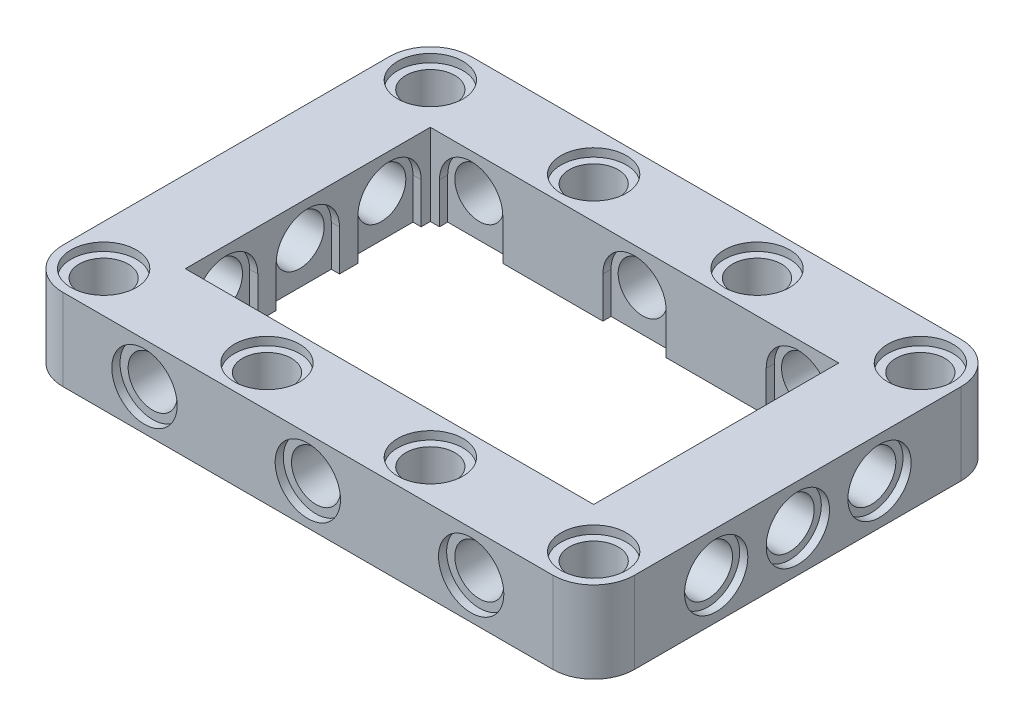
ISO-10303-21;
HEADER;
FILE_DESCRIPTION(('STEP AP214'),'2;1');
FILE_NAME('part.step','',(''),(''),'','','');
FILE_SCHEMA(('AUTOMOTIVE_DESIGN { 1 0 10303 214 1 1 1 1 }'));
ENDSEC;
DATA;
#1=APPLICATION_CONTEXT('core data for automotive mechanical design processes');
#2=APPLICATION_PROTOCOL_DEFINITION('international standard','automotive_design',2000,#1);
#3=PRODUCT_CONTEXT('',#1,'mechanical');
#4=PRODUCT('Part','Part','',(#3));
#5=PRODUCT_RELATED_PRODUCT_CATEGORY('part','',(#4));
#6=PRODUCT_DEFINITION_FORMATION('','',#4);
#7=PRODUCT_DEFINITION_CONTEXT('part definition',#1,'design');
#8=PRODUCT_DEFINITION('design','',#6,#7);
#9=PRODUCT_DEFINITION_SHAPE('','',#8);
#10=(LENGTH_UNIT() NAMED_UNIT(*) SI_UNIT(.MILLI.,.METRE.));
#11=(NAMED_UNIT(*) PLANE_ANGLE_UNIT() SI_UNIT($,.RADIAN.));
#12=(NAMED_UNIT(*) SI_UNIT($,.STERADIAN.) SOLID_ANGLE_UNIT());
#13=UNCERTAINTY_MEASURE_WITH_UNIT(LENGTH_MEASURE(1.E-05),#10,'distance_accuracy_value','');
#14=(GEOMETRIC_REPRESENTATION_CONTEXT(3) GLOBAL_UNCERTAINTY_ASSIGNED_CONTEXT((#13)) GLOBAL_UNIT_ASSIGNED_CONTEXT((#10,
#11,#12)) REPRESENTATION_CONTEXT('',''));
#15=CARTESIAN_POINT('',(0.,0.,0.));
#16=DIRECTION('',(0.,0.,1.));
#17=DIRECTION('',(1.,0.,0.));
#18=AXIS2_PLACEMENT_3D('',#15,#16,#17);
#19=CARTESIAN_POINT('',(0.,0.,0.));
#20=DIRECTION('',(0.,1.,0.));
#21=DIRECTION('',(0.,0.,1.));
#22=AXIS2_PLACEMENT_3D('',#19,#20,#21);
#23=PLANE('',#22);
#24=CARTESIAN_POINT('',(16.,0.,0.));
#25=DIRECTION('',(0.,1.,0.));
#26=DIRECTION('',(0.,0.,1.));
#27=AXIS2_PLACEMENT_3D('',#24,#25,#26);
#28=CIRCLE('',#27,3.2);
#29=CARTESIAN_POINT('',(16.,0.,3.2));
#30=VERTEX_POINT('',#29);
#31=EDGE_CURVE('E2007',#30,#30,#28,.T.);
#32=ORIENTED_EDGE('',*,*,#31,.T.);
#33=EDGE_LOOP('',(#32));
#34=FACE_BOUND('',#33,.T.);
#35=CARTESIAN_POINT('',(0.,0.,-32.));
#36=DIRECTION('',(0.,1.,0.));
#37=DIRECTION('',(0.,0.,1.));
#38=AXIS2_PLACEMENT_3D('',#35,#36,#37);
#39=CIRCLE('',#38,3.2);
#40=CARTESIAN_POINT('',(0.,0.,-28.8));
#41=VERTEX_POINT('',#40);
#42=EDGE_CURVE('E1666',#41,#41,#39,.T.);
#43=ORIENTED_EDGE('',*,*,#42,.T.);
#44=EDGE_LOOP('',(#43));
#45=FACE_BOUND('',#44,.T.);
#46=CARTESIAN_POINT('',(32.,0.,0.));
#47=DIRECTION('',(0.,1.,0.));
#48=DIRECTION('',(0.,0.,1.));
#49=AXIS2_PLACEMENT_3D('',#46,#47,#48);
#50=CIRCLE('',#49,3.2);
#51=CARTESIAN_POINT('',(32.,0.,3.19999999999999));
#52=VERTEX_POINT('',#51);
#53=EDGE_CURVE('E2024',#52,#52,#50,.T.);
#54=ORIENTED_EDGE('',*,*,#53,.T.);
#55=EDGE_LOOP('',(#54));
#56=FACE_BOUND('',#55,.T.);
#57=CARTESIAN_POINT('',(48.,0.,-32.));
#58=DIRECTION('',(0.,1.,0.));
#59=DIRECTION('',(0.,0.,1.));
#60=AXIS2_PLACEMENT_3D('',#57,#58,#59);
#61=CIRCLE('',#60,3.2);
#62=CARTESIAN_POINT('',(48.,0.,-28.8));
#63=VERTEX_POINT('',#62);
#64=EDGE_CURVE('E451',#63,#63,#61,.T.);
#65=ORIENTED_EDGE('',*,*,#64,.T.);
#66=EDGE_LOOP('',(#65));
#67=FACE_BOUND('',#66,.T.);
#68=CARTESIAN_POINT('',(0.,0.,0.));
#69=DIRECTION('',(0.,1.,0.));
#70=DIRECTION('',(0.,0.,1.));
#71=AXIS2_PLACEMENT_3D('',#68,#69,#70);
#72=CIRCLE('',#71,4.);
#73=CARTESIAN_POINT('',(-4.,0.,0.));
#74=VERTEX_POINT('',#73);
#75=CARTESIAN_POINT('',(0.,0.,4.));
#76=VERTEX_POINT('',#75);
#77=EDGE_CURVE('E899',#74,#76,#72,.T.);
#78=ORIENTED_EDGE('',*,*,#77,.F.);
#79=DIRECTION('',(0.,0.,1.));
#80=VECTOR('',#79,1.);
#81=CARTESIAN_POINT('',(-4.,0.,0.));
#82=LINE('',#81,#80);
#83=CARTESIAN_POINT('',(-4.,0.,-32.));
#84=VERTEX_POINT('',#83);
#85=EDGE_CURVE('E947',#84,#74,#82,.T.);
#86=ORIENTED_EDGE('',*,*,#85,.F.);
#87=CARTESIAN_POINT('',(0.,0.,-32.));
#88=DIRECTION('',(0.,1.,0.));
#89=DIRECTION('',(0.,0.,1.));
#90=AXIS2_PLACEMENT_3D('',#87,#88,#89);
#91=CIRCLE('',#90,4.);
#92=CARTESIAN_POINT('',(0.,0.,-36.));
#93=VERTEX_POINT('',#92);
#94=EDGE_CURVE('E945',#93,#84,#91,.T.);
#95=ORIENTED_EDGE('',*,*,#94,.F.);
#96=DIRECTION('',(-1.,0.,0.));
#97=VECTOR('',#96,1.);
#98=CARTESIAN_POINT('',(0.,0.,-36.));
#99=LINE('',#98,#97);
#100=CARTESIAN_POINT('',(48.,0.,-36.));
#101=VERTEX_POINT('',#100);
#102=EDGE_CURVE('E943',#101,#93,#99,.T.);
#103=ORIENTED_EDGE('',*,*,#102,.F.);
#104=CARTESIAN_POINT('',(48.,0.,-32.));
#105=DIRECTION('',(0.,1.,0.));
#106=DIRECTION('',(0.,0.,1.));
#107=AXIS2_PLACEMENT_3D('',#104,#105,#106);
#108=CIRCLE('',#107,4.);
#109=CARTESIAN_POINT('',(52.,0.,-32.));
#110=VERTEX_POINT('',#109);
#111=EDGE_CURVE('E941',#110,#101,#108,.T.);
#112=ORIENTED_EDGE('',*,*,#111,.F.);
#113=DIRECTION('',(0.,0.,-1.));
#114=VECTOR('',#113,1.);
#115=CARTESIAN_POINT('',(52.,0.,0.));
#116=LINE('',#115,#114);
#117=CARTESIAN_POINT('',(52.,0.,0.));
#118=VERTEX_POINT('',#117);
#119=EDGE_CURVE('E939',#118,#110,#116,.T.);
#120=ORIENTED_EDGE('',*,*,#119,.F.);
#121=CARTESIAN_POINT('',(48.,0.,0.));
#122=DIRECTION('',(0.,1.,0.));
#123=DIRECTION('',(0.,0.,1.));
#124=AXIS2_PLACEMENT_3D('',#121,#122,#123);
#125=CIRCLE('',#124,4.);
#126=CARTESIAN_POINT('',(48.,0.,3.99999999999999));
#127=VERTEX_POINT('',#126);
#128=EDGE_CURVE('E937',#127,#118,#125,.T.);
#129=ORIENTED_EDGE('',*,*,#128,.F.);
#130=DIRECTION('',(1.,0.,0.));
#131=VECTOR('',#130,1.);
#132=CARTESIAN_POINT('',(0.,0.,4.));
#133=LINE('',#132,#131);
#134=EDGE_CURVE('E935',#76,#127,#133,.T.);
#135=ORIENTED_EDGE('',*,*,#134,.F.);
#136=EDGE_LOOP('',(#78,#86,#95,#103,#112,#120,#129,#135));
#137=FACE_BOUND('',#136,.T.);
#138=DIRECTION('',(0.,0.,1.));
#139=VECTOR('',#138,1.);
#140=CARTESIAN_POINT('',(11.1,0.,0.));
#141=LINE('',#140,#139);
#142=CARTESIAN_POINT('',(11.1,0.,-28.8));
#143=VERTEX_POINT('',#142);
#144=CARTESIAN_POINT('',(11.1,0.,-28.));
#145=VERTEX_POINT('',#144);
#146=EDGE_CURVE('E503',#143,#145,#141,.T.);
#147=ORIENTED_EDGE('',*,*,#146,.F.);
#148=DIRECTION('',(1.,0.,0.));
#149=VECTOR('',#148,1.);
#150=CARTESIAN_POINT('',(0.,0.,-28.8));
#151=LINE('',#150,#149);
#152=CARTESIAN_POINT('',(4.9,0.,-28.8));
#153=VERTEX_POINT('',#152);
#154=EDGE_CURVE('E11',#153,#143,#151,.T.);
#155=ORIENTED_EDGE('',*,*,#154,.F.);
#156=DIRECTION('',(0.,0.,-1.));
#157=VECTOR('',#156,1.);
#158=CARTESIAN_POINT('',(4.9,0.,0.));
#159=LINE('',#158,#157);
#160=CARTESIAN_POINT('',(4.9,0.,-28.));
#161=VERTEX_POINT('',#160);
#162=EDGE_CURVE('E431',#161,#153,#159,.T.);
#163=ORIENTED_EDGE('',*,*,#162,.F.);
#164=DIRECTION('',(-1.,0.,0.));
#165=VECTOR('',#164,1.);
#166=CARTESIAN_POINT('',(0.,0.,-28.));
#167=LINE('',#166,#165);
#168=CARTESIAN_POINT('',(4.,0.,-28.));
#169=VERTEX_POINT('',#168);
#170=EDGE_CURVE('E963',#161,#169,#167,.T.);
#171=ORIENTED_EDGE('',*,*,#170,.T.);
#172=DIRECTION('',(0.,0.,1.));
#173=VECTOR('',#172,1.);
#174=CARTESIAN_POINT('',(4.,0.,0.));
#175=LINE('',#174,#173);
#176=CARTESIAN_POINT('',(3.99999999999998,0.,-27.1));
#177=VERTEX_POINT('',#176);
#178=EDGE_CURVE('E960',#169,#177,#175,.T.);
#179=ORIENTED_EDGE('',*,*,#178,.T.);
#180=DIRECTION('',(1.,0.,0.));
#181=VECTOR('',#180,1.);
#182=CARTESIAN_POINT('',(0.,0.,-27.1));
#183=LINE('',#182,#181);
#184=CARTESIAN_POINT('',(3.19999999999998,0.,-27.1));
#185=VERTEX_POINT('',#184);
#186=EDGE_CURVE('E1065',#185,#177,#183,.T.);
#187=ORIENTED_EDGE('',*,*,#186,.F.);
#188=DIRECTION('',(0.,0.,-1.));
#189=VECTOR('',#188,1.);
#190=CARTESIAN_POINT('',(3.2,0.,0.));
#191=LINE('',#190,#189);
#192=CARTESIAN_POINT('',(3.19999999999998,0.,-20.9));
#193=VERTEX_POINT('',#192);
#194=EDGE_CURVE('E1060',#193,#185,#191,.T.);
#195=ORIENTED_EDGE('',*,*,#194,.F.);
#196=DIRECTION('',(-1.,0.,0.));
#197=VECTOR('',#196,1.);
#198=CARTESIAN_POINT('',(0.,0.,-20.9));
#199=LINE('',#198,#197);
#200=CARTESIAN_POINT('',(3.99999999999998,0.,-20.9));
#201=VERTEX_POINT('',#200);
#202=EDGE_CURVE('E1062',#201,#193,#199,.T.);
#203=ORIENTED_EDGE('',*,*,#202,.F.);
#204=CARTESIAN_POINT('',(3.99999999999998,0.,-19.1));
#205=VERTEX_POINT('',#204);
#206=EDGE_CURVE('E964',#201,#205,#175,.T.);
#207=ORIENTED_EDGE('',*,*,#206,.T.);
#208=DIRECTION('',(1.,0.,0.));
#209=VECTOR('',#208,1.);
#210=CARTESIAN_POINT('',(0.,0.,-19.1));
#211=LINE('',#210,#209);
#212=CARTESIAN_POINT('',(3.19999999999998,0.,-19.1));
#213=VERTEX_POINT('',#212);
#214=EDGE_CURVE('E1072',#213,#205,#211,.T.);
#215=ORIENTED_EDGE('',*,*,#214,.F.);
#216=DIRECTION('',(0.,0.,-1.));
#217=VECTOR('',#216,1.);
#218=CARTESIAN_POINT('',(3.2,0.,0.));
#219=LINE('',#218,#217);
#220=CARTESIAN_POINT('',(3.19999999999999,0.,-12.9));
#221=VERTEX_POINT('',#220);
#222=EDGE_CURVE('E1067',#221,#213,#219,.T.);
#223=ORIENTED_EDGE('',*,*,#222,.F.);
#224=DIRECTION('',(-1.,0.,0.));
#225=VECTOR('',#224,1.);
#226=CARTESIAN_POINT('',(0.,0.,-12.9));
#227=LINE('',#226,#225);
#228=CARTESIAN_POINT('',(3.99999999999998,0.,-12.9));
#229=VERTEX_POINT('',#228);
#230=EDGE_CURVE('E1069',#229,#221,#227,.T.);
#231=ORIENTED_EDGE('',*,*,#230,.F.);
#232=CARTESIAN_POINT('',(3.99999999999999,0.,-11.1));
#233=VERTEX_POINT('',#232);
#234=EDGE_CURVE('E965',#229,#233,#175,.T.);
#235=ORIENTED_EDGE('',*,*,#234,.T.);
#236=DIRECTION('',(1.,0.,0.));
#237=VECTOR('',#236,1.);
#238=CARTESIAN_POINT('',(0.,0.,-11.1));
#239=LINE('',#238,#237);
#240=CARTESIAN_POINT('',(3.19999999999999,0.,-11.1));
#241=VERTEX_POINT('',#240);
#242=EDGE_CURVE('E1057',#241,#233,#239,.T.);
#243=ORIENTED_EDGE('',*,*,#242,.F.);
#244=DIRECTION('',(0.,0.,-1.));
#245=VECTOR('',#244,1.);
#246=CARTESIAN_POINT('',(3.2,0.,0.));
#247=LINE('',#246,#245);
#248=CARTESIAN_POINT('',(3.19999999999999,0.,-4.89999999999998));
#249=VERTEX_POINT('',#248);
#250=EDGE_CURVE('E1052',#249,#241,#247,.T.);
#251=ORIENTED_EDGE('',*,*,#250,.F.);
#252=DIRECTION('',(-1.,0.,0.));
#253=VECTOR('',#252,1.);
#254=CARTESIAN_POINT('',(0.,0.,-4.89999999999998));
#255=LINE('',#254,#253);
#256=CARTESIAN_POINT('',(3.99999999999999,0.,-4.89999999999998));
#257=VERTEX_POINT('',#256);
#258=EDGE_CURVE('E1054',#257,#249,#255,.T.);
#259=ORIENTED_EDGE('',*,*,#258,.F.);
#260=CARTESIAN_POINT('',(4.,0.,-4.));
#261=VERTEX_POINT('',#260);
#262=EDGE_CURVE('E958',#257,#261,#175,.T.);
#263=ORIENTED_EDGE('',*,*,#262,.T.);
#264=DIRECTION('',(1.,0.,0.));
#265=VECTOR('',#264,1.);
#266=CARTESIAN_POINT('',(0.,0.,-4.));
#267=LINE('',#266,#265);
#268=CARTESIAN_POINT('',(4.9,0.,-4.));
#269=VERTEX_POINT('',#268);
#270=EDGE_CURVE('E955',#261,#269,#267,.T.);
#271=ORIENTED_EDGE('',*,*,#270,.T.);
#272=DIRECTION('',(0.,0.,1.));
#273=VECTOR('',#272,1.);
#274=CARTESIAN_POINT('',(4.9,0.,0.));
#275=LINE('',#274,#273);
#276=CARTESIAN_POINT('',(4.9,0.,-3.2));
#277=VERTEX_POINT('',#276);
#278=EDGE_CURVE('E1017',#269,#277,#275,.T.);
#279=ORIENTED_EDGE('',*,*,#278,.T.);
#280=DIRECTION('',(-1.,0.,0.));
#281=VECTOR('',#280,1.);
#282=CARTESIAN_POINT('',(0.,0.,-3.2));
#283=LINE('',#282,#281);
#284=CARTESIAN_POINT('',(11.1,0.,-3.2));
#285=VERTEX_POINT('',#284);
#286=EDGE_CURVE('E1012',#285,#277,#283,.T.);
#287=ORIENTED_EDGE('',*,*,#286,.F.);
#288=DIRECTION('',(0.,0.,-1.));
#289=VECTOR('',#288,1.);
#290=CARTESIAN_POINT('',(11.1,0.,0.));
#291=LINE('',#290,#289);
#292=CARTESIAN_POINT('',(11.1,0.,-4.));
#293=VERTEX_POINT('',#292);
#294=EDGE_CURVE('E1014',#285,#293,#291,.T.);
#295=ORIENTED_EDGE('',*,*,#294,.T.);
#296=CARTESIAN_POINT('',(20.9,0.,-4.));
#297=VERTEX_POINT('',#296);
#298=EDGE_CURVE('E959',#293,#297,#267,.T.);
#299=ORIENTED_EDGE('',*,*,#298,.T.);
#300=DIRECTION('',(0.,0.,1.));
#301=VECTOR('',#300,1.);
#302=CARTESIAN_POINT('',(20.9,0.,0.));
#303=LINE('',#302,#301);
#304=CARTESIAN_POINT('',(20.9,0.,-3.2));
#305=VERTEX_POINT('',#304);
#306=EDGE_CURVE('E1033',#297,#305,#303,.T.);
#307=ORIENTED_EDGE('',*,*,#306,.T.);
#308=DIRECTION('',(-1.,0.,0.));
#309=VECTOR('',#308,1.);
#310=CARTESIAN_POINT('',(0.,0.,-3.2));
#311=LINE('',#310,#309);
#312=CARTESIAN_POINT('',(27.1,0.,-3.2));
#313=VERTEX_POINT('',#312);
#314=EDGE_CURVE('E1028',#313,#305,#311,.T.);
#315=ORIENTED_EDGE('',*,*,#314,.F.);
#316=DIRECTION('',(0.,0.,-1.));
#317=VECTOR('',#316,1.);
#318=CARTESIAN_POINT('',(27.1,0.,0.));
#319=LINE('',#318,#317);
#320=CARTESIAN_POINT('',(27.1,0.,-4.));
#321=VERTEX_POINT('',#320);
#322=EDGE_CURVE('E1030',#313,#321,#319,.T.);
#323=ORIENTED_EDGE('',*,*,#322,.T.);
#324=CARTESIAN_POINT('',(36.9,0.,-4.));
#325=VERTEX_POINT('',#324);
#326=EDGE_CURVE('E1158',#321,#325,#267,.T.);
#327=ORIENTED_EDGE('',*,*,#326,.T.);
#328=DIRECTION('',(0.,0.,1.));
#329=VECTOR('',#328,1.);
#330=CARTESIAN_POINT('',(36.9,0.,0.));
#331=LINE('',#330,#329);
#332=CARTESIAN_POINT('',(36.9,0.,-3.2));
#333=VERTEX_POINT('',#332);
#334=EDGE_CURVE('E1025',#325,#333,#331,.T.);
#335=ORIENTED_EDGE('',*,*,#334,.T.);
#336=DIRECTION('',(-1.,0.,0.));
#337=VECTOR('',#336,1.);
#338=CARTESIAN_POINT('',(0.,0.,-3.2));
#339=LINE('',#338,#337);
#340=CARTESIAN_POINT('',(43.1,0.,-3.2));
#341=VERTEX_POINT('',#340);
#342=EDGE_CURVE('E1020',#341,#333,#339,.T.);
#343=ORIENTED_EDGE('',*,*,#342,.F.);
#344=DIRECTION('',(0.,0.,-1.));
#345=VECTOR('',#344,1.);
#346=CARTESIAN_POINT('',(43.1,0.,0.));
#347=LINE('',#346,#345);
#348=CARTESIAN_POINT('',(43.1,0.,-4.));
#349=VERTEX_POINT('',#348);
#350=EDGE_CURVE('E1022',#341,#349,#347,.T.);
#351=ORIENTED_EDGE('',*,*,#350,.T.);
#352=CARTESIAN_POINT('',(44.,0.,-4.));
#353=VERTEX_POINT('',#352);
#354=EDGE_CURVE('E953',#349,#353,#267,.T.);
#355=ORIENTED_EDGE('',*,*,#354,.T.);
#356=DIRECTION('',(0.,0.,-1.));
#357=VECTOR('',#356,1.);
#358=CARTESIAN_POINT('',(44.,0.,0.));
#359=LINE('',#358,#357);
#360=CARTESIAN_POINT('',(44.,0.,-4.9));
#361=VERTEX_POINT('',#360);
#362=EDGE_CURVE('E950',#353,#361,#359,.T.);
#363=ORIENTED_EDGE('',*,*,#362,.T.);
#364=DIRECTION('',(1.,0.,0.));
#365=VECTOR('',#364,1.);
#366=CARTESIAN_POINT('',(0.,0.,-4.9));
#367=LINE('',#366,#365);
#368=CARTESIAN_POINT('',(44.8,0.,-4.9));
#369=VERTEX_POINT('',#368);
#370=EDGE_CURVE('E1009',#361,#369,#367,.T.);
#371=ORIENTED_EDGE('',*,*,#370,.T.);
#372=DIRECTION('',(0.,0.,1.));
#373=VECTOR('',#372,1.);
#374=CARTESIAN_POINT('',(44.8,0.,0.));
#375=LINE('',#374,#373);
#376=CARTESIAN_POINT('',(44.8,0.,-11.1));
#377=VERTEX_POINT('',#376);
#378=EDGE_CURVE('E982',#377,#369,#375,.T.);
#379=ORIENTED_EDGE('',*,*,#378,.F.);
#380=DIRECTION('',(-1.,0.,0.));
#381=VECTOR('',#380,1.);
#382=CARTESIAN_POINT('',(0.,0.,-11.1));
#383=LINE('',#382,#381);
#384=CARTESIAN_POINT('',(44.,0.,-11.1));
#385=VERTEX_POINT('',#384);
#386=EDGE_CURVE('E1006',#377,#385,#383,.T.);
#387=ORIENTED_EDGE('',*,*,#386,.T.);
#388=CARTESIAN_POINT('',(44.,0.,-12.9));
#389=VERTEX_POINT('',#388);
#390=EDGE_CURVE('E954',#385,#389,#359,.T.);
#391=ORIENTED_EDGE('',*,*,#390,.T.);
#392=DIRECTION('',(1.,0.,0.));
#393=VECTOR('',#392,1.);
#394=CARTESIAN_POINT('',(0.,0.,-12.9));
#395=LINE('',#394,#393);
#396=CARTESIAN_POINT('',(44.8,0.,-12.9));
#397=VERTEX_POINT('',#396);
#398=EDGE_CURVE('E1049',#389,#397,#395,.T.);
#399=ORIENTED_EDGE('',*,*,#398,.T.);
#400=DIRECTION('',(0.,0.,1.));
#401=VECTOR('',#400,1.);
#402=CARTESIAN_POINT('',(44.8,0.,0.));
#403=LINE('',#402,#401);
#404=CARTESIAN_POINT('',(44.8,0.,-19.1));
#405=VERTEX_POINT('',#404);
#406=EDGE_CURVE('E1044',#405,#397,#403,.T.);
#407=ORIENTED_EDGE('',*,*,#406,.F.);
#408=DIRECTION('',(-1.,0.,0.));
#409=VECTOR('',#408,1.);
#410=CARTESIAN_POINT('',(0.,0.,-19.1));
#411=LINE('',#410,#409);
#412=CARTESIAN_POINT('',(44.,0.,-19.1));
#413=VERTEX_POINT('',#412);
#414=EDGE_CURVE('E1046',#405,#413,#411,.T.);
#415=ORIENTED_EDGE('',*,*,#414,.T.);
#416=CARTESIAN_POINT('',(44.,0.,-20.9));
#417=VERTEX_POINT('',#416);
#418=EDGE_CURVE('E1190',#413,#417,#359,.T.);
#419=ORIENTED_EDGE('',*,*,#418,.T.);
#420=DIRECTION('',(1.,0.,0.));
#421=VECTOR('',#420,1.);
#422=CARTESIAN_POINT('',(0.,0.,-20.9));
#423=LINE('',#422,#421);
#424=CARTESIAN_POINT('',(44.8,0.,-20.9));
#425=VERTEX_POINT('',#424);
#426=EDGE_CURVE('E1041',#417,#425,#423,.T.);
#427=ORIENTED_EDGE('',*,*,#426,.T.);
#428=DIRECTION('',(0.,0.,1.));
#429=VECTOR('',#428,1.);
#430=CARTESIAN_POINT('',(44.8,0.,0.));
#431=LINE('',#430,#429);
#432=CARTESIAN_POINT('',(44.8,0.,-27.1));
#433=VERTEX_POINT('',#432);
#434=EDGE_CURVE('E1036',#433,#425,#431,.T.);
#435=ORIENTED_EDGE('',*,*,#434,.F.);
#436=DIRECTION('',(-1.,0.,0.));
#437=VECTOR('',#436,1.);
#438=CARTESIAN_POINT('',(0.,0.,-27.1));
#439=LINE('',#438,#437);
#440=CARTESIAN_POINT('',(44.,0.,-27.1));
#441=VERTEX_POINT('',#440);
#442=EDGE_CURVE('E1038',#433,#441,#439,.T.);
#443=ORIENTED_EDGE('',*,*,#442,.T.);
#444=CARTESIAN_POINT('',(44.,0.,-28.));
#445=VERTEX_POINT('',#444);
#446=EDGE_CURVE('E949',#441,#445,#359,.T.);
#447=ORIENTED_EDGE('',*,*,#446,.T.);
#448=CARTESIAN_POINT('',(43.1,0.,-28.));
#449=VERTEX_POINT('',#448);
#450=EDGE_CURVE('E906',#445,#449,#167,.T.);
#451=ORIENTED_EDGE('',*,*,#450,.T.);
#452=DIRECTION('',(0.,0.,1.));
#453=VECTOR('',#452,1.);
#454=CARTESIAN_POINT('',(43.1,0.,0.));
#455=LINE('',#454,#453);
#456=CARTESIAN_POINT('',(43.1,0.,-28.8));
#457=VERTEX_POINT('',#456);
#458=EDGE_CURVE('E496',#457,#449,#455,.T.);
#459=ORIENTED_EDGE('',*,*,#458,.F.);
#460=DIRECTION('',(1.,0.,0.));
#461=VECTOR('',#460,1.);
#462=CARTESIAN_POINT('',(0.,0.,-28.8));
#463=LINE('',#462,#461);
#464=CARTESIAN_POINT('',(36.9,0.,-28.8));
#465=VERTEX_POINT('',#464);
#466=EDGE_CURVE('E1082',#465,#457,#463,.T.);
#467=ORIENTED_EDGE('',*,*,#466,.F.);
#468=DIRECTION('',(0.,0.,-1.));
#469=VECTOR('',#468,1.);
#470=CARTESIAN_POINT('',(36.9,0.,0.));
#471=LINE('',#470,#469);
#472=CARTESIAN_POINT('',(36.9,0.,-28.));
#473=VERTEX_POINT('',#472);
#474=EDGE_CURVE('E457',#473,#465,#471,.T.);
#475=ORIENTED_EDGE('',*,*,#474,.F.);
#476=CARTESIAN_POINT('',(27.1,0.,-28.));
#477=VERTEX_POINT('',#476);
#478=EDGE_CURVE('E968',#473,#477,#167,.T.);
#479=ORIENTED_EDGE('',*,*,#478,.T.);
#480=DIRECTION('',(0.,0.,1.));
#481=VECTOR('',#480,1.);
#482=CARTESIAN_POINT('',(27.1,0.,0.));
#483=LINE('',#482,#481);
#484=CARTESIAN_POINT('',(27.1,0.,-28.8));
#485=VERTEX_POINT('',#484);
#486=EDGE_CURVE('E500',#485,#477,#483,.T.);
#487=ORIENTED_EDGE('',*,*,#486,.F.);
#488=DIRECTION('',(1.,0.,0.));
#489=VECTOR('',#488,1.);
#490=CARTESIAN_POINT('',(0.,0.,-28.8));
#491=LINE('',#490,#489);
#492=CARTESIAN_POINT('',(20.9,0.,-28.8));
#493=VERTEX_POINT('',#492);
#494=EDGE_CURVE('E55',#493,#485,#491,.T.);
#495=ORIENTED_EDGE('',*,*,#494,.F.);
#496=DIRECTION('',(0.,0.,-1.));
#497=VECTOR('',#496,1.);
#498=CARTESIAN_POINT('',(20.9,0.,0.));
#499=LINE('',#498,#497);
#500=CARTESIAN_POINT('',(20.9,0.,-28.));
#501=VERTEX_POINT('',#500);
#502=EDGE_CURVE('E498',#501,#493,#499,.T.);
#503=ORIENTED_EDGE('',*,*,#502,.F.);
#504=EDGE_CURVE('E1102',#501,#145,#167,.T.);
#505=ORIENTED_EDGE('',*,*,#504,.T.);
#506=EDGE_LOOP('',(#147,#155,#163,#171,#179,#187,#195,#203,#207,#215,#223,#231,#235,#243,#251,
#259,#263,#271,#279,#287,#295,#299,#307,#315,#323,#327,#335,#343,#351,#355,#363,#371,#379,#387,
#391,#399,#407,#415,#419,#427,#435,#443,#447,#451,#459,#467,#475,#479,#487,#495,#503,#505));
#507=FACE_BOUND('',#506,.T.);
#508=CARTESIAN_POINT('',(32.,0.,-32.));
#509=DIRECTION('',(0.,1.,0.));
#510=DIRECTION('',(0.,0.,1.));
#511=AXIS2_PLACEMENT_3D('',#508,#509,#510);
#512=CIRCLE('',#511,3.2);
#513=CARTESIAN_POINT('',(32.,0.,-28.8));
#514=VERTEX_POINT('',#513);
#515=EDGE_CURVE('E2015',#514,#514,#512,.T.);
#516=ORIENTED_EDGE('',*,*,#515,.T.);
#517=EDGE_LOOP('',(#516));
#518=FACE_BOUND('',#517,.T.);
#519=CARTESIAN_POINT('',(0.,0.,0.));
#520=DIRECTION('',(0.,1.,0.));
#521=DIRECTION('',(0.,0.,1.));
#522=AXIS2_PLACEMENT_3D('',#519,#520,#521);
#523=CIRCLE('',#522,3.2);
#524=CARTESIAN_POINT('',(0.,0.,3.2));
#525=VERTEX_POINT('',#524);
#526=EDGE_CURVE('E1673',#525,#525,#523,.T.);
#527=ORIENTED_EDGE('',*,*,#526,.T.);
#528=EDGE_LOOP('',(#527));
#529=FACE_BOUND('',#528,.T.);
#530=CARTESIAN_POINT('',(48.,0.,0.));
#531=DIRECTION('',(0.,1.,0.));
#532=DIRECTION('',(0.,0.,1.));
#533=AXIS2_PLACEMENT_3D('',#530,#531,#532);
#534=CIRCLE('',#533,3.2);
#535=CARTESIAN_POINT('',(48.,0.,3.2));
#536=VERTEX_POINT('',#535);
#537=EDGE_CURVE('E1677',#536,#536,#534,.T.);
#538=ORIENTED_EDGE('',*,*,#537,.T.);
#539=EDGE_LOOP('',(#538));
#540=FACE_BOUND('',#539,.T.);
#541=CARTESIAN_POINT('',(16.,0.,-32.));
#542=DIRECTION('',(0.,1.,0.));
#543=DIRECTION('',(0.,0.,1.));
#544=AXIS2_PLACEMENT_3D('',#541,#542,#543);
#545=CIRCLE('',#544,3.2);
#546=CARTESIAN_POINT('',(16.,0.,-28.8));
#547=VERTEX_POINT('',#546);
#548=EDGE_CURVE('E1976',#547,#547,#545,.T.);
#549=ORIENTED_EDGE('',*,*,#548,.T.);
#550=EDGE_LOOP('',(#549));
#551=FACE_BOUND('',#550,.T.);
#552=ADVANCED_FACE('F47',(#34,#45,#56,#67,#137,#507,#518,#529,#540,#551),#23,.F.);
#553=CARTESIAN_POINT('',(16.,0.,-32.));
#554=DIRECTION('',(0.,1.,0.));
#555=DIRECTION('',(0.,0.,1.));
#556=AXIS2_PLACEMENT_3D('',#553,#554,#555);
#557=CYLINDRICAL_SURFACE('',#556,2.4);
#558=CARTESIAN_POINT('',(16.,7.2,-32.));
#559=DIRECTION('',(0.,1.,0.));
#560=DIRECTION('',(0.,0.,1.));
#561=AXIS2_PLACEMENT_3D('',#558,#559,#560);
#562=CIRCLE('',#561,2.4);
#563=CARTESIAN_POINT('',(16.,7.2,-29.6));
#564=VERTEX_POINT('',#563);
#565=EDGE_CURVE('E845',#564,#564,#562,.T.);
#566=ORIENTED_EDGE('',*,*,#565,.T.);
#567=EDGE_LOOP('',(#566));
#568=FACE_BOUND('',#567,.T.);
#569=CARTESIAN_POINT('',(16.,0.8,-32.));
#570=DIRECTION('',(0.,1.,0.));
#571=DIRECTION('',(0.,0.,1.));
#572=AXIS2_PLACEMENT_3D('',#569,#570,#571);
#573=CIRCLE('',#572,2.4);
#574=CARTESIAN_POINT('',(16.,0.8,-29.6));
#575=VERTEX_POINT('',#574);
#576=EDGE_CURVE('E1978',#575,#575,#573,.T.);
#577=ORIENTED_EDGE('',*,*,#576,.F.);
#578=EDGE_LOOP('',(#577));
#579=FACE_BOUND('',#578,.T.);
#580=ADVANCED_FACE('F1221',(#568,#579),#557,.F.);
#581=CARTESIAN_POINT('',(32.,0.,0.));
#582=DIRECTION('',(0.,1.,0.));
#583=DIRECTION('',(0.,0.,1.));
#584=AXIS2_PLACEMENT_3D('',#581,#582,#583);
#585=CYLINDRICAL_SURFACE('',#584,2.4);
#586=CARTESIAN_POINT('',(32.,7.2,0.));
#587=DIRECTION('',(0.,1.,0.));
#588=DIRECTION('',(0.,0.,1.));
#589=AXIS2_PLACEMENT_3D('',#586,#587,#588);
#590=CIRCLE('',#589,2.4);
#591=CARTESIAN_POINT('',(32.,7.2,2.39999999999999));
#592=VERTEX_POINT('',#591);
#593=EDGE_CURVE('E818',#592,#592,#590,.T.);
#594=ORIENTED_EDGE('',*,*,#593,.T.);
#595=EDGE_LOOP('',(#594));
#596=FACE_BOUND('',#595,.T.);
#597=CARTESIAN_POINT('',(32.,0.8,0.));
#598=DIRECTION('',(0.,1.,0.));
#599=DIRECTION('',(0.,0.,1.));
#600=AXIS2_PLACEMENT_3D('',#597,#598,#599);
#601=CIRCLE('',#600,2.4);
#602=CARTESIAN_POINT('',(32.,0.8,2.39999999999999));
#603=VERTEX_POINT('',#602);
#604=EDGE_CURVE('E2027',#603,#603,#601,.T.);
#605=ORIENTED_EDGE('',*,*,#604,.F.);
#606=EDGE_LOOP('',(#605));
#607=FACE_BOUND('',#606,.T.);
#608=ADVANCED_FACE('F1228',(#596,#607),#585,.F.);
#609=CARTESIAN_POINT('',(16.,0.,0.));
#610=DIRECTION('',(0.,1.,0.));
#611=DIRECTION('',(0.,0.,1.));
#612=AXIS2_PLACEMENT_3D('',#609,#610,#611);
#613=CYLINDRICAL_SURFACE('',#612,2.4);
#614=CARTESIAN_POINT('',(16.,7.2,0.));
#615=DIRECTION('',(0.,1.,0.));
#616=DIRECTION('',(0.,0.,1.));
#617=AXIS2_PLACEMENT_3D('',#614,#615,#616);
#618=CIRCLE('',#617,2.4);
#619=CARTESIAN_POINT('',(16.,7.2,2.4));
#620=VERTEX_POINT('',#619);
#621=EDGE_CURVE('E836',#620,#620,#618,.T.);
#622=ORIENTED_EDGE('',*,*,#621,.T.);
#623=EDGE_LOOP('',(#622));
#624=FACE_BOUND('',#623,.T.);
#625=CARTESIAN_POINT('',(16.,0.8,0.));
#626=DIRECTION('',(0.,1.,0.));
#627=DIRECTION('',(0.,0.,1.));
#628=AXIS2_PLACEMENT_3D('',#625,#626,#627);
#629=CIRCLE('',#628,2.4);
#630=CARTESIAN_POINT('',(16.,0.8,2.4));
#631=VERTEX_POINT('',#630);
#632=EDGE_CURVE('E2009',#631,#631,#629,.T.);
#633=ORIENTED_EDGE('',*,*,#632,.F.);
#634=EDGE_LOOP('',(#633));
#635=FACE_BOUND('',#634,.T.);
#636=ADVANCED_FACE('F1594',(#624,#635),#613,.F.);
#637=CARTESIAN_POINT('',(32.,0.,-32.));
#638=DIRECTION('',(0.,1.,0.));
#639=DIRECTION('',(0.,0.,1.));
#640=AXIS2_PLACEMENT_3D('',#637,#638,#639);
#641=CYLINDRICAL_SURFACE('',#640,2.4);
#642=CARTESIAN_POINT('',(32.,7.2,-32.));
#643=DIRECTION('',(0.,1.,0.));
#644=DIRECTION('',(0.,0.,1.));
#645=AXIS2_PLACEMENT_3D('',#642,#643,#644);
#646=CIRCLE('',#645,2.4);
#647=CARTESIAN_POINT('',(32.,7.2,-29.6));
#648=VERTEX_POINT('',#647);
#649=EDGE_CURVE('E827',#648,#648,#646,.T.);
#650=ORIENTED_EDGE('',*,*,#649,.T.);
#651=EDGE_LOOP('',(#650));
#652=FACE_BOUND('',#651,.T.);
#653=CARTESIAN_POINT('',(32.,0.8,-32.));
#654=DIRECTION('',(0.,1.,0.));
#655=DIRECTION('',(0.,0.,1.));
#656=AXIS2_PLACEMENT_3D('',#653,#654,#655);
#657=CIRCLE('',#656,2.4);
#658=CARTESIAN_POINT('',(32.,0.8,-29.6));
#659=VERTEX_POINT('',#658);
#660=EDGE_CURVE('E2018',#659,#659,#657,.T.);
#661=ORIENTED_EDGE('',*,*,#660,.F.);
#662=EDGE_LOOP('',(#661));
#663=FACE_BOUND('',#662,.T.);
#664=ADVANCED_FACE('F1596',(#652,#663),#641,.F.);
#665=CARTESIAN_POINT('',(0.,0.,-32.));
#666=DIRECTION('',(0.,1.,0.));
#667=DIRECTION('',(0.,0.,1.));
#668=AXIS2_PLACEMENT_3D('',#665,#666,#667);
#669=CYLINDRICAL_SURFACE('',#668,2.4);
#670=CARTESIAN_POINT('',(0.,7.2,-32.));
#671=DIRECTION('',(0.,1.,0.));
#672=DIRECTION('',(0.,0.,1.));
#673=AXIS2_PLACEMENT_3D('',#670,#671,#672);
#674=CIRCLE('',#673,2.4);
#675=CARTESIAN_POINT('',(0.,7.2,-29.6));
#676=VERTEX_POINT('',#675);
#677=EDGE_CURVE('E872',#676,#676,#674,.T.);
#678=ORIENTED_EDGE('',*,*,#677,.T.);
#679=EDGE_LOOP('',(#678));
#680=FACE_BOUND('',#679,.T.);
#681=CARTESIAN_POINT('',(0.,0.8,-32.));
#682=DIRECTION('',(0.,1.,0.));
#683=DIRECTION('',(0.,0.,1.));
#684=AXIS2_PLACEMENT_3D('',#681,#682,#683);
#685=CIRCLE('',#684,2.4);
#686=CARTESIAN_POINT('',(0.,0.8,-29.6));
#687=VERTEX_POINT('',#686);
#688=EDGE_CURVE('E1664',#687,#687,#685,.T.);
#689=ORIENTED_EDGE('',*,*,#688,.F.);
#690=EDGE_LOOP('',(#689));
#691=FACE_BOUND('',#690,.T.);
#692=ADVANCED_FACE('F1599',(#680,#691),#669,.F.);
#693=CARTESIAN_POINT('',(48.,0.,0.));
#694=DIRECTION('',(0.,1.,0.));
#695=DIRECTION('',(0.,0.,1.));
#696=AXIS2_PLACEMENT_3D('',#693,#694,#695);
#697=CYLINDRICAL_SURFACE('',#696,2.4);
#698=CARTESIAN_POINT('',(48.,7.2,0.));
#699=DIRECTION('',(0.,1.,0.));
#700=DIRECTION('',(0.,0.,1.));
#701=AXIS2_PLACEMENT_3D('',#698,#699,#700);
#702=CIRCLE('',#701,2.4);
#703=CARTESIAN_POINT('',(48.,7.2,2.4));
#704=VERTEX_POINT('',#703);
#705=EDGE_CURVE('E875',#704,#704,#702,.T.);
#706=ORIENTED_EDGE('',*,*,#705,.T.);
#707=EDGE_LOOP('',(#706));
#708=FACE_BOUND('',#707,.T.);
#709=CARTESIAN_POINT('',(48.,0.8,0.));
#710=DIRECTION('',(0.,1.,0.));
#711=DIRECTION('',(0.,0.,1.));
#712=AXIS2_PLACEMENT_3D('',#709,#710,#711);
#713=CIRCLE('',#712,2.4);
#714=CARTESIAN_POINT('',(48.,0.8,2.4));
#715=VERTEX_POINT('',#714);
#716=EDGE_CURVE('E1680',#715,#715,#713,.T.);
#717=ORIENTED_EDGE('',*,*,#716,.F.);
#718=EDGE_LOOP('',(#717));
#719=FACE_BOUND('',#718,.T.);
#720=ADVANCED_FACE('F1646',(#708,#719),#697,.F.);
#721=CARTESIAN_POINT('',(48.,0.,-32.));
#722=DIRECTION('',(0.,1.,0.));
#723=DIRECTION('',(0.,0.,1.));
#724=AXIS2_PLACEMENT_3D('',#721,#722,#723);
#725=CYLINDRICAL_SURFACE('',#724,2.4);
#726=CARTESIAN_POINT('',(48.,7.2,-32.));
#727=DIRECTION('',(0.,1.,0.));
#728=DIRECTION('',(0.,0.,1.));
#729=AXIS2_PLACEMENT_3D('',#726,#727,#728);
#730=CIRCLE('',#729,2.4);
#731=CARTESIAN_POINT('',(48.,7.2,-29.6));
#732=VERTEX_POINT('',#731);
#733=EDGE_CURVE('E883',#732,#732,#730,.T.);
#734=ORIENTED_EDGE('',*,*,#733,.T.);
#735=EDGE_LOOP('',(#734));
#736=FACE_BOUND('',#735,.T.);
#737=CARTESIAN_POINT('',(48.,0.8,-32.));
#738=DIRECTION('',(0.,1.,0.));
#739=DIRECTION('',(0.,0.,1.));
#740=AXIS2_PLACEMENT_3D('',#737,#738,#739);
#741=CIRCLE('',#740,2.4);
#742=CARTESIAN_POINT('',(48.,0.8,-29.6));
#743=VERTEX_POINT('',#742);
#744=EDGE_CURVE('E1682',#743,#743,#741,.T.);
#745=ORIENTED_EDGE('',*,*,#744,.F.);
#746=EDGE_LOOP('',(#745));
#747=FACE_BOUND('',#746,.T.);
#748=ADVANCED_FACE('F1649',(#736,#747),#725,.F.);
#749=CARTESIAN_POINT('',(0.,0.,0.));
#750=DIRECTION('',(0.,1.,0.));
#751=DIRECTION('',(0.,0.,1.));
#752=AXIS2_PLACEMENT_3D('',#749,#750,#751);
#753=CYLINDRICAL_SURFACE('',#752,2.4);
#754=CARTESIAN_POINT('',(0.,7.2,0.));
#755=DIRECTION('',(0.,1.,0.));
#756=DIRECTION('',(0.,0.,1.));
#757=AXIS2_PLACEMENT_3D('',#754,#755,#756);
#758=CIRCLE('',#757,2.4);
#759=CARTESIAN_POINT('',(0.,7.2,2.4));
#760=VERTEX_POINT('',#759);
#761=EDGE_CURVE('E863',#760,#760,#758,.T.);
#762=ORIENTED_EDGE('',*,*,#761,.T.);
#763=EDGE_LOOP('',(#762));
#764=FACE_BOUND('',#763,.T.);
#765=CARTESIAN_POINT('',(0.,0.8,0.));
#766=DIRECTION('',(0.,1.,0.));
#767=DIRECTION('',(0.,0.,1.));
#768=AXIS2_PLACEMENT_3D('',#765,#766,#767);
#769=CIRCLE('',#768,2.4);
#770=CARTESIAN_POINT('',(0.,0.8,2.4));
#771=VERTEX_POINT('',#770);
#772=EDGE_CURVE('E1980',#771,#771,#769,.T.);
#773=ORIENTED_EDGE('',*,*,#772,.F.);
#774=EDGE_LOOP('',(#773));
#775=FACE_BOUND('',#774,.T.);
#776=ADVANCED_FACE('F1557',(#764,#775),#753,.F.);
#777=CARTESIAN_POINT('',(8.,4.,-36.));
#778=DIRECTION('',(0.,0.,1.));
#779=DIRECTION('',(1.,0.,0.));
#780=AXIS2_PLACEMENT_3D('',#777,#778,#779);
#781=CYLINDRICAL_SURFACE('',#780,2.4);
#782=CARTESIAN_POINT('',(8.,4.,-35.2));
#783=DIRECTION('',(0.,0.,1.));
#784=DIRECTION('',(1.,0.,0.));
#785=AXIS2_PLACEMENT_3D('',#782,#783,#784);
#786=CIRCLE('',#785,2.4);
#787=CARTESIAN_POINT('',(10.4,4.,-35.2));
#788=VERTEX_POINT('',#787);
#789=EDGE_CURVE('E515',#788,#788,#786,.T.);
#790=ORIENTED_EDGE('',*,*,#789,.F.);
#791=EDGE_LOOP('',(#790));
#792=FACE_BOUND('',#791,.T.);
#793=CARTESIAN_POINT('',(8.,4.,-28.8));
#794=DIRECTION('',(0.,0.,1.));
#795=DIRECTION('',(1.,0.,0.));
#796=AXIS2_PLACEMENT_3D('',#793,#794,#795);
#797=CIRCLE('',#796,2.4);
#798=CARTESIAN_POINT('',(10.4,4.,-28.8));
#799=VERTEX_POINT('',#798);
#800=EDGE_CURVE('E511',#799,#799,#797,.F.);
#801=ORIENTED_EDGE('',*,*,#800,.F.);
#802=EDGE_LOOP('',(#801));
#803=FACE_BOUND('',#802,.T.);
#804=ADVANCED_FACE('F1525',(#792,#803),#781,.F.);
#805=CARTESIAN_POINT('',(40.,4.,-36.));
#806=DIRECTION('',(0.,0.,1.));
#807=DIRECTION('',(1.,0.,0.));
#808=AXIS2_PLACEMENT_3D('',#805,#806,#807);
#809=CYLINDRICAL_SURFACE('',#808,2.4);
#810=CARTESIAN_POINT('',(40.,4.,-35.2));
#811=DIRECTION('',(0.,0.,1.));
#812=DIRECTION('',(1.,0.,0.));
#813=AXIS2_PLACEMENT_3D('',#810,#811,#812);
#814=CIRCLE('',#813,2.4);
#815=CARTESIAN_POINT('',(42.4,4.,-35.2));
#816=VERTEX_POINT('',#815);
#817=EDGE_CURVE('E514',#816,#816,#814,.T.);
#818=ORIENTED_EDGE('',*,*,#817,.F.);
#819=EDGE_LOOP('',(#818));
#820=FACE_BOUND('',#819,.T.);
#821=CARTESIAN_POINT('',(40.,4.,-28.8));
#822=DIRECTION('',(0.,0.,1.));
#823=DIRECTION('',(1.,0.,0.));
#824=AXIS2_PLACEMENT_3D('',#821,#822,#823);
#825=CIRCLE('',#824,2.4);
#826=CARTESIAN_POINT('',(42.4,4.,-28.8));
#827=VERTEX_POINT('',#826);
#828=EDGE_CURVE('E505',#827,#827,#825,.F.);
#829=ORIENTED_EDGE('',*,*,#828,.F.);
#830=EDGE_LOOP('',(#829));
#831=FACE_BOUND('',#830,.T.);
#832=ADVANCED_FACE('F1520',(#820,#831),#809,.F.);
#833=CARTESIAN_POINT('',(24.,4.,-36.));
#834=DIRECTION('',(0.,0.,1.));
#835=DIRECTION('',(1.,0.,0.));
#836=AXIS2_PLACEMENT_3D('',#833,#834,#835);
#837=CYLINDRICAL_SURFACE('',#836,2.4);
#838=CARTESIAN_POINT('',(24.,4.,-35.2));
#839=DIRECTION('',(0.,0.,1.));
#840=DIRECTION('',(1.,0.,0.));
#841=AXIS2_PLACEMENT_3D('',#838,#839,#840);
#842=CIRCLE('',#841,2.4);
#843=CARTESIAN_POINT('',(26.4,4.,-35.2));
#844=VERTEX_POINT('',#843);
#845=EDGE_CURVE('E526',#844,#844,#842,.T.);
#846=ORIENTED_EDGE('',*,*,#845,.F.);
#847=EDGE_LOOP('',(#846));
#848=FACE_BOUND('',#847,.T.);
#849=CARTESIAN_POINT('',(24.,4.,-28.8));
#850=DIRECTION('',(0.,0.,1.));
#851=DIRECTION('',(1.,0.,0.));
#852=AXIS2_PLACEMENT_3D('',#849,#850,#851);
#853=CIRCLE('',#852,2.4);
#854=CARTESIAN_POINT('',(26.4,4.,-28.8));
#855=VERTEX_POINT('',#854);
#856=EDGE_CURVE('E508',#855,#855,#853,.F.);
#857=ORIENTED_EDGE('',*,*,#856,.F.);
#858=EDGE_LOOP('',(#857));
#859=FACE_BOUND('',#858,.T.);
#860=ADVANCED_FACE('F1240',(#848,#859),#837,.F.);
#861=CARTESIAN_POINT('',(0.,8.,-28.));
#862=DIRECTION('',(0.,0.,1.));
#863=DIRECTION('',(1.,0.,0.));
#864=AXIS2_PLACEMENT_3D('',#861,#862,#863);
#865=PLANE('',#864);
#866=CARTESIAN_POINT('',(8.,4.,-28.));
#867=DIRECTION('',(0.,0.,-1.));
#868=DIRECTION('',(-1.,0.,0.));
#869=AXIS2_PLACEMENT_3D('',#866,#867,#868);
#870=CIRCLE('',#869,3.1);
#871=CARTESIAN_POINT('',(4.9,4.,-28.));
#872=VERTEX_POINT('',#871);
#873=CARTESIAN_POINT('',(11.1,4.,-28.));
#874=VERTEX_POINT('',#873);
#875=EDGE_CURVE('E62',#872,#874,#870,.T.);
#876=ORIENTED_EDGE('',*,*,#875,.T.);
#877=DIRECTION('',(0.,-1.,0.));
#878=VECTOR('',#877,1.);
#879=CARTESIAN_POINT('',(11.1,4.,-28.));
#880=LINE('',#879,#878);
#881=EDGE_CURVE('E446',#874,#145,#880,.T.);
#882=ORIENTED_EDGE('',*,*,#881,.T.);
#883=ORIENTED_EDGE('',*,*,#504,.F.);
#884=DIRECTION('',(0.,1.,0.));
#885=VECTOR('',#884,1.);
#886=CARTESIAN_POINT('',(20.9,8.00000000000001,-28.));
#887=LINE('',#886,#885);
#888=CARTESIAN_POINT('',(20.9,4.,-28.));
#889=VERTEX_POINT('',#888);
#890=EDGE_CURVE('E1077',#501,#889,#887,.T.);
#891=ORIENTED_EDGE('',*,*,#890,.T.);
#892=CARTESIAN_POINT('',(24.,4.,-28.));
#893=DIRECTION('',(0.,0.,-1.));
#894=DIRECTION('',(-1.,0.,0.));
#895=AXIS2_PLACEMENT_3D('',#892,#893,#894);
#896=CIRCLE('',#895,3.1);
#897=CARTESIAN_POINT('',(27.1,4.,-28.));
#898=VERTEX_POINT('',#897);
#899=EDGE_CURVE('E70',#889,#898,#896,.T.);
#900=ORIENTED_EDGE('',*,*,#899,.T.);
#901=DIRECTION('',(0.,-1.,0.));
#902=VECTOR('',#901,1.);
#903=CARTESIAN_POINT('',(27.1,4.,-28.));
#904=LINE('',#903,#902);
#905=EDGE_CURVE('E463',#898,#477,#904,.T.);
#906=ORIENTED_EDGE('',*,*,#905,.T.);
#907=ORIENTED_EDGE('',*,*,#478,.F.);
#908=DIRECTION('',(0.,1.,0.));
#909=VECTOR('',#908,1.);
#910=CARTESIAN_POINT('',(36.9,8.00000000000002,-28.));
#911=LINE('',#910,#909);
#912=CARTESIAN_POINT('',(36.9,4.,-28.));
#913=VERTEX_POINT('',#912);
#914=EDGE_CURVE('E1074',#473,#913,#911,.T.);
#915=ORIENTED_EDGE('',*,*,#914,.T.);
#916=CARTESIAN_POINT('',(40.,4.,-28.));
#917=DIRECTION('',(0.,0.,-1.));
#918=DIRECTION('',(-1.,0.,0.));
#919=AXIS2_PLACEMENT_3D('',#916,#917,#918);
#920=CIRCLE('',#919,3.1);
#921=CARTESIAN_POINT('',(43.1,4.,-28.));
#922=VERTEX_POINT('',#921);
#923=EDGE_CURVE('E485',#913,#922,#920,.T.);
#924=ORIENTED_EDGE('',*,*,#923,.T.);
#925=DIRECTION('',(0.,-1.,0.));
#926=VECTOR('',#925,1.);
#927=CARTESIAN_POINT('',(43.1,4.,-28.));
#928=LINE('',#927,#926);
#929=EDGE_CURVE('E479',#922,#449,#928,.T.);
#930=ORIENTED_EDGE('',*,*,#929,.T.);
#931=ORIENTED_EDGE('',*,*,#450,.F.);
#932=DIRECTION('',(0.,-1.,0.));
#933=VECTOR('',#932,1.);
#934=CARTESIAN_POINT('',(44.,8.,-28.));
#935=LINE('',#934,#933);
#936=CARTESIAN_POINT('',(44.,8.,-28.));
#937=VERTEX_POINT('',#936);
#938=EDGE_CURVE('E969',#937,#445,#935,.T.);
#939=ORIENTED_EDGE('',*,*,#938,.F.);
#940=DIRECTION('',(-1.,0.,0.));
#941=VECTOR('',#940,1.);
#942=CARTESIAN_POINT('',(0.,8.,-28.));
#943=LINE('',#942,#941);
#944=CARTESIAN_POINT('',(4.,8.,-28.));
#945=VERTEX_POINT('',#944);
#946=EDGE_CURVE('E929',#937,#945,#943,.T.);
#947=ORIENTED_EDGE('',*,*,#946,.T.);
#948=DIRECTION('',(0.,-1.,0.));
#949=VECTOR('',#948,1.);
#950=CARTESIAN_POINT('',(4.,8.,-28.));
#951=LINE('',#950,#949);
#952=EDGE_CURVE('E972',#945,#169,#951,.T.);
#953=ORIENTED_EDGE('',*,*,#952,.T.);
#954=ORIENTED_EDGE('',*,*,#170,.F.);
#955=DIRECTION('',(0.,1.,0.));
#956=VECTOR('',#955,1.);
#957=CARTESIAN_POINT('',(4.9,8.,-28.));
#958=LINE('',#957,#956);
#959=EDGE_CURVE('E1080',#161,#872,#958,.T.);
#960=ORIENTED_EDGE('',*,*,#959,.T.);
#961=EDGE_LOOP('',(#876,#882,#883,#891,#900,#906,#907,#915,#924,#930,#931,#939,#947,#953,#954,#960));
#962=FACE_BOUND('',#961,.T.);
#963=ADVANCED_FACE('F1108',(#962),#865,.T.);
#964=CARTESIAN_POINT('',(0.,8.,-36.));
#965=DIRECTION('',(0.,0.,1.));
#966=DIRECTION('',(1.,0.,0.));
#967=AXIS2_PLACEMENT_3D('',#964,#965,#966);
#968=PLANE('',#967);
#969=CARTESIAN_POINT('',(24.,4.,-36.));
#970=DIRECTION('',(0.,0.,1.));
#971=DIRECTION('',(1.,0.,0.));
#972=AXIS2_PLACEMENT_3D('',#969,#970,#971);
#973=CIRCLE('',#972,3.2);
#974=CARTESIAN_POINT('',(27.2,4.,-36.));
#975=VERTEX_POINT('',#974);
#976=EDGE_CURVE('E529',#975,#975,#973,.T.);
#977=ORIENTED_EDGE('',*,*,#976,.T.);
#978=EDGE_LOOP('',(#977));
#979=FACE_BOUND('',#978,.T.);
#980=ORIENTED_EDGE('',*,*,#102,.T.);
#981=DIRECTION('',(0.,-1.,0.));
#982=VECTOR('',#981,1.);
#983=CARTESIAN_POINT('',(0.,8.,-36.));
#984=LINE('',#983,#982);
#985=CARTESIAN_POINT('',(0.,8.,-36.));
#986=VERTEX_POINT('',#985);
#987=EDGE_CURVE('E988',#986,#93,#984,.T.);
#988=ORIENTED_EDGE('',*,*,#987,.F.);
#989=DIRECTION('',(-1.,0.,0.));
#990=VECTOR('',#989,1.);
#991=CARTESIAN_POINT('',(0.,8.,-36.));
#992=LINE('',#991,#990);
#993=CARTESIAN_POINT('',(48.,8.,-36.));
#994=VERTEX_POINT('',#993);
#995=EDGE_CURVE('E914',#994,#986,#992,.T.);
#996=ORIENTED_EDGE('',*,*,#995,.F.);
#997=DIRECTION('',(0.,-1.,0.));
#998=VECTOR('',#997,1.);
#999=CARTESIAN_POINT('',(48.,8.,-36.));
#1000=LINE('',#999,#998);
#1001=EDGE_CURVE('E991',#994,#101,#1000,.T.);
#1002=ORIENTED_EDGE('',*,*,#1001,.T.);
#1003=EDGE_LOOP('',(#980,#988,#996,#1002));
#1004=FACE_BOUND('',#1003,.T.);
#1005=CARTESIAN_POINT('',(40.,4.,-36.));
#1006=DIRECTION('',(0.,0.,1.));
#1007=DIRECTION('',(1.,0.,0.));
#1008=AXIS2_PLACEMENT_3D('',#1005,#1006,#1007);
#1009=CIRCLE('',#1008,3.2);
#1010=CARTESIAN_POINT('',(43.2,4.,-36.));
#1011=VERTEX_POINT('',#1010);
#1012=EDGE_CURVE('E537',#1011,#1011,#1009,.T.);
#1013=ORIENTED_EDGE('',*,*,#1012,.T.);
#1014=EDGE_LOOP('',(#1013));
#1015=FACE_BOUND('',#1014,.T.);
#1016=CARTESIAN_POINT('',(8.,4.,-36.));
#1017=DIRECTION('',(0.,0.,1.));
#1018=DIRECTION('',(1.,0.,0.));
#1019=AXIS2_PLACEMENT_3D('',#1016,#1017,#1018);
#1020=CIRCLE('',#1019,3.2);
#1021=CARTESIAN_POINT('',(11.2,4.,-36.));
#1022=VERTEX_POINT('',#1021);
#1023=EDGE_CURVE('E518',#1022,#1022,#1020,.T.);
#1024=ORIENTED_EDGE('',*,*,#1023,.T.);
#1025=EDGE_LOOP('',(#1024));
#1026=FACE_BOUND('',#1025,.T.);
#1027=ADVANCED_FACE('F1239',(#979,#1004,#1015,#1026),#968,.F.);
#1028=CARTESIAN_POINT('',(-4.,4.,-24.));
#1029=DIRECTION('',(1.,0.,0.));
#1030=DIRECTION('',(0.,0.,-1.));
#1031=AXIS2_PLACEMENT_3D('',#1028,#1029,#1030);
#1032=CYLINDRICAL_SURFACE('',#1031,2.4);
#1033=CARTESIAN_POINT('',(-3.20000000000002,4.,-24.));
#1034=DIRECTION('',(1.,0.,0.));
#1035=DIRECTION('',(0.,0.,-1.));
#1036=AXIS2_PLACEMENT_3D('',#1033,#1034,#1035);
#1037=CIRCLE('',#1036,2.4);
#1038=CARTESIAN_POINT('',(-3.20000000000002,4.,-26.4));
#1039=VERTEX_POINT('',#1038);
#1040=EDGE_CURVE('E591',#1039,#1039,#1037,.T.);
#1041=ORIENTED_EDGE('',*,*,#1040,.F.);
#1042=EDGE_LOOP('',(#1041));
#1043=FACE_BOUND('',#1042,.T.);
#1044=CARTESIAN_POINT('',(3.19999999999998,4.,-24.));
#1045=DIRECTION('',(1.,0.,0.));
#1046=DIRECTION('',(0.,0.,-1.));
#1047=AXIS2_PLACEMENT_3D('',#1044,#1045,#1046);
#1048=CIRCLE('',#1047,2.4);
#1049=CARTESIAN_POINT('',(3.19999999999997,4.,-26.4));
#1050=VERTEX_POINT('',#1049);
#1051=EDGE_CURVE('E564',#1050,#1050,#1048,.F.);
#1052=ORIENTED_EDGE('',*,*,#1051,.F.);
#1053=EDGE_LOOP('',(#1052));
#1054=FACE_BOUND('',#1053,.T.);
#1055=ADVANCED_FACE('F1261',(#1043,#1054),#1032,.F.);
#1056=CARTESIAN_POINT('',(-4.,4.,-16.));
#1057=DIRECTION('',(1.,0.,0.));
#1058=DIRECTION('',(0.,0.,-1.));
#1059=AXIS2_PLACEMENT_3D('',#1056,#1057,#1058);
#1060=CYLINDRICAL_SURFACE('',#1059,2.4);
#1061=CARTESIAN_POINT('',(-3.20000000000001,4.,-16.));
#1062=DIRECTION('',(1.,0.,0.));
#1063=DIRECTION('',(0.,0.,-1.));
#1064=AXIS2_PLACEMENT_3D('',#1061,#1062,#1063);
#1065=CIRCLE('',#1064,2.4);
#1066=CARTESIAN_POINT('',(-3.20000000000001,4.,-18.4));
#1067=VERTEX_POINT('',#1066);
#1068=EDGE_CURVE('E592',#1067,#1067,#1065,.T.);
#1069=ORIENTED_EDGE('',*,*,#1068,.F.);
#1070=EDGE_LOOP('',(#1069));
#1071=FACE_BOUND('',#1070,.T.);
#1072=CARTESIAN_POINT('',(3.19999999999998,4.,-16.));
#1073=DIRECTION('',(1.,0.,0.));
#1074=DIRECTION('',(0.,0.,-1.));
#1075=AXIS2_PLACEMENT_3D('',#1072,#1073,#1074);
#1076=CIRCLE('',#1075,2.4);
#1077=CARTESIAN_POINT('',(3.19999999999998,4.,-18.4));
#1078=VERTEX_POINT('',#1077);
#1079=EDGE_CURVE('E588',#1078,#1078,#1076,.F.);
#1080=ORIENTED_EDGE('',*,*,#1079,.F.);
#1081=EDGE_LOOP('',(#1080));
#1082=FACE_BOUND('',#1081,.T.);
#1083=ADVANCED_FACE('F1244',(#1071,#1082),#1060,.F.);
#1084=CARTESIAN_POINT('',(4.,8.,0.));
#1085=DIRECTION('',(1.,0.,0.));
#1086=DIRECTION('',(0.,0.,-1.));
#1087=AXIS2_PLACEMENT_3D('',#1084,#1085,#1086);
#1088=PLANE('',#1087);
#1089=CARTESIAN_POINT('',(3.99999999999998,4.,-16.));
#1090=DIRECTION('',(-1.,0.,0.));
#1091=DIRECTION('',(0.,0.,1.));
#1092=AXIS2_PLACEMENT_3D('',#1089,#1090,#1091);
#1093=CIRCLE('',#1092,3.1);
#1094=CARTESIAN_POINT('',(3.99999999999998,4.,-12.9));
#1095=VERTEX_POINT('',#1094);
#1096=CARTESIAN_POINT('',(3.99999999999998,4.,-19.1));
#1097=VERTEX_POINT('',#1096);
#1098=EDGE_CURVE('E552',#1095,#1097,#1093,.T.);
#1099=ORIENTED_EDGE('',*,*,#1098,.T.);
#1100=DIRECTION('',(0.,-1.,0.));
#1101=VECTOR('',#1100,1.);
#1102=CARTESIAN_POINT('',(3.99999999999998,4.,-19.1));
#1103=LINE('',#1102,#1101);
#1104=EDGE_CURVE('E546',#1097,#205,#1103,.T.);
#1105=ORIENTED_EDGE('',*,*,#1104,.T.);
#1106=ORIENTED_EDGE('',*,*,#206,.F.);
#1107=DIRECTION('',(0.,1.,0.));
#1108=VECTOR('',#1107,1.);
#1109=CARTESIAN_POINT('',(3.99999999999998,4.,-20.9));
#1110=LINE('',#1109,#1108);
#1111=CARTESIAN_POINT('',(3.99999999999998,4.,-20.9));
#1112=VERTEX_POINT('',#1111);
#1113=EDGE_CURVE('E578',#201,#1112,#1110,.T.);
#1114=ORIENTED_EDGE('',*,*,#1113,.T.);
#1115=CARTESIAN_POINT('',(3.99999999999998,4.,-24.));
#1116=DIRECTION('',(-1.,0.,0.));
#1117=DIRECTION('',(0.,0.,1.));
#1118=AXIS2_PLACEMENT_3D('',#1115,#1116,#1117);
#1119=CIRCLE('',#1118,3.1);
#1120=CARTESIAN_POINT('',(3.99999999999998,4.,-27.1));
#1121=VERTEX_POINT('',#1120);
#1122=EDGE_CURVE('E523',#1112,#1121,#1119,.T.);
#1123=ORIENTED_EDGE('',*,*,#1122,.T.);
#1124=DIRECTION('',(0.,-1.,0.));
#1125=VECTOR('',#1124,1.);
#1126=CARTESIAN_POINT('',(3.99999999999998,4.,-27.1));
#1127=LINE('',#1126,#1125);
#1128=EDGE_CURVE('E570',#1121,#177,#1127,.T.);
#1129=ORIENTED_EDGE('',*,*,#1128,.T.);
#1130=ORIENTED_EDGE('',*,*,#178,.F.);
#1131=ORIENTED_EDGE('',*,*,#952,.F.);
#1132=DIRECTION('',(0.,0.,1.));
#1133=VECTOR('',#1132,1.);
#1134=CARTESIAN_POINT('',(4.,8.,0.));
#1135=LINE('',#1134,#1133);
#1136=CARTESIAN_POINT('',(4.,8.,-4.));
#1137=VERTEX_POINT('',#1136);
#1138=EDGE_CURVE('E926',#945,#1137,#1135,.T.);
#1139=ORIENTED_EDGE('',*,*,#1138,.T.);
#1140=DIRECTION('',(0.,-1.,0.));
#1141=VECTOR('',#1140,1.);
#1142=CARTESIAN_POINT('',(4.,8.,-4.));
#1143=LINE('',#1142,#1141);
#1144=EDGE_CURVE('E976',#1137,#261,#1143,.T.);
#1145=ORIENTED_EDGE('',*,*,#1144,.T.);
#1146=ORIENTED_EDGE('',*,*,#262,.F.);
#1147=DIRECTION('',(0.,1.,0.));
#1148=VECTOR('',#1147,1.);
#1149=CARTESIAN_POINT('',(3.99999999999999,4.,-4.89999999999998));
#1150=LINE('',#1149,#1148);
#1151=CARTESIAN_POINT('',(3.99999999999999,4.,-4.89999999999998));
#1152=VERTEX_POINT('',#1151);
#1153=EDGE_CURVE('E622',#257,#1152,#1150,.T.);
#1154=ORIENTED_EDGE('',*,*,#1153,.T.);
#1155=CARTESIAN_POINT('',(3.99999999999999,4.,-7.99999999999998));
#1156=DIRECTION('',(-1.,0.,0.));
#1157=DIRECTION('',(0.,0.,1.));
#1158=AXIS2_PLACEMENT_3D('',#1155,#1156,#1157);
#1159=CIRCLE('',#1158,3.1);
#1160=CARTESIAN_POINT('',(3.99999999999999,4.,-11.1));
#1161=VERTEX_POINT('',#1160);
#1162=EDGE_CURVE('E600',#1152,#1161,#1159,.T.);
#1163=ORIENTED_EDGE('',*,*,#1162,.T.);
#1164=DIRECTION('',(0.,-1.,0.));
#1165=VECTOR('',#1164,1.);
#1166=CARTESIAN_POINT('',(3.99999999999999,4.,-11.1));
#1167=LINE('',#1166,#1165);
#1168=EDGE_CURVE('E614',#1161,#233,#1167,.T.);
#1169=ORIENTED_EDGE('',*,*,#1168,.T.);
#1170=ORIENTED_EDGE('',*,*,#234,.F.);
#1171=DIRECTION('',(0.,1.,0.));
#1172=VECTOR('',#1171,1.);
#1173=CARTESIAN_POINT('',(3.99999999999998,4.,-12.9));
#1174=LINE('',#1173,#1172);
#1175=EDGE_CURVE('E555',#229,#1095,#1174,.T.);
#1176=ORIENTED_EDGE('',*,*,#1175,.T.);
#1177=EDGE_LOOP('',(#1099,#1105,#1106,#1114,#1123,#1129,#1130,#1131,#1139,#1145,#1146,#1154,
#1163,#1169,#1170,#1176));
#1178=FACE_BOUND('',#1177,.T.);
#1179=ADVANCED_FACE('F1112',(#1178),#1088,.T.);
#1180=CARTESIAN_POINT('',(-4.,8.,0.));
#1181=DIRECTION('',(1.,0.,0.));
#1182=DIRECTION('',(0.,0.,-1.));
#1183=AXIS2_PLACEMENT_3D('',#1180,#1181,#1182);
#1184=PLANE('',#1183);
#1185=CARTESIAN_POINT('',(-4.00000000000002,4.,-24.));
#1186=DIRECTION('',(1.,0.,0.));
#1187=DIRECTION('',(0.,0.,-1.));
#1188=AXIS2_PLACEMENT_3D('',#1185,#1186,#1187);
#1189=CIRCLE('',#1188,3.1);
#1190=CARTESIAN_POINT('',(-4.00000000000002,4.,-27.1));
#1191=VERTEX_POINT('',#1190);
#1192=EDGE_CURVE('E605',#1191,#1191,#1189,.T.);
#1193=ORIENTED_EDGE('',*,*,#1192,.T.);
#1194=EDGE_LOOP('',(#1193));
#1195=FACE_BOUND('',#1194,.T.);
#1196=ORIENTED_EDGE('',*,*,#85,.T.);
#1197=DIRECTION('',(0.,-1.,0.));
#1198=VECTOR('',#1197,1.);
#1199=CARTESIAN_POINT('',(-4.,8.,0.));
#1200=LINE('',#1199,#1198);
#1201=CARTESIAN_POINT('',(-4.,8.,0.));
#1202=VERTEX_POINT('',#1201);
#1203=EDGE_CURVE('E932',#1202,#74,#1200,.T.);
#1204=ORIENTED_EDGE('',*,*,#1203,.F.);
#1205=DIRECTION('',(0.,0.,1.));
#1206=VECTOR('',#1205,1.);
#1207=CARTESIAN_POINT('',(-4.,8.,0.));
#1208=LINE('',#1207,#1206);
#1209=CARTESIAN_POINT('',(-4.,8.,-32.));
#1210=VERTEX_POINT('',#1209);
#1211=EDGE_CURVE('E918',#1210,#1202,#1208,.T.);
#1212=ORIENTED_EDGE('',*,*,#1211,.F.);
#1213=DIRECTION('',(0.,-1.,0.));
#1214=VECTOR('',#1213,1.);
#1215=CARTESIAN_POINT('',(-4.,8.,-32.));
#1216=LINE('',#1215,#1214);
#1217=EDGE_CURVE('E985',#1210,#84,#1216,.T.);
#1218=ORIENTED_EDGE('',*,*,#1217,.T.);
#1219=EDGE_LOOP('',(#1196,#1204,#1212,#1218));
#1220=FACE_BOUND('',#1219,.T.);
#1221=CARTESIAN_POINT('',(-4.,4.,-7.99999999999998));
#1222=DIRECTION('',(1.,0.,0.));
#1223=DIRECTION('',(0.,0.,-1.));
#1224=AXIS2_PLACEMENT_3D('',#1221,#1222,#1223);
#1225=CIRCLE('',#1224,3.1);
#1226=CARTESIAN_POINT('',(-4.00000000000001,4.,-11.1));
#1227=VERTEX_POINT('',#1226);
#1228=EDGE_CURVE('E637',#1227,#1227,#1225,.T.);
#1229=ORIENTED_EDGE('',*,*,#1228,.T.);
#1230=EDGE_LOOP('',(#1229));
#1231=FACE_BOUND('',#1230,.T.);
#1232=CARTESIAN_POINT('',(-4.00000000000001,4.,-16.));
#1233=DIRECTION('',(1.,0.,0.));
#1234=DIRECTION('',(0.,0.,-1.));
#1235=AXIS2_PLACEMENT_3D('',#1232,#1233,#1234);
#1236=CIRCLE('',#1235,3.1);
#1237=CARTESIAN_POINT('',(-4.00000000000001,4.,-19.1));
#1238=VERTEX_POINT('',#1237);
#1239=EDGE_CURVE('E595',#1238,#1238,#1236,.T.);
#1240=ORIENTED_EDGE('',*,*,#1239,.T.);
#1241=EDGE_LOOP('',(#1240));
#1242=FACE_BOUND('',#1241,.T.);
#1243=ADVANCED_FACE('F1243',(#1195,#1220,#1231,#1242),#1184,.F.);
#1244=CARTESIAN_POINT('',(-4.,4.,-8.));
#1245=DIRECTION('',(1.,0.,0.));
#1246=DIRECTION('',(0.,0.,-1.));
#1247=AXIS2_PLACEMENT_3D('',#1244,#1245,#1246);
#1248=CYLINDRICAL_SURFACE('',#1247,2.4);
#1249=CARTESIAN_POINT('',(-3.2,4.,-7.99999999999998));
#1250=DIRECTION('',(1.,0.,0.));
#1251=DIRECTION('',(0.,0.,-1.));
#1252=AXIS2_PLACEMENT_3D('',#1249,#1250,#1251);
#1253=CIRCLE('',#1252,2.4);
#1254=CARTESIAN_POINT('',(-3.20000000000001,4.,-10.4));
#1255=VERTEX_POINT('',#1254);
#1256=EDGE_CURVE('E634',#1255,#1255,#1253,.T.);
#1257=ORIENTED_EDGE('',*,*,#1256,.F.);
#1258=EDGE_LOOP('',(#1257));
#1259=FACE_BOUND('',#1258,.T.);
#1260=CARTESIAN_POINT('',(3.19999999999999,4.,-8.));
#1261=DIRECTION('',(1.,0.,0.));
#1262=DIRECTION('',(0.,0.,-1.));
#1263=AXIS2_PLACEMENT_3D('',#1260,#1261,#1262);
#1264=CIRCLE('',#1263,2.4);
#1265=CARTESIAN_POINT('',(3.19999999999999,4.,-10.4));
#1266=VERTEX_POINT('',#1265);
#1267=EDGE_CURVE('E630',#1266,#1266,#1264,.F.);
#1268=ORIENTED_EDGE('',*,*,#1267,.F.);
#1269=EDGE_LOOP('',(#1268));
#1270=FACE_BOUND('',#1269,.T.);
#1271=ADVANCED_FACE('F1252',(#1259,#1270),#1248,.F.);
#1272=CARTESIAN_POINT('',(51.2,4.,-24.));
#1273=DIRECTION('',(1.,0.,0.));
#1274=DIRECTION('',(0.,0.,-1.));
#1275=AXIS2_PLACEMENT_3D('',#1272,#1273,#1274);
#1276=CIRCLE('',#1275,2.4);
#1277=CARTESIAN_POINT('',(51.2,4.,-26.4));
#1278=VERTEX_POINT('',#1277);
#1279=EDGE_CURVE('E687',#1278,#1278,#1276,.T.);
#1280=ORIENTED_EDGE('',*,*,#1279,.T.);
#1281=EDGE_LOOP('',(#1280));
#1282=FACE_BOUND('',#1281,.T.);
#1283=CARTESIAN_POINT('',(44.8,4.,-24.));
#1284=DIRECTION('',(-1.,0.,0.));
#1285=DIRECTION('',(0.,0.,1.));
#1286=AXIS2_PLACEMENT_3D('',#1283,#1284,#1285);
#1287=CIRCLE('',#1286,2.4);
#1288=CARTESIAN_POINT('',(44.8,4.,-21.6));
#1289=VERTEX_POINT('',#1288);
#1290=EDGE_CURVE('E663',#1289,#1289,#1287,.F.);
#1291=ORIENTED_EDGE('',*,*,#1290,.F.);
#1292=EDGE_LOOP('',(#1291));
#1293=FACE_BOUND('',#1292,.T.);
#1294=ADVANCED_FACE('F1471',(#1282,#1293),#1032,.F.);
#1295=CARTESIAN_POINT('',(51.2,4.,-16.));
#1296=DIRECTION('',(1.,0.,0.));
#1297=DIRECTION('',(0.,0.,-1.));
#1298=AXIS2_PLACEMENT_3D('',#1295,#1296,#1297);
#1299=CIRCLE('',#1298,2.4);
#1300=CARTESIAN_POINT('',(51.2,4.,-18.4));
#1301=VERTEX_POINT('',#1300);
#1302=EDGE_CURVE('E688',#1301,#1301,#1299,.T.);
#1303=ORIENTED_EDGE('',*,*,#1302,.T.);
#1304=EDGE_LOOP('',(#1303));
#1305=FACE_BOUND('',#1304,.T.);
#1306=CARTESIAN_POINT('',(44.8,4.,-16.));
#1307=DIRECTION('',(-1.,0.,0.));
#1308=DIRECTION('',(0.,0.,1.));
#1309=AXIS2_PLACEMENT_3D('',#1306,#1307,#1308);
#1310=CIRCLE('',#1309,2.4);
#1311=CARTESIAN_POINT('',(44.8,4.,-13.6));
#1312=VERTEX_POINT('',#1311);
#1313=EDGE_CURVE('E684',#1312,#1312,#1310,.F.);
#1314=ORIENTED_EDGE('',*,*,#1313,.F.);
#1315=EDGE_LOOP('',(#1314));
#1316=FACE_BOUND('',#1315,.T.);
#1317=ADVANCED_FACE('F1467',(#1305,#1316),#1060,.F.);
#1318=CARTESIAN_POINT('',(40.,4.,3.2));
#1319=DIRECTION('',(0.,0.,1.));
#1320=DIRECTION('',(1.,0.,0.));
#1321=AXIS2_PLACEMENT_3D('',#1318,#1319,#1320);
#1322=CIRCLE('',#1321,2.4);
#1323=CARTESIAN_POINT('',(42.4,4.,3.2));
#1324=VERTEX_POINT('',#1323);
#1325=EDGE_CURVE('E749',#1324,#1324,#1322,.T.);
#1326=ORIENTED_EDGE('',*,*,#1325,.T.);
#1327=EDGE_LOOP('',(#1326));
#1328=FACE_BOUND('',#1327,.T.);
#1329=CARTESIAN_POINT('',(40.,4.,-3.2));
#1330=DIRECTION('',(0.,0.,-1.));
#1331=DIRECTION('',(-1.,0.,0.));
#1332=AXIS2_PLACEMENT_3D('',#1329,#1330,#1331);
#1333=CIRCLE('',#1332,2.4);
#1334=CARTESIAN_POINT('',(37.6,4.,-3.2));
#1335=VERTEX_POINT('',#1334);
#1336=EDGE_CURVE('E725',#1335,#1335,#1333,.F.);
#1337=ORIENTED_EDGE('',*,*,#1336,.F.);
#1338=EDGE_LOOP('',(#1337));
#1339=FACE_BOUND('',#1338,.T.);
#1340=ADVANCED_FACE('F1527',(#1328,#1339),#809,.F.);
#1341=CARTESIAN_POINT('',(24.,4.,3.2));
#1342=DIRECTION('',(0.,0.,1.));
#1343=DIRECTION('',(1.,0.,0.));
#1344=AXIS2_PLACEMENT_3D('',#1341,#1342,#1343);
#1345=CIRCLE('',#1344,2.4);
#1346=CARTESIAN_POINT('',(26.4,4.,3.2));
#1347=VERTEX_POINT('',#1346);
#1348=EDGE_CURVE('E750',#1347,#1347,#1345,.T.);
#1349=ORIENTED_EDGE('',*,*,#1348,.T.);
#1350=EDGE_LOOP('',(#1349));
#1351=FACE_BOUND('',#1350,.T.);
#1352=CARTESIAN_POINT('',(24.,4.,-3.2));
#1353=DIRECTION('',(0.,0.,-1.));
#1354=DIRECTION('',(-1.,0.,0.));
#1355=AXIS2_PLACEMENT_3D('',#1352,#1353,#1354);
#1356=CIRCLE('',#1355,2.4);
#1357=CARTESIAN_POINT('',(21.6,4.,-3.2));
#1358=VERTEX_POINT('',#1357);
#1359=EDGE_CURVE('E746',#1358,#1358,#1356,.F.);
#1360=ORIENTED_EDGE('',*,*,#1359,.F.);
#1361=EDGE_LOOP('',(#1360));
#1362=FACE_BOUND('',#1361,.T.);
#1363=ADVANCED_FACE('F1522',(#1351,#1362),#837,.F.);
#1364=CARTESIAN_POINT('',(8.,4.,3.2));
#1365=DIRECTION('',(0.,0.,1.));
#1366=DIRECTION('',(1.,0.,0.));
#1367=AXIS2_PLACEMENT_3D('',#1364,#1365,#1366);
#1368=CIRCLE('',#1367,2.4);
#1369=CARTESIAN_POINT('',(10.4,4.,3.2));
#1370=VERTEX_POINT('',#1369);
#1371=EDGE_CURVE('E811',#1370,#1370,#1368,.T.);
#1372=ORIENTED_EDGE('',*,*,#1371,.T.);
#1373=EDGE_LOOP('',(#1372));
#1374=FACE_BOUND('',#1373,.T.);
#1375=CARTESIAN_POINT('',(8.,4.,-3.2));
#1376=DIRECTION('',(0.,0.,-1.));
#1377=DIRECTION('',(-1.,0.,0.));
#1378=AXIS2_PLACEMENT_3D('',#1375,#1376,#1377);
#1379=CIRCLE('',#1378,2.4);
#1380=CARTESIAN_POINT('',(5.6,4.,-3.2));
#1381=VERTEX_POINT('',#1380);
#1382=EDGE_CURVE('E785',#1381,#1381,#1379,.F.);
#1383=ORIENTED_EDGE('',*,*,#1382,.F.);
#1384=EDGE_LOOP('',(#1383));
#1385=FACE_BOUND('',#1384,.T.);
#1386=ADVANCED_FACE('F1559',(#1374,#1385),#781,.F.);
#1387=CARTESIAN_POINT('',(51.2,4.,-8.));
#1388=DIRECTION('',(1.,0.,0.));
#1389=DIRECTION('',(0.,0.,-1.));
#1390=AXIS2_PLACEMENT_3D('',#1387,#1388,#1389);
#1391=CIRCLE('',#1390,2.4);
#1392=CARTESIAN_POINT('',(51.2,4.,-10.4));
#1393=VERTEX_POINT('',#1392);
#1394=EDGE_CURVE('E854',#1393,#1393,#1391,.T.);
#1395=ORIENTED_EDGE('',*,*,#1394,.T.);
#1396=EDGE_LOOP('',(#1395));
#1397=FACE_BOUND('',#1396,.T.);
#1398=CARTESIAN_POINT('',(44.8,4.,-8.));
#1399=DIRECTION('',(-1.,0.,0.));
#1400=DIRECTION('',(0.,0.,1.));
#1401=AXIS2_PLACEMENT_3D('',#1398,#1399,#1400);
#1402=CIRCLE('',#1401,2.4);
#1403=CARTESIAN_POINT('',(44.8,4.,-5.6));
#1404=VERTEX_POINT('',#1403);
#1405=EDGE_CURVE('E807',#1404,#1404,#1402,.F.);
#1406=ORIENTED_EDGE('',*,*,#1405,.F.);
#1407=EDGE_LOOP('',(#1406));
#1408=FACE_BOUND('',#1407,.T.);
#1409=ADVANCED_FACE('F1249',(#1397,#1408),#1248,.F.);
#1410=CARTESIAN_POINT('',(44.,8.,0.));
#1411=DIRECTION('',(-1.,0.,0.));
#1412=DIRECTION('',(0.,0.,1.));
#1413=AXIS2_PLACEMENT_3D('',#1410,#1411,#1412);
#1414=PLANE('',#1413);
#1415=DIRECTION('',(0.,1.,0.));
#1416=VECTOR('',#1415,1.);
#1417=CARTESIAN_POINT('',(44.,4.,-12.9));
#1418=LINE('',#1417,#1416);
#1419=CARTESIAN_POINT('',(44.,4.,-12.9));
#1420=VERTEX_POINT('',#1419);
#1421=EDGE_CURVE('E648',#389,#1420,#1418,.T.);
#1422=ORIENTED_EDGE('',*,*,#1421,.F.);
#1423=ORIENTED_EDGE('',*,*,#390,.F.);
#1424=DIRECTION('',(0.,-1.,0.));
#1425=VECTOR('',#1424,1.);
#1426=CARTESIAN_POINT('',(44.,4.,-11.1));
#1427=LINE('',#1426,#1425);
#1428=CARTESIAN_POINT('',(44.,4.,-11.1));
#1429=VERTEX_POINT('',#1428);
#1430=EDGE_CURVE('E801',#1429,#385,#1427,.T.);
#1431=ORIENTED_EDGE('',*,*,#1430,.F.);
#1432=CARTESIAN_POINT('',(44.,4.,-8.));
#1433=DIRECTION('',(-1.,0.,0.));
#1434=DIRECTION('',(0.,0.,1.));
#1435=AXIS2_PLACEMENT_3D('',#1432,#1433,#1434);
#1436=CIRCLE('',#1435,3.1);
#1437=CARTESIAN_POINT('',(44.,4.,-4.9));
#1438=VERTEX_POINT('',#1437);
#1439=EDGE_CURVE('E789',#1438,#1429,#1436,.T.);
#1440=ORIENTED_EDGE('',*,*,#1439,.F.);
#1441=DIRECTION('',(0.,1.,0.));
#1442=VECTOR('',#1441,1.);
#1443=CARTESIAN_POINT('',(44.,4.,-4.9));
#1444=LINE('',#1443,#1442);
#1445=EDGE_CURVE('E794',#361,#1438,#1444,.T.);
#1446=ORIENTED_EDGE('',*,*,#1445,.F.);
#1447=ORIENTED_EDGE('',*,*,#362,.F.);
#1448=DIRECTION('',(0.,-1.,0.));
#1449=VECTOR('',#1448,1.);
#1450=CARTESIAN_POINT('',(44.,8.,-4.));
#1451=LINE('',#1450,#1449);
#1452=CARTESIAN_POINT('',(44.,8.,-4.));
#1453=VERTEX_POINT('',#1452);
#1454=EDGE_CURVE('E979',#1453,#353,#1451,.T.);
#1455=ORIENTED_EDGE('',*,*,#1454,.F.);
#1456=DIRECTION('',(0.,0.,-1.));
#1457=VECTOR('',#1456,1.);
#1458=CARTESIAN_POINT('',(44.,8.,0.));
#1459=LINE('',#1458,#1457);
#1460=EDGE_CURVE('E920',#1453,#937,#1459,.T.);
#1461=ORIENTED_EDGE('',*,*,#1460,.T.);
#1462=ORIENTED_EDGE('',*,*,#938,.T.);
#1463=ORIENTED_EDGE('',*,*,#446,.F.);
#1464=DIRECTION('',(0.,-1.,0.));
#1465=VECTOR('',#1464,1.);
#1466=CARTESIAN_POINT('',(44.,4.,-27.1));
#1467=LINE('',#1466,#1465);
#1468=CARTESIAN_POINT('',(44.,4.,-27.1));
#1469=VERTEX_POINT('',#1468);
#1470=EDGE_CURVE('E676',#1469,#441,#1467,.T.);
#1471=ORIENTED_EDGE('',*,*,#1470,.F.);
#1472=CARTESIAN_POINT('',(44.,4.,-24.));
#1473=DIRECTION('',(-1.,0.,0.));
#1474=DIRECTION('',(0.,0.,1.));
#1475=AXIS2_PLACEMENT_3D('',#1472,#1473,#1474);
#1476=CIRCLE('',#1475,3.1);
#1477=CARTESIAN_POINT('',(44.,4.,-20.9));
#1478=VERTEX_POINT('',#1477);
#1479=EDGE_CURVE('E641',#1478,#1469,#1476,.T.);
#1480=ORIENTED_EDGE('',*,*,#1479,.F.);
#1481=DIRECTION('',(0.,1.,0.));
#1482=VECTOR('',#1481,1.);
#1483=CARTESIAN_POINT('',(44.,4.,-20.9));
#1484=LINE('',#1483,#1482);
#1485=EDGE_CURVE('E669',#417,#1478,#1484,.T.);
#1486=ORIENTED_EDGE('',*,*,#1485,.F.);
#1487=ORIENTED_EDGE('',*,*,#418,.F.);
#1488=DIRECTION('',(0.,-1.,0.));
#1489=VECTOR('',#1488,1.);
#1490=CARTESIAN_POINT('',(44.,4.,-19.1));
#1491=LINE('',#1490,#1489);
#1492=CARTESIAN_POINT('',(44.,4.,-19.1));
#1493=VERTEX_POINT('',#1492);
#1494=EDGE_CURVE('E656',#1493,#413,#1491,.T.);
#1495=ORIENTED_EDGE('',*,*,#1494,.F.);
#1496=CARTESIAN_POINT('',(44.,4.,-16.));
#1497=DIRECTION('',(-1.,0.,0.));
#1498=DIRECTION('',(0.,0.,1.));
#1499=AXIS2_PLACEMENT_3D('',#1496,#1497,#1498);
#1500=CIRCLE('',#1499,3.1);
#1501=EDGE_CURVE('E653',#1420,#1493,#1500,.T.);
#1502=ORIENTED_EDGE('',*,*,#1501,.F.);
#1503=EDGE_LOOP('',(#1422,#1423,#1431,#1440,#1446,#1447,#1455,#1461,#1462,#1463,#1471,#1480,
#1486,#1487,#1495,#1502));
#1504=FACE_BOUND('',#1503,.T.);
#1505=ADVANCED_FACE('F1170',(#1504),#1414,.T.);
#1506=CARTESIAN_POINT('',(0.,8.,-4.));
#1507=DIRECTION('',(0.,0.,-1.));
#1508=DIRECTION('',(-1.,0.,0.));
#1509=AXIS2_PLACEMENT_3D('',#1506,#1507,#1508);
#1510=PLANE('',#1509);
#1511=DIRECTION('',(0.,1.,0.));
#1512=VECTOR('',#1511,1.);
#1513=CARTESIAN_POINT('',(20.9,4.,-4.));
#1514=LINE('',#1513,#1512);
#1515=CARTESIAN_POINT('',(20.9,4.,-4.));
#1516=VERTEX_POINT('',#1515);
#1517=EDGE_CURVE('E710',#297,#1516,#1514,.T.);
#1518=ORIENTED_EDGE('',*,*,#1517,.F.);
#1519=ORIENTED_EDGE('',*,*,#298,.F.);
#1520=DIRECTION('',(0.,-1.,0.));
#1521=VECTOR('',#1520,1.);
#1522=CARTESIAN_POINT('',(11.1,4.,-4.));
#1523=LINE('',#1522,#1521);
#1524=CARTESIAN_POINT('',(11.1,4.,-4.));
#1525=VERTEX_POINT('',#1524);
#1526=EDGE_CURVE('E779',#1525,#293,#1523,.T.);
#1527=ORIENTED_EDGE('',*,*,#1526,.F.);
#1528=CARTESIAN_POINT('',(8.,4.,-4.));
#1529=DIRECTION('',(0.,0.,-1.));
#1530=DIRECTION('',(-1.,0.,0.));
#1531=AXIS2_PLACEMENT_3D('',#1528,#1529,#1530);
#1532=CIRCLE('',#1531,3.1);
#1533=CARTESIAN_POINT('',(4.9,4.,-4.));
#1534=VERTEX_POINT('',#1533);
#1535=EDGE_CURVE('E758',#1534,#1525,#1532,.T.);
#1536=ORIENTED_EDGE('',*,*,#1535,.F.);
#1537=DIRECTION('',(0.,1.,0.));
#1538=VECTOR('',#1537,1.);
#1539=CARTESIAN_POINT('',(4.9,4.,-4.));
#1540=LINE('',#1539,#1538);
#1541=EDGE_CURVE('E772',#269,#1534,#1540,.T.);
#1542=ORIENTED_EDGE('',*,*,#1541,.F.);
#1543=ORIENTED_EDGE('',*,*,#270,.F.);
#1544=ORIENTED_EDGE('',*,*,#1144,.F.);
#1545=DIRECTION('',(1.,0.,0.));
#1546=VECTOR('',#1545,1.);
#1547=CARTESIAN_POINT('',(0.,8.,-4.));
#1548=LINE('',#1547,#1546);
#1549=EDGE_CURVE('E923',#1137,#1453,#1548,.T.);
#1550=ORIENTED_EDGE('',*,*,#1549,.T.);
#1551=ORIENTED_EDGE('',*,*,#1454,.T.);
#1552=ORIENTED_EDGE('',*,*,#354,.F.);
#1553=DIRECTION('',(0.,-1.,0.));
#1554=VECTOR('',#1553,1.);
#1555=CARTESIAN_POINT('',(43.1,4.,-4.));
#1556=LINE('',#1555,#1554);
#1557=CARTESIAN_POINT('',(43.1,4.,-4.));
#1558=VERTEX_POINT('',#1557);
#1559=EDGE_CURVE('E738',#1558,#349,#1556,.T.);
#1560=ORIENTED_EDGE('',*,*,#1559,.F.);
#1561=CARTESIAN_POINT('',(40.,4.,-4.));
#1562=DIRECTION('',(0.,0.,-1.));
#1563=DIRECTION('',(-1.,0.,0.));
#1564=AXIS2_PLACEMENT_3D('',#1561,#1562,#1563);
#1565=CIRCLE('',#1564,3.1);
#1566=CARTESIAN_POINT('',(36.9,4.,-4.));
#1567=VERTEX_POINT('',#1566);
#1568=EDGE_CURVE('E696',#1567,#1558,#1565,.T.);
#1569=ORIENTED_EDGE('',*,*,#1568,.F.);
#1570=DIRECTION('',(0.,1.,0.));
#1571=VECTOR('',#1570,1.);
#1572=CARTESIAN_POINT('',(36.9,4.,-4.));
#1573=LINE('',#1572,#1571);
#1574=EDGE_CURVE('E731',#325,#1567,#1573,.T.);
#1575=ORIENTED_EDGE('',*,*,#1574,.F.);
#1576=ORIENTED_EDGE('',*,*,#326,.F.);
#1577=DIRECTION('',(0.,-1.,0.));
#1578=VECTOR('',#1577,1.);
#1579=CARTESIAN_POINT('',(27.1,4.,-4.));
#1580=LINE('',#1579,#1578);
#1581=CARTESIAN_POINT('',(27.1,4.,-4.));
#1582=VERTEX_POINT('',#1581);
#1583=EDGE_CURVE('E718',#1582,#321,#1580,.T.);
#1584=ORIENTED_EDGE('',*,*,#1583,.F.);
#1585=CARTESIAN_POINT('',(24.,4.,-4.));
#1586=DIRECTION('',(0.,0.,-1.));
#1587=DIRECTION('',(-1.,0.,0.));
#1588=AXIS2_PLACEMENT_3D('',#1585,#1586,#1587);
#1589=CIRCLE('',#1588,3.1);
#1590=EDGE_CURVE('E715',#1516,#1582,#1589,.T.);
#1591=ORIENTED_EDGE('',*,*,#1590,.F.);
#1592=EDGE_LOOP('',(#1518,#1519,#1527,#1536,#1542,#1543,#1544,#1550,#1551,#1552,#1560,#1569,
#1575,#1576,#1584,#1591));
#1593=FACE_BOUND('',#1592,.T.);
#1594=ADVANCED_FACE('F1138',(#1593),#1510,.T.);
#1595=CARTESIAN_POINT('',(0.,8.,0.));
#1596=DIRECTION('',(0.,-1.,0.));
#1597=DIRECTION('',(0.,0.,-1.));
#1598=AXIS2_PLACEMENT_3D('',#1595,#1596,#1597);
#1599=CYLINDRICAL_SURFACE('',#1598,4.);
#1600=ORIENTED_EDGE('',*,*,#77,.T.);
#1601=DIRECTION('',(0.,-1.,0.));
#1602=VECTOR('',#1601,1.);
#1603=CARTESIAN_POINT('',(0.,8.,4.));
#1604=LINE('',#1603,#1602);
#1605=CARTESIAN_POINT('',(0.,8.,4.));
#1606=VERTEX_POINT('',#1605);
#1607=EDGE_CURVE('E973',#1606,#76,#1604,.T.);
#1608=ORIENTED_EDGE('',*,*,#1607,.F.);
#1609=CARTESIAN_POINT('',(0.,8.,0.));
#1610=DIRECTION('',(0.,1.,0.));
#1611=DIRECTION('',(0.,0.,1.));
#1612=AXIS2_PLACEMENT_3D('',#1609,#1610,#1611);
#1613=CIRCLE('',#1612,4.);
#1614=EDGE_CURVE('E902',#1202,#1606,#1613,.T.);
#1615=ORIENTED_EDGE('',*,*,#1614,.F.);
#1616=ORIENTED_EDGE('',*,*,#1203,.T.);
#1617=EDGE_LOOP('',(#1600,#1608,#1615,#1616));
#1618=FACE_BOUND('',#1617,.T.);
#1619=ADVANCED_FACE('F49',(#1618),#1599,.T.);
#1620=CARTESIAN_POINT('',(0.,8.,4.));
#1621=DIRECTION('',(0.,0.,-1.));
#1622=DIRECTION('',(-1.,0.,0.));
#1623=AXIS2_PLACEMENT_3D('',#1620,#1621,#1622);
#1624=PLANE('',#1623);
#1625=CARTESIAN_POINT('',(24.,4.,4.));
#1626=DIRECTION('',(0.,0.,1.));
#1627=DIRECTION('',(1.,0.,0.));
#1628=AXIS2_PLACEMENT_3D('',#1625,#1626,#1627);
#1629=CIRCLE('',#1628,3.2);
#1630=CARTESIAN_POINT('',(27.2,4.,4.));
#1631=VERTEX_POINT('',#1630);
#1632=EDGE_CURVE('E753',#1631,#1631,#1629,.T.);
#1633=ORIENTED_EDGE('',*,*,#1632,.F.);
#1634=EDGE_LOOP('',(#1633));
#1635=FACE_BOUND('',#1634,.T.);
#1636=CARTESIAN_POINT('',(40.,4.,4.));
#1637=DIRECTION('',(0.,0.,1.));
#1638=DIRECTION('',(1.,0.,0.));
#1639=AXIS2_PLACEMENT_3D('',#1636,#1637,#1638);
#1640=CIRCLE('',#1639,3.2);
#1641=CARTESIAN_POINT('',(43.2,4.,4.));
#1642=VERTEX_POINT('',#1641);
#1643=EDGE_CURVE('E763',#1642,#1642,#1640,.T.);
#1644=ORIENTED_EDGE('',*,*,#1643,.F.);
#1645=EDGE_LOOP('',(#1644));
#1646=FACE_BOUND('',#1645,.T.);
#1647=CARTESIAN_POINT('',(8.,4.,4.));
#1648=DIRECTION('',(0.,0.,1.));
#1649=DIRECTION('',(1.,0.,0.));
#1650=AXIS2_PLACEMENT_3D('',#1647,#1648,#1649);
#1651=CIRCLE('',#1650,3.2);
#1652=CARTESIAN_POINT('',(11.2,4.,4.));
#1653=VERTEX_POINT('',#1652);
#1654=EDGE_CURVE('E814',#1653,#1653,#1651,.T.);
#1655=ORIENTED_EDGE('',*,*,#1654,.F.);
#1656=EDGE_LOOP('',(#1655));
#1657=FACE_BOUND('',#1656,.T.);
#1658=ORIENTED_EDGE('',*,*,#134,.T.);
#1659=DIRECTION('',(0.,-1.,0.));
#1660=VECTOR('',#1659,1.);
#1661=CARTESIAN_POINT('',(48.,8.,3.99999999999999));
#1662=LINE('',#1661,#1660);
#1663=CARTESIAN_POINT('',(48.,8.,3.99999999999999));
#1664=VERTEX_POINT('',#1663);
#1665=EDGE_CURVE('E1000',#1664,#127,#1662,.T.);
#1666=ORIENTED_EDGE('',*,*,#1665,.F.);
#1667=DIRECTION('',(1.,0.,0.));
#1668=VECTOR('',#1667,1.);
#1669=CARTESIAN_POINT('',(0.,8.,4.));
#1670=LINE('',#1669,#1668);
#1671=EDGE_CURVE('E905',#1606,#1664,#1670,.T.);
#1672=ORIENTED_EDGE('',*,*,#1671,.F.);
#1673=ORIENTED_EDGE('',*,*,#1607,.T.);
#1674=EDGE_LOOP('',(#1658,#1666,#1672,#1673));
#1675=FACE_BOUND('',#1674,.T.);
#1676=ADVANCED_FACE('F1272',(#1635,#1646,#1657,#1675),#1624,.F.);
#1677=CARTESIAN_POINT('',(48.,8.,0.));
#1678=DIRECTION('',(0.,-1.,0.));
#1679=DIRECTION('',(0.,0.,-1.));
#1680=AXIS2_PLACEMENT_3D('',#1677,#1678,#1679);
#1681=CYLINDRICAL_SURFACE('',#1680,4.);
#1682=ORIENTED_EDGE('',*,*,#128,.T.);
#1683=DIRECTION('',(0.,-1.,0.));
#1684=VECTOR('',#1683,1.);
#1685=CARTESIAN_POINT('',(52.,8.,0.));
#1686=LINE('',#1685,#1684);
#1687=CARTESIAN_POINT('',(52.,8.,0.));
#1688=VERTEX_POINT('',#1687);
#1689=EDGE_CURVE('E997',#1688,#118,#1686,.T.);
#1690=ORIENTED_EDGE('',*,*,#1689,.F.);
#1691=CARTESIAN_POINT('',(48.,8.,0.));
#1692=DIRECTION('',(0.,1.,0.));
#1693=DIRECTION('',(0.,0.,1.));
#1694=AXIS2_PLACEMENT_3D('',#1691,#1692,#1693);
#1695=CIRCLE('',#1694,4.);
#1696=EDGE_CURVE('E908',#1664,#1688,#1695,.T.);
#1697=ORIENTED_EDGE('',*,*,#1696,.F.);
#1698=ORIENTED_EDGE('',*,*,#1665,.T.);
#1699=EDGE_LOOP('',(#1682,#1690,#1697,#1698));
#1700=FACE_BOUND('',#1699,.T.);
#1701=ADVANCED_FACE('F1269',(#1700),#1681,.T.);
#1702=CARTESIAN_POINT('',(52.,8.,0.));
#1703=DIRECTION('',(-1.,0.,0.));
#1704=DIRECTION('',(0.,0.,1.));
#1705=AXIS2_PLACEMENT_3D('',#1702,#1703,#1704);
#1706=PLANE('',#1705);
#1707=CARTESIAN_POINT('',(52.,4.,-16.));
#1708=DIRECTION('',(1.,0.,0.));
#1709=DIRECTION('',(0.,0.,-1.));
#1710=AXIS2_PLACEMENT_3D('',#1707,#1708,#1709);
#1711=CIRCLE('',#1710,3.1);
#1712=CARTESIAN_POINT('',(52.,4.,-19.1));
#1713=VERTEX_POINT('',#1712);
#1714=EDGE_CURVE('E691',#1713,#1713,#1711,.T.);
#1715=ORIENTED_EDGE('',*,*,#1714,.F.);
#1716=EDGE_LOOP('',(#1715));
#1717=FACE_BOUND('',#1716,.T.);
#1718=CARTESIAN_POINT('',(52.,4.,-24.));
#1719=DIRECTION('',(1.,0.,0.));
#1720=DIRECTION('',(0.,0.,-1.));
#1721=AXIS2_PLACEMENT_3D('',#1718,#1719,#1720);
#1722=CIRCLE('',#1721,3.1);
#1723=CARTESIAN_POINT('',(52.,4.,-27.1));
#1724=VERTEX_POINT('',#1723);
#1725=EDGE_CURVE('E701',#1724,#1724,#1722,.T.);
#1726=ORIENTED_EDGE('',*,*,#1725,.F.);
#1727=EDGE_LOOP('',(#1726));
#1728=FACE_BOUND('',#1727,.T.);
#1729=CARTESIAN_POINT('',(52.,4.,-8.));
#1730=DIRECTION('',(1.,0.,0.));
#1731=DIRECTION('',(0.,0.,-1.));
#1732=AXIS2_PLACEMENT_3D('',#1729,#1730,#1731);
#1733=CIRCLE('',#1732,3.1);
#1734=CARTESIAN_POINT('',(52.,4.,-11.1));
#1735=VERTEX_POINT('',#1734);
#1736=EDGE_CURVE('E859',#1735,#1735,#1733,.T.);
#1737=ORIENTED_EDGE('',*,*,#1736,.F.);
#1738=EDGE_LOOP('',(#1737));
#1739=FACE_BOUND('',#1738,.T.);
#1740=ORIENTED_EDGE('',*,*,#119,.T.);
#1741=DIRECTION('',(0.,-1.,0.));
#1742=VECTOR('',#1741,1.);
#1743=CARTESIAN_POINT('',(52.,8.,-32.));
#1744=LINE('',#1743,#1742);
#1745=CARTESIAN_POINT('',(52.,8.,-32.));
#1746=VERTEX_POINT('',#1745);
#1747=EDGE_CURVE('E994',#1746,#110,#1744,.T.);
#1748=ORIENTED_EDGE('',*,*,#1747,.F.);
#1749=DIRECTION('',(0.,0.,-1.));
#1750=VECTOR('',#1749,1.);
#1751=CARTESIAN_POINT('',(52.,8.,0.));
#1752=LINE('',#1751,#1750);
#1753=EDGE_CURVE('E910',#1688,#1746,#1752,.T.);
#1754=ORIENTED_EDGE('',*,*,#1753,.F.);
#1755=ORIENTED_EDGE('',*,*,#1689,.T.);
#1756=EDGE_LOOP('',(#1740,#1748,#1754,#1755));
#1757=FACE_BOUND('',#1756,.T.);
#1758=ADVANCED_FACE('F1265',(#1717,#1728,#1739,#1757),#1706,.F.);
#1759=CARTESIAN_POINT('',(48.,8.,-32.));
#1760=DIRECTION('',(0.,-1.,0.));
#1761=DIRECTION('',(0.,0.,-1.));
#1762=AXIS2_PLACEMENT_3D('',#1759,#1760,#1761);
#1763=CYLINDRICAL_SURFACE('',#1762,4.);
#1764=ORIENTED_EDGE('',*,*,#111,.T.);
#1765=ORIENTED_EDGE('',*,*,#1001,.F.);
#1766=CARTESIAN_POINT('',(48.,8.,-32.));
#1767=DIRECTION('',(0.,1.,0.));
#1768=DIRECTION('',(0.,0.,1.));
#1769=AXIS2_PLACEMENT_3D('',#1766,#1767,#1768);
#1770=CIRCLE('',#1769,4.);
#1771=EDGE_CURVE('E912',#1746,#994,#1770,.T.);
#1772=ORIENTED_EDGE('',*,*,#1771,.F.);
#1773=ORIENTED_EDGE('',*,*,#1747,.T.);
#1774=EDGE_LOOP('',(#1764,#1765,#1772,#1773));
#1775=FACE_BOUND('',#1774,.T.);
#1776=ADVANCED_FACE('F1257',(#1775),#1763,.T.);
#1777=CARTESIAN_POINT('',(0.,8.,-32.));
#1778=DIRECTION('',(0.,-1.,0.));
#1779=DIRECTION('',(0.,0.,-1.));
#1780=AXIS2_PLACEMENT_3D('',#1777,#1778,#1779);
#1781=CYLINDRICAL_SURFACE('',#1780,4.);
#1782=ORIENTED_EDGE('',*,*,#94,.T.);
#1783=ORIENTED_EDGE('',*,*,#1217,.F.);
#1784=CARTESIAN_POINT('',(0.,8.,-32.));
#1785=DIRECTION('',(0.,1.,0.));
#1786=DIRECTION('',(0.,0.,1.));
#1787=AXIS2_PLACEMENT_3D('',#1784,#1785,#1786);
#1788=CIRCLE('',#1787,4.);
#1789=EDGE_CURVE('E916',#986,#1210,#1788,.T.);
#1790=ORIENTED_EDGE('',*,*,#1789,.F.);
#1791=ORIENTED_EDGE('',*,*,#987,.T.);
#1792=EDGE_LOOP('',(#1782,#1783,#1790,#1791));
#1793=FACE_BOUND('',#1792,.T.);
#1794=ADVANCED_FACE('F1254',(#1793),#1781,.T.);
#1795=CARTESIAN_POINT('',(0.,8.,0.));
#1796=DIRECTION('',(0.,1.,0.));
#1797=DIRECTION('',(0.,0.,1.));
#1798=AXIS2_PLACEMENT_3D('',#1795,#1796,#1797);
#1799=PLANE('',#1798);
#1800=CARTESIAN_POINT('',(16.,8.,0.));
#1801=DIRECTION('',(0.,1.,0.));
#1802=DIRECTION('',(0.,0.,1.));
#1803=AXIS2_PLACEMENT_3D('',#1800,#1801,#1802);
#1804=CIRCLE('',#1803,3.2);
#1805=CARTESIAN_POINT('',(16.,8.,3.2));
#1806=VERTEX_POINT('',#1805);
#1807=EDGE_CURVE('E841',#1806,#1806,#1804,.T.);
#1808=ORIENTED_EDGE('',*,*,#1807,.F.);
#1809=EDGE_LOOP('',(#1808));
#1810=FACE_BOUND('',#1809,.T.);
#1811=CARTESIAN_POINT('',(16.,8.,-32.));
#1812=DIRECTION('',(0.,1.,0.));
#1813=DIRECTION('',(0.,0.,1.));
#1814=AXIS2_PLACEMENT_3D('',#1811,#1812,#1813);
#1815=CIRCLE('',#1814,3.2);
#1816=CARTESIAN_POINT('',(16.,8.,-28.8));
#1817=VERTEX_POINT('',#1816);
#1818=EDGE_CURVE('E850',#1817,#1817,#1815,.T.);
#1819=ORIENTED_EDGE('',*,*,#1818,.F.);
#1820=EDGE_LOOP('',(#1819));
#1821=FACE_BOUND('',#1820,.T.);
#1822=CARTESIAN_POINT('',(32.,8.,0.));
#1823=DIRECTION('',(0.,1.,0.));
#1824=DIRECTION('',(0.,0.,1.));
#1825=AXIS2_PLACEMENT_3D('',#1822,#1823,#1824);
#1826=CIRCLE('',#1825,3.2);
#1827=CARTESIAN_POINT('',(32.,8.,3.19999999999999));
#1828=VERTEX_POINT('',#1827);
#1829=EDGE_CURVE('E823',#1828,#1828,#1826,.T.);
#1830=ORIENTED_EDGE('',*,*,#1829,.F.);
#1831=EDGE_LOOP('',(#1830));
#1832=FACE_BOUND('',#1831,.T.);
#1833=CARTESIAN_POINT('',(32.,8.,-32.));
#1834=DIRECTION('',(0.,1.,0.));
#1835=DIRECTION('',(0.,0.,1.));
#1836=AXIS2_PLACEMENT_3D('',#1833,#1834,#1835);
#1837=CIRCLE('',#1836,3.2);
#1838=CARTESIAN_POINT('',(32.,8.,-28.8));
#1839=VERTEX_POINT('',#1838);
#1840=EDGE_CURVE('E832',#1839,#1839,#1837,.T.);
#1841=ORIENTED_EDGE('',*,*,#1840,.F.);
#1842=EDGE_LOOP('',(#1841));
#1843=FACE_BOUND('',#1842,.T.);
#1844=CARTESIAN_POINT('',(48.,8.,0.));
#1845=DIRECTION('',(0.,1.,0.));
#1846=DIRECTION('',(0.,0.,1.));
#1847=AXIS2_PLACEMENT_3D('',#1844,#1845,#1846);
#1848=CIRCLE('',#1847,3.2);
#1849=CARTESIAN_POINT('',(48.,8.,3.2));
#1850=VERTEX_POINT('',#1849);
#1851=EDGE_CURVE('E878',#1850,#1850,#1848,.T.);
#1852=ORIENTED_EDGE('',*,*,#1851,.F.);
#1853=EDGE_LOOP('',(#1852));
#1854=FACE_BOUND('',#1853,.T.);
#1855=CARTESIAN_POINT('',(0.,8.,-32.));
#1856=DIRECTION('',(0.,1.,0.));
#1857=DIRECTION('',(0.,0.,1.));
#1858=AXIS2_PLACEMENT_3D('',#1855,#1856,#1857);
#1859=CIRCLE('',#1858,3.2);
#1860=CARTESIAN_POINT('',(0.,8.,-28.8));
#1861=VERTEX_POINT('',#1860);
#1862=EDGE_CURVE('E888',#1861,#1861,#1859,.T.);
#1863=ORIENTED_EDGE('',*,*,#1862,.F.);
#1864=EDGE_LOOP('',(#1863));
#1865=FACE_BOUND('',#1864,.T.);
#1866=CARTESIAN_POINT('',(0.,8.,0.));
#1867=DIRECTION('',(0.,1.,0.));
#1868=DIRECTION('',(0.,0.,1.));
#1869=AXIS2_PLACEMENT_3D('',#1866,#1867,#1868);
#1870=CIRCLE('',#1869,3.2);
#1871=CARTESIAN_POINT('',(0.,8.,3.2));
#1872=VERTEX_POINT('',#1871);
#1873=EDGE_CURVE('E868',#1872,#1872,#1870,.T.);
#1874=ORIENTED_EDGE('',*,*,#1873,.F.);
#1875=EDGE_LOOP('',(#1874));
#1876=FACE_BOUND('',#1875,.T.);
#1877=CARTESIAN_POINT('',(48.,8.,-32.));
#1878=DIRECTION('',(0.,1.,0.));
#1879=DIRECTION('',(0.,0.,1.));
#1880=AXIS2_PLACEMENT_3D('',#1877,#1878,#1879);
#1881=CIRCLE('',#1880,3.2);
#1882=CARTESIAN_POINT('',(48.,8.,-28.8));
#1883=VERTEX_POINT('',#1882);
#1884=EDGE_CURVE('E895',#1883,#1883,#1881,.T.);
#1885=ORIENTED_EDGE('',*,*,#1884,.F.);
#1886=EDGE_LOOP('',(#1885));
#1887=FACE_BOUND('',#1886,.T.);
#1888=ORIENTED_EDGE('',*,*,#1614,.T.);
#1889=ORIENTED_EDGE('',*,*,#1671,.T.);
#1890=ORIENTED_EDGE('',*,*,#1696,.T.);
#1891=ORIENTED_EDGE('',*,*,#1753,.T.);
#1892=ORIENTED_EDGE('',*,*,#1771,.T.);
#1893=ORIENTED_EDGE('',*,*,#995,.T.);
#1894=ORIENTED_EDGE('',*,*,#1789,.T.);
#1895=ORIENTED_EDGE('',*,*,#1211,.T.);
#1896=EDGE_LOOP('',(#1888,#1889,#1890,#1891,#1892,#1893,#1894,#1895));
#1897=FACE_BOUND('',#1896,.T.);
#1898=ORIENTED_EDGE('',*,*,#1460,.F.);
#1899=ORIENTED_EDGE('',*,*,#1549,.F.);
#1900=ORIENTED_EDGE('',*,*,#1138,.F.);
#1901=ORIENTED_EDGE('',*,*,#946,.F.);
#1902=EDGE_LOOP('',(#1898,#1899,#1900,#1901));
#1903=FACE_BOUND('',#1902,.T.);
#1904=ADVANCED_FACE('F1235',(#1810,#1821,#1832,#1843,#1854,#1865,#1876,#1887,#1897,#1903),#1799,.T.);
#1905=CARTESIAN_POINT('',(0.,7.2,0.));
#1906=DIRECTION('',(0.,1.,0.));
#1907=DIRECTION('',(0.,0.,1.));
#1908=AXIS2_PLACEMENT_3D('',#1905,#1906,#1907);
#1909=CYLINDRICAL_SURFACE('',#1908,3.2);
#1910=CARTESIAN_POINT('',(0.,7.2,0.));
#1911=DIRECTION('',(0.,1.,0.));
#1912=DIRECTION('',(0.,0.,1.));
#1913=AXIS2_PLACEMENT_3D('',#1910,#1911,#1912);
#1914=CIRCLE('',#1913,3.2);
#1915=CARTESIAN_POINT('',(0.,7.2,3.2));
#1916=VERTEX_POINT('',#1915);
#1917=EDGE_CURVE('E869',#1916,#1916,#1914,.T.);
#1918=ORIENTED_EDGE('',*,*,#1917,.F.);
#1919=EDGE_LOOP('',(#1918));
#1920=FACE_BOUND('',#1919,.T.);
#1921=ORIENTED_EDGE('',*,*,#1873,.T.);
#1922=EDGE_LOOP('',(#1921));
#1923=FACE_BOUND('',#1922,.T.);
#1924=ADVANCED_FACE('F1619',(#1920,#1923),#1909,.F.);
#1925=CARTESIAN_POINT('',(0.,7.2,0.));
#1926=DIRECTION('',(0.,1.,0.));
#1927=DIRECTION('',(0.,0.,1.));
#1928=AXIS2_PLACEMENT_3D('',#1925,#1926,#1927);
#1929=PLANE('',#1928);
#1930=ORIENTED_EDGE('',*,*,#761,.F.);
#1931=EDGE_LOOP('',(#1930));
#1932=FACE_BOUND('',#1931,.T.);
#1933=ORIENTED_EDGE('',*,*,#1917,.T.);
#1934=EDGE_LOOP('',(#1933));
#1935=FACE_BOUND('',#1934,.T.);
#1936=ADVANCED_FACE('F1615',(#1932,#1935),#1929,.T.);
#1937=CARTESIAN_POINT('',(48.,7.2,-32.));
#1938=DIRECTION('',(0.,1.,0.));
#1939=DIRECTION('',(0.,0.,1.));
#1940=AXIS2_PLACEMENT_3D('',#1937,#1938,#1939);
#1941=CYLINDRICAL_SURFACE('',#1940,3.2);
#1942=CARTESIAN_POINT('',(48.,7.2,-32.));
#1943=DIRECTION('',(0.,1.,0.));
#1944=DIRECTION('',(0.,0.,1.));
#1945=AXIS2_PLACEMENT_3D('',#1942,#1943,#1944);
#1946=CIRCLE('',#1945,3.2);
#1947=CARTESIAN_POINT('',(48.,7.2,-28.8));
#1948=VERTEX_POINT('',#1947);
#1949=EDGE_CURVE('E896',#1948,#1948,#1946,.T.);
#1950=ORIENTED_EDGE('',*,*,#1949,.F.);
#1951=EDGE_LOOP('',(#1950));
#1952=FACE_BOUND('',#1951,.T.);
#1953=ORIENTED_EDGE('',*,*,#1884,.T.);
#1954=EDGE_LOOP('',(#1953));
#1955=FACE_BOUND('',#1954,.T.);
#1956=ADVANCED_FACE('F1618',(#1952,#1955),#1941,.F.);
#1957=CARTESIAN_POINT('',(48.,7.2,-32.));
#1958=DIRECTION('',(0.,1.,0.));
#1959=DIRECTION('',(0.,0.,1.));
#1960=AXIS2_PLACEMENT_3D('',#1957,#1958,#1959);
#1961=PLANE('',#1960);
#1962=ORIENTED_EDGE('',*,*,#733,.F.);
#1963=EDGE_LOOP('',(#1962));
#1964=FACE_BOUND('',#1963,.T.);
#1965=ORIENTED_EDGE('',*,*,#1949,.T.);
#1966=EDGE_LOOP('',(#1965));
#1967=FACE_BOUND('',#1966,.T.);
#1968=ADVANCED_FACE('F1632',(#1964,#1967),#1961,.T.);
#1969=CARTESIAN_POINT('',(48.,7.2,0.));
#1970=DIRECTION('',(0.,1.,0.));
#1971=DIRECTION('',(0.,0.,1.));
#1972=AXIS2_PLACEMENT_3D('',#1969,#1970,#1971);
#1973=CYLINDRICAL_SURFACE('',#1972,3.2);
#1974=CARTESIAN_POINT('',(48.,7.2,0.));
#1975=DIRECTION('',(0.,1.,0.));
#1976=DIRECTION('',(0.,0.,1.));
#1977=AXIS2_PLACEMENT_3D('',#1974,#1975,#1976);
#1978=CIRCLE('',#1977,3.2);
#1979=CARTESIAN_POINT('',(48.,7.2,3.2));
#1980=VERTEX_POINT('',#1979);
#1981=EDGE_CURVE('E880',#1980,#1980,#1978,.T.);
#1982=ORIENTED_EDGE('',*,*,#1981,.F.);
#1983=EDGE_LOOP('',(#1982));
#1984=FACE_BOUND('',#1983,.T.);
#1985=ORIENTED_EDGE('',*,*,#1851,.T.);
#1986=EDGE_LOOP('',(#1985));
#1987=FACE_BOUND('',#1986,.T.);
#1988=ADVANCED_FACE('F1628',(#1984,#1987),#1973,.F.);
#1989=CARTESIAN_POINT('',(48.,7.2,0.));
#1990=DIRECTION('',(0.,1.,0.));
#1991=DIRECTION('',(0.,0.,1.));
#1992=AXIS2_PLACEMENT_3D('',#1989,#1990,#1991);
#1993=PLANE('',#1992);
#1994=ORIENTED_EDGE('',*,*,#705,.F.);
#1995=EDGE_LOOP('',(#1994));
#1996=FACE_BOUND('',#1995,.T.);
#1997=ORIENTED_EDGE('',*,*,#1981,.T.);
#1998=EDGE_LOOP('',(#1997));
#1999=FACE_BOUND('',#1998,.T.);
#2000=ADVANCED_FACE('F1624',(#1996,#1999),#1993,.T.);
#2001=CARTESIAN_POINT('',(0.,7.2,-32.));
#2002=DIRECTION('',(0.,1.,0.));
#2003=DIRECTION('',(0.,0.,1.));
#2004=AXIS2_PLACEMENT_3D('',#2001,#2002,#2003);
#2005=CYLINDRICAL_SURFACE('',#2004,3.2);
#2006=CARTESIAN_POINT('',(0.,7.2,-32.));
#2007=DIRECTION('',(0.,1.,0.));
#2008=DIRECTION('',(0.,0.,1.));
#2009=AXIS2_PLACEMENT_3D('',#2006,#2007,#2008);
#2010=CIRCLE('',#2009,3.2);
#2011=CARTESIAN_POINT('',(0.,7.2,-28.8));
#2012=VERTEX_POINT('',#2011);
#2013=EDGE_CURVE('E879',#2012,#2012,#2010,.T.);
#2014=ORIENTED_EDGE('',*,*,#2013,.F.);
#2015=EDGE_LOOP('',(#2014));
#2016=FACE_BOUND('',#2015,.T.);
#2017=ORIENTED_EDGE('',*,*,#1862,.T.);
#2018=EDGE_LOOP('',(#2017));
#2019=FACE_BOUND('',#2018,.T.);
#2020=ADVANCED_FACE('F1627',(#2016,#2019),#2005,.F.);
#2021=CARTESIAN_POINT('',(0.,7.2,-32.));
#2022=DIRECTION('',(0.,1.,0.));
#2023=DIRECTION('',(0.,0.,1.));
#2024=AXIS2_PLACEMENT_3D('',#2021,#2022,#2023);
#2025=PLANE('',#2024);
#2026=ORIENTED_EDGE('',*,*,#677,.F.);
#2027=EDGE_LOOP('',(#2026));
#2028=FACE_BOUND('',#2027,.T.);
#2029=ORIENTED_EDGE('',*,*,#2013,.T.);
#2030=EDGE_LOOP('',(#2029));
#2031=FACE_BOUND('',#2030,.T.);
#2032=ADVANCED_FACE('F1610',(#2028,#2031),#2025,.T.);
#2033=CARTESIAN_POINT('',(51.2,4.,-8.));
#2034=DIRECTION('',(1.,0.,0.));
#2035=DIRECTION('',(0.,0.,-1.));
#2036=AXIS2_PLACEMENT_3D('',#2033,#2034,#2035);
#2037=CYLINDRICAL_SURFACE('',#2036,3.1);
#2038=CARTESIAN_POINT('',(51.2,4.,-8.));
#2039=DIRECTION('',(1.,0.,0.));
#2040=DIRECTION('',(0.,0.,-1.));
#2041=AXIS2_PLACEMENT_3D('',#2038,#2039,#2040);
#2042=CIRCLE('',#2041,3.1);
#2043=CARTESIAN_POINT('',(51.2,4.,-11.1));
#2044=VERTEX_POINT('',#2043);
#2045=EDGE_CURVE('E860',#2044,#2044,#2042,.T.);
#2046=ORIENTED_EDGE('',*,*,#2045,.F.);
#2047=EDGE_LOOP('',(#2046));
#2048=FACE_BOUND('',#2047,.T.);
#2049=ORIENTED_EDGE('',*,*,#1736,.T.);
#2050=EDGE_LOOP('',(#2049));
#2051=FACE_BOUND('',#2050,.T.);
#2052=ADVANCED_FACE('F1606',(#2048,#2051),#2037,.F.);
#2053=CARTESIAN_POINT('',(51.2,4.,-8.));
#2054=DIRECTION('',(1.,0.,0.));
#2055=DIRECTION('',(0.,0.,-1.));
#2056=AXIS2_PLACEMENT_3D('',#2053,#2054,#2055);
#2057=PLANE('',#2056);
#2058=ORIENTED_EDGE('',*,*,#1394,.F.);
#2059=EDGE_LOOP('',(#2058));
#2060=FACE_BOUND('',#2059,.T.);
#2061=ORIENTED_EDGE('',*,*,#2045,.T.);
#2062=EDGE_LOOP('',(#2061));
#2063=FACE_BOUND('',#2062,.T.);
#2064=ADVANCED_FACE('F1578',(#2060,#2063),#2057,.T.);
#2065=CARTESIAN_POINT('',(32.,7.2,-32.));
#2066=DIRECTION('',(0.,1.,0.));
#2067=DIRECTION('',(0.,0.,1.));
#2068=AXIS2_PLACEMENT_3D('',#2065,#2066,#2067);
#2069=CYLINDRICAL_SURFACE('',#2068,3.2);
#2070=CARTESIAN_POINT('',(32.,7.2,-32.));
#2071=DIRECTION('',(0.,1.,0.));
#2072=DIRECTION('',(0.,0.,1.));
#2073=AXIS2_PLACEMENT_3D('',#2070,#2071,#2072);
#2074=CIRCLE('',#2073,3.2);
#2075=CARTESIAN_POINT('',(32.,7.2,-28.8));
#2076=VERTEX_POINT('',#2075);
#2077=EDGE_CURVE('E833',#2076,#2076,#2074,.T.);
#2078=ORIENTED_EDGE('',*,*,#2077,.F.);
#2079=EDGE_LOOP('',(#2078));
#2080=FACE_BOUND('',#2079,.T.);
#2081=ORIENTED_EDGE('',*,*,#1840,.T.);
#2082=EDGE_LOOP('',(#2081));
#2083=FACE_BOUND('',#2082,.T.);
#2084=ADVANCED_FACE('F1574',(#2080,#2083),#2069,.F.);
#2085=CARTESIAN_POINT('',(32.,7.2,-32.));
#2086=DIRECTION('',(0.,1.,0.));
#2087=DIRECTION('',(0.,0.,1.));
#2088=AXIS2_PLACEMENT_3D('',#2085,#2086,#2087);
#2089=PLANE('',#2088);
#2090=ORIENTED_EDGE('',*,*,#649,.F.);
#2091=EDGE_LOOP('',(#2090));
#2092=FACE_BOUND('',#2091,.T.);
#2093=ORIENTED_EDGE('',*,*,#2077,.T.);
#2094=EDGE_LOOP('',(#2093));
#2095=FACE_BOUND('',#2094,.T.);
#2096=ADVANCED_FACE('F1570',(#2092,#2095),#2089,.T.);
#2097=CARTESIAN_POINT('',(16.,7.2,0.));
#2098=DIRECTION('',(0.,1.,0.));
#2099=DIRECTION('',(0.,0.,1.));
#2100=AXIS2_PLACEMENT_3D('',#2097,#2098,#2099);
#2101=CYLINDRICAL_SURFACE('',#2100,3.2);
#2102=CARTESIAN_POINT('',(16.,7.2,0.));
#2103=DIRECTION('',(0.,1.,0.));
#2104=DIRECTION('',(0.,0.,1.));
#2105=AXIS2_PLACEMENT_3D('',#2102,#2103,#2104);
#2106=CIRCLE('',#2105,3.2);
#2107=CARTESIAN_POINT('',(16.,7.2,3.2));
#2108=VERTEX_POINT('',#2107);
#2109=EDGE_CURVE('E842',#2108,#2108,#2106,.T.);
#2110=ORIENTED_EDGE('',*,*,#2109,.F.);
#2111=EDGE_LOOP('',(#2110));
#2112=FACE_BOUND('',#2111,.T.);
#2113=ORIENTED_EDGE('',*,*,#1807,.T.);
#2114=EDGE_LOOP('',(#2113));
#2115=FACE_BOUND('',#2114,.T.);
#2116=ADVANCED_FACE('F1573',(#2112,#2115),#2101,.F.);
#2117=CARTESIAN_POINT('',(16.,7.2,0.));
#2118=DIRECTION('',(0.,1.,0.));
#2119=DIRECTION('',(0.,0.,1.));
#2120=AXIS2_PLACEMENT_3D('',#2117,#2118,#2119);
#2121=PLANE('',#2120);
#2122=ORIENTED_EDGE('',*,*,#621,.F.);
#2123=EDGE_LOOP('',(#2122));
#2124=FACE_BOUND('',#2123,.T.);
#2125=ORIENTED_EDGE('',*,*,#2109,.T.);
#2126=EDGE_LOOP('',(#2125));
#2127=FACE_BOUND('',#2126,.T.);
#2128=ADVANCED_FACE('F1568',(#2124,#2127),#2121,.T.);
#2129=CARTESIAN_POINT('',(32.,7.2,0.));
#2130=DIRECTION('',(0.,1.,0.));
#2131=DIRECTION('',(0.,0.,1.));
#2132=AXIS2_PLACEMENT_3D('',#2129,#2130,#2131);
#2133=CYLINDRICAL_SURFACE('',#2132,3.2);
#2134=CARTESIAN_POINT('',(32.,7.2,0.));
#2135=DIRECTION('',(0.,1.,0.));
#2136=DIRECTION('',(0.,0.,1.));
#2137=AXIS2_PLACEMENT_3D('',#2134,#2135,#2136);
#2138=CIRCLE('',#2137,3.2);
#2139=CARTESIAN_POINT('',(32.,7.2,3.19999999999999));
#2140=VERTEX_POINT('',#2139);
#2141=EDGE_CURVE('E824',#2140,#2140,#2138,.T.);
#2142=ORIENTED_EDGE('',*,*,#2141,.F.);
#2143=EDGE_LOOP('',(#2142));
#2144=FACE_BOUND('',#2143,.T.);
#2145=ORIENTED_EDGE('',*,*,#1829,.T.);
#2146=EDGE_LOOP('',(#2145));
#2147=FACE_BOUND('',#2146,.T.);
#2148=ADVANCED_FACE('F1564',(#2144,#2147),#2133,.F.);
#2149=CARTESIAN_POINT('',(32.,7.2,0.));
#2150=DIRECTION('',(0.,1.,0.));
#2151=DIRECTION('',(0.,0.,1.));
#2152=AXIS2_PLACEMENT_3D('',#2149,#2150,#2151);
#2153=PLANE('',#2152);
#2154=ORIENTED_EDGE('',*,*,#593,.F.);
#2155=EDGE_LOOP('',(#2154));
#2156=FACE_BOUND('',#2155,.T.);
#2157=ORIENTED_EDGE('',*,*,#2141,.T.);
#2158=EDGE_LOOP('',(#2157));
#2159=FACE_BOUND('',#2158,.T.);
#2160=ADVANCED_FACE('F1560',(#2156,#2159),#2153,.T.);
#2161=CARTESIAN_POINT('',(16.,7.2,-32.));
#2162=DIRECTION('',(0.,1.,0.));
#2163=DIRECTION('',(0.,0.,1.));
#2164=AXIS2_PLACEMENT_3D('',#2161,#2162,#2163);
#2165=CYLINDRICAL_SURFACE('',#2164,3.2);
#2166=CARTESIAN_POINT('',(16.,7.2,-32.));
#2167=DIRECTION('',(0.,1.,0.));
#2168=DIRECTION('',(0.,0.,1.));
#2169=AXIS2_PLACEMENT_3D('',#2166,#2167,#2168);
#2170=CIRCLE('',#2169,3.2);
#2171=CARTESIAN_POINT('',(16.,7.2,-28.8));
#2172=VERTEX_POINT('',#2171);
#2173=EDGE_CURVE('E851',#2172,#2172,#2170,.T.);
#2174=ORIENTED_EDGE('',*,*,#2173,.F.);
#2175=EDGE_LOOP('',(#2174));
#2176=FACE_BOUND('',#2175,.T.);
#2177=ORIENTED_EDGE('',*,*,#1818,.T.);
#2178=EDGE_LOOP('',(#2177));
#2179=FACE_BOUND('',#2178,.T.);
#2180=ADVANCED_FACE('F1563',(#2176,#2179),#2165,.F.);
#2181=CARTESIAN_POINT('',(16.,7.2,-32.));
#2182=DIRECTION('',(0.,1.,0.));
#2183=DIRECTION('',(0.,0.,1.));
#2184=AXIS2_PLACEMENT_3D('',#2181,#2182,#2183);
#2185=PLANE('',#2184);
#2186=ORIENTED_EDGE('',*,*,#565,.F.);
#2187=EDGE_LOOP('',(#2186));
#2188=FACE_BOUND('',#2187,.T.);
#2189=ORIENTED_EDGE('',*,*,#2173,.T.);
#2190=EDGE_LOOP('',(#2189));
#2191=FACE_BOUND('',#2190,.T.);
#2192=ADVANCED_FACE('F1553',(#2188,#2191),#2185,.T.);
#2193=CARTESIAN_POINT('',(8.,4.,3.2));
#2194=DIRECTION('',(0.,0.,1.));
#2195=DIRECTION('',(1.,0.,0.));
#2196=AXIS2_PLACEMENT_3D('',#2193,#2194,#2195);
#2197=CYLINDRICAL_SURFACE('',#2196,3.2);
#2198=CARTESIAN_POINT('',(8.,4.,3.2));
#2199=DIRECTION('',(0.,0.,1.));
#2200=DIRECTION('',(1.,0.,0.));
#2201=AXIS2_PLACEMENT_3D('',#2198,#2199,#2200);
#2202=CIRCLE('',#2201,3.2);
#2203=CARTESIAN_POINT('',(11.2,4.,3.2));
#2204=VERTEX_POINT('',#2203);
#2205=EDGE_CURVE('E815',#2204,#2204,#2202,.T.);
#2206=ORIENTED_EDGE('',*,*,#2205,.F.);
#2207=EDGE_LOOP('',(#2206));
#2208=FACE_BOUND('',#2207,.T.);
#2209=ORIENTED_EDGE('',*,*,#1654,.T.);
#2210=EDGE_LOOP('',(#2209));
#2211=FACE_BOUND('',#2210,.T.);
#2212=ADVANCED_FACE('F1549',(#2208,#2211),#2197,.F.);
#2213=CARTESIAN_POINT('',(8.,4.,3.2));
#2214=DIRECTION('',(0.,0.,1.));
#2215=DIRECTION('',(1.,0.,0.));
#2216=AXIS2_PLACEMENT_3D('',#2213,#2214,#2215);
#2217=PLANE('',#2216);
#2218=ORIENTED_EDGE('',*,*,#1371,.F.);
#2219=EDGE_LOOP('',(#2218));
#2220=FACE_BOUND('',#2219,.T.);
#2221=ORIENTED_EDGE('',*,*,#2205,.T.);
#2222=EDGE_LOOP('',(#2221));
#2223=FACE_BOUND('',#2222,.T.);
#2224=ADVANCED_FACE('F1542',(#2220,#2223),#2217,.T.);
#2225=CARTESIAN_POINT('',(44.8,4.,-4.9));
#2226=DIRECTION('',(0.,0.,1.));
#2227=DIRECTION('',(1.,0.,0.));
#2228=AXIS2_PLACEMENT_3D('',#2225,#2226,#2227);
#2229=PLANE('',#2228);
#2230=ORIENTED_EDGE('',*,*,#1445,.T.);
#2231=DIRECTION('',(-1.,0.,0.));
#2232=VECTOR('',#2231,1.);
#2233=CARTESIAN_POINT('',(44.8,4.,-4.9));
#2234=LINE('',#2233,#2232);
#2235=CARTESIAN_POINT('',(44.8,4.,-4.9));
#2236=VERTEX_POINT('',#2235);
#2237=EDGE_CURVE('E804',#2236,#1438,#2234,.T.);
#2238=ORIENTED_EDGE('',*,*,#2237,.F.);
#2239=DIRECTION('',(0.,1.,0.));
#2240=VECTOR('',#2239,1.);
#2241=CARTESIAN_POINT('',(44.8,4.,-4.9));
#2242=LINE('',#2241,#2240);
#2243=EDGE_CURVE('E796',#369,#2236,#2242,.T.);
#2244=ORIENTED_EDGE('',*,*,#2243,.F.);
#2245=ORIENTED_EDGE('',*,*,#370,.F.);
#2246=EDGE_LOOP('',(#2230,#2238,#2244,#2245));
#2247=FACE_BOUND('',#2246,.T.);
#2248=ADVANCED_FACE('F1175',(#2247),#2229,.F.);
#2249=CARTESIAN_POINT('',(44.8,4.,-11.1));
#2250=DIRECTION('',(0.,0.,-1.));
#2251=DIRECTION('',(0.,1.,0.));
#2252=AXIS2_PLACEMENT_3D('',#2249,#2250,#2251);
#2253=PLANE('',#2252);
#2254=DIRECTION('',(0.,-1.,0.));
#2255=VECTOR('',#2254,1.);
#2256=CARTESIAN_POINT('',(44.8,4.,-11.1));
#2257=LINE('',#2256,#2255);
#2258=CARTESIAN_POINT('',(44.8,4.,-11.1));
#2259=VERTEX_POINT('',#2258);
#2260=EDGE_CURVE('E793',#2259,#377,#2257,.T.);
#2261=ORIENTED_EDGE('',*,*,#2260,.F.);
#2262=DIRECTION('',(-1.,0.,0.));
#2263=VECTOR('',#2262,1.);
#2264=CARTESIAN_POINT('',(44.8,4.,-11.1));
#2265=LINE('',#2264,#2263);
#2266=EDGE_CURVE('E798',#2259,#1429,#2265,.T.);
#2267=ORIENTED_EDGE('',*,*,#2266,.T.);
#2268=ORIENTED_EDGE('',*,*,#1430,.T.);
#2269=ORIENTED_EDGE('',*,*,#386,.F.);
#2270=EDGE_LOOP('',(#2261,#2267,#2268,#2269));
#2271=FACE_BOUND('',#2270,.T.);
#2272=ADVANCED_FACE('F1539',(#2271),#2253,.F.);
#2273=CARTESIAN_POINT('',(44.8,4.,-8.));
#2274=DIRECTION('',(-1.,0.,0.));
#2275=DIRECTION('',(0.,0.,1.));
#2276=AXIS2_PLACEMENT_3D('',#2273,#2274,#2275);
#2277=PLANE('',#2276);
#2278=ORIENTED_EDGE('',*,*,#378,.T.);
#2279=ORIENTED_EDGE('',*,*,#2243,.T.);
#2280=CARTESIAN_POINT('',(44.8,4.,-8.));
#2281=DIRECTION('',(-1.,0.,0.));
#2282=DIRECTION('',(0.,0.,1.));
#2283=AXIS2_PLACEMENT_3D('',#2280,#2281,#2282);
#2284=CIRCLE('',#2283,3.1);
#2285=EDGE_CURVE('E790',#2236,#2259,#2284,.T.);
#2286=ORIENTED_EDGE('',*,*,#2285,.T.);
#2287=ORIENTED_EDGE('',*,*,#2260,.T.);
#2288=EDGE_LOOP('',(#2278,#2279,#2286,#2287));
#2289=FACE_BOUND('',#2288,.T.);
#2290=ORIENTED_EDGE('',*,*,#1405,.T.);
#2291=EDGE_LOOP('',(#2290));
#2292=FACE_BOUND('',#2291,.T.);
#2293=ADVANCED_FACE('F1182',(#2289,#2292),#2277,.T.);
#2294=CARTESIAN_POINT('',(44.8,4.,-8.));
#2295=DIRECTION('',(-1.,0.,0.));
#2296=DIRECTION('',(0.,0.,1.));
#2297=AXIS2_PLACEMENT_3D('',#2294,#2295,#2296);
#2298=CYLINDRICAL_SURFACE('',#2297,3.1);
#2299=ORIENTED_EDGE('',*,*,#1439,.T.);
#2300=ORIENTED_EDGE('',*,*,#2266,.F.);
#2301=ORIENTED_EDGE('',*,*,#2285,.F.);
#2302=ORIENTED_EDGE('',*,*,#2237,.T.);
#2303=EDGE_LOOP('',(#2299,#2300,#2301,#2302));
#2304=FACE_BOUND('',#2303,.T.);
#2305=ADVANCED_FACE('F1179',(#2304),#2298,.F.);
#2306=CARTESIAN_POINT('',(4.9,4.,-3.2));
#2307=DIRECTION('',(-1.,0.,0.));
#2308=DIRECTION('',(0.,-1.,0.));
#2309=AXIS2_PLACEMENT_3D('',#2306,#2307,#2308);
#2310=PLANE('',#2309);
#2311=ORIENTED_EDGE('',*,*,#1541,.T.);
#2312=DIRECTION('',(0.,0.,-1.));
#2313=VECTOR('',#2312,1.);
#2314=CARTESIAN_POINT('',(4.9,4.,-3.2));
#2315=LINE('',#2314,#2313);
#2316=CARTESIAN_POINT('',(4.9,4.,-3.2));
#2317=VERTEX_POINT('',#2316);
#2318=EDGE_CURVE('E782',#2317,#1534,#2315,.T.);
#2319=ORIENTED_EDGE('',*,*,#2318,.F.);
#2320=DIRECTION('',(0.,1.,0.));
#2321=VECTOR('',#2320,1.);
#2322=CARTESIAN_POINT('',(4.9,4.,-3.2));
#2323=LINE('',#2322,#2321);
#2324=EDGE_CURVE('E774',#277,#2317,#2323,.T.);
#2325=ORIENTED_EDGE('',*,*,#2324,.F.);
#2326=ORIENTED_EDGE('',*,*,#278,.F.);
#2327=EDGE_LOOP('',(#2311,#2319,#2325,#2326));
#2328=FACE_BOUND('',#2327,.T.);
#2329=ADVANCED_FACE('F1143',(#2328),#2310,.F.);
#2330=CARTESIAN_POINT('',(11.1,4.,-3.2));
#2331=DIRECTION('',(1.,0.,0.));
#2332=DIRECTION('',(0.,1.,0.));
#2333=AXIS2_PLACEMENT_3D('',#2330,#2331,#2332);
#2334=PLANE('',#2333);
#2335=DIRECTION('',(0.,-1.,0.));
#2336=VECTOR('',#2335,1.);
#2337=CARTESIAN_POINT('',(11.1,4.,-3.2));
#2338=LINE('',#2337,#2336);
#2339=CARTESIAN_POINT('',(11.1,4.,-3.2));
#2340=VERTEX_POINT('',#2339);
#2341=EDGE_CURVE('E771',#2340,#285,#2338,.T.);
#2342=ORIENTED_EDGE('',*,*,#2341,.F.);
#2343=DIRECTION('',(0.,0.,-1.));
#2344=VECTOR('',#2343,1.);
#2345=CARTESIAN_POINT('',(11.1,4.,-3.2));
#2346=LINE('',#2345,#2344);
#2347=EDGE_CURVE('E776',#2340,#1525,#2346,.T.);
#2348=ORIENTED_EDGE('',*,*,#2347,.T.);
#2349=ORIENTED_EDGE('',*,*,#1526,.T.);
#2350=ORIENTED_EDGE('',*,*,#294,.F.);
#2351=EDGE_LOOP('',(#2342,#2348,#2349,#2350));
#2352=FACE_BOUND('',#2351,.T.);
#2353=ADVANCED_FACE('F1530',(#2352),#2334,.F.);
#2354=CARTESIAN_POINT('',(8.,4.,-3.2));
#2355=DIRECTION('',(0.,0.,-1.));
#2356=DIRECTION('',(-1.,0.,0.));
#2357=AXIS2_PLACEMENT_3D('',#2354,#2355,#2356);
#2358=PLANE('',#2357);
#2359=ORIENTED_EDGE('',*,*,#286,.T.);
#2360=ORIENTED_EDGE('',*,*,#2324,.T.);
#2361=CARTESIAN_POINT('',(8.,4.,-3.2));
#2362=DIRECTION('',(0.,0.,-1.));
#2363=DIRECTION('',(-1.,0.,0.));
#2364=AXIS2_PLACEMENT_3D('',#2361,#2362,#2363);
#2365=CIRCLE('',#2364,3.1);
#2366=EDGE_CURVE('E768',#2317,#2340,#2365,.T.);
#2367=ORIENTED_EDGE('',*,*,#2366,.T.);
#2368=ORIENTED_EDGE('',*,*,#2341,.T.);
#2369=EDGE_LOOP('',(#2359,#2360,#2367,#2368));
#2370=FACE_BOUND('',#2369,.T.);
#2371=ORIENTED_EDGE('',*,*,#1382,.T.);
#2372=EDGE_LOOP('',(#2371));
#2373=FACE_BOUND('',#2372,.T.);
#2374=ADVANCED_FACE('F1150',(#2370,#2373),#2358,.T.);
#2375=CARTESIAN_POINT('',(8.,4.,-3.2));
#2376=DIRECTION('',(0.,0.,-1.));
#2377=DIRECTION('',(-1.,0.,0.));
#2378=AXIS2_PLACEMENT_3D('',#2375,#2376,#2377);
#2379=CYLINDRICAL_SURFACE('',#2378,3.1);
#2380=ORIENTED_EDGE('',*,*,#1535,.T.);
#2381=ORIENTED_EDGE('',*,*,#2347,.F.);
#2382=ORIENTED_EDGE('',*,*,#2366,.F.);
#2383=ORIENTED_EDGE('',*,*,#2318,.T.);
#2384=EDGE_LOOP('',(#2380,#2381,#2382,#2383));
#2385=FACE_BOUND('',#2384,.T.);
#2386=ADVANCED_FACE('F1147',(#2385),#2379,.F.);
#2387=CARTESIAN_POINT('',(24.,4.,3.2));
#2388=DIRECTION('',(0.,0.,1.));
#2389=DIRECTION('',(1.,0.,0.));
#2390=AXIS2_PLACEMENT_3D('',#2387,#2388,#2389);
#2391=CYLINDRICAL_SURFACE('',#2390,3.2);
#2392=CARTESIAN_POINT('',(24.,4.,3.2));
#2393=DIRECTION('',(0.,0.,1.));
#2394=DIRECTION('',(1.,0.,0.));
#2395=AXIS2_PLACEMENT_3D('',#2392,#2393,#2394);
#2396=CIRCLE('',#2395,3.2);
#2397=CARTESIAN_POINT('',(27.2,4.,3.2));
#2398=VERTEX_POINT('',#2397);
#2399=EDGE_CURVE('E755',#2398,#2398,#2396,.T.);
#2400=ORIENTED_EDGE('',*,*,#2399,.F.);
#2401=EDGE_LOOP('',(#2400));
#2402=FACE_BOUND('',#2401,.T.);
#2403=ORIENTED_EDGE('',*,*,#1632,.T.);
#2404=EDGE_LOOP('',(#2403));
#2405=FACE_BOUND('',#2404,.T.);
#2406=ADVANCED_FACE('F1508',(#2402,#2405),#2391,.F.);
#2407=CARTESIAN_POINT('',(24.,4.,3.2));
#2408=DIRECTION('',(0.,0.,1.));
#2409=DIRECTION('',(1.,0.,0.));
#2410=AXIS2_PLACEMENT_3D('',#2407,#2408,#2409);
#2411=PLANE('',#2410);
#2412=ORIENTED_EDGE('',*,*,#1348,.F.);
#2413=EDGE_LOOP('',(#2412));
#2414=FACE_BOUND('',#2413,.T.);
#2415=ORIENTED_EDGE('',*,*,#2399,.T.);
#2416=EDGE_LOOP('',(#2415));
#2417=FACE_BOUND('',#2416,.T.);
#2418=ADVANCED_FACE('F1504',(#2414,#2417),#2411,.T.);
#2419=CARTESIAN_POINT('',(40.,4.,3.2));
#2420=DIRECTION('',(0.,0.,1.));
#2421=DIRECTION('',(1.,0.,0.));
#2422=AXIS2_PLACEMENT_3D('',#2419,#2420,#2421);
#2423=CYLINDRICAL_SURFACE('',#2422,3.2);
#2424=CARTESIAN_POINT('',(40.,4.,3.2));
#2425=DIRECTION('',(0.,0.,1.));
#2426=DIRECTION('',(1.,0.,0.));
#2427=AXIS2_PLACEMENT_3D('',#2424,#2425,#2426);
#2428=CIRCLE('',#2427,3.2);
#2429=CARTESIAN_POINT('',(43.2,4.,3.2));
#2430=VERTEX_POINT('',#2429);
#2431=EDGE_CURVE('E754',#2430,#2430,#2428,.T.);
#2432=ORIENTED_EDGE('',*,*,#2431,.F.);
#2433=EDGE_LOOP('',(#2432));
#2434=FACE_BOUND('',#2433,.T.);
#2435=ORIENTED_EDGE('',*,*,#1643,.T.);
#2436=EDGE_LOOP('',(#2435));
#2437=FACE_BOUND('',#2436,.T.);
#2438=ADVANCED_FACE('F1507',(#2434,#2437),#2423,.F.);
#2439=CARTESIAN_POINT('',(40.,4.,3.2));
#2440=DIRECTION('',(0.,0.,1.));
#2441=DIRECTION('',(1.,0.,0.));
#2442=AXIS2_PLACEMENT_3D('',#2439,#2440,#2441);
#2443=PLANE('',#2442);
#2444=ORIENTED_EDGE('',*,*,#1325,.F.);
#2445=EDGE_LOOP('',(#2444));
#2446=FACE_BOUND('',#2445,.T.);
#2447=ORIENTED_EDGE('',*,*,#2431,.T.);
#2448=EDGE_LOOP('',(#2447));
#2449=FACE_BOUND('',#2448,.T.);
#2450=ADVANCED_FACE('F1496',(#2446,#2449),#2443,.T.);
#2451=CARTESIAN_POINT('',(36.9,4.,-3.2));
#2452=DIRECTION('',(-1.,0.,0.));
#2453=DIRECTION('',(0.,-1.,0.));
#2454=AXIS2_PLACEMENT_3D('',#2451,#2452,#2453);
#2455=PLANE('',#2454);
#2456=ORIENTED_EDGE('',*,*,#1574,.T.);
#2457=DIRECTION('',(0.,0.,-1.));
#2458=VECTOR('',#2457,1.);
#2459=CARTESIAN_POINT('',(36.9,4.,-3.2));
#2460=LINE('',#2459,#2458);
#2461=CARTESIAN_POINT('',(36.9,4.,-3.2));
#2462=VERTEX_POINT('',#2461);
#2463=EDGE_CURVE('E719',#2462,#1567,#2460,.T.);
#2464=ORIENTED_EDGE('',*,*,#2463,.F.);
#2465=DIRECTION('',(0.,1.,0.));
#2466=VECTOR('',#2465,1.);
#2467=CARTESIAN_POINT('',(36.9,4.,-3.2));
#2468=LINE('',#2467,#2466);
#2469=EDGE_CURVE('E733',#333,#2462,#2468,.T.);
#2470=ORIENTED_EDGE('',*,*,#2469,.F.);
#2471=ORIENTED_EDGE('',*,*,#334,.F.);
#2472=EDGE_LOOP('',(#2456,#2464,#2470,#2471));
#2473=FACE_BOUND('',#2472,.T.);
#2474=ADVANCED_FACE('F1493',(#2473),#2455,.F.);
#2475=CARTESIAN_POINT('',(43.1,4.,-3.2));
#2476=DIRECTION('',(1.,0.,0.));
#2477=DIRECTION('',(0.,1.,0.));
#2478=AXIS2_PLACEMENT_3D('',#2475,#2476,#2477);
#2479=PLANE('',#2478);
#2480=DIRECTION('',(0.,-1.,0.));
#2481=VECTOR('',#2480,1.);
#2482=CARTESIAN_POINT('',(43.1,4.,-3.2));
#2483=LINE('',#2482,#2481);
#2484=CARTESIAN_POINT('',(43.1,4.,-3.2));
#2485=VERTEX_POINT('',#2484);
#2486=EDGE_CURVE('E730',#2485,#341,#2483,.T.);
#2487=ORIENTED_EDGE('',*,*,#2486,.F.);
#2488=DIRECTION('',(0.,0.,-1.));
#2489=VECTOR('',#2488,1.);
#2490=CARTESIAN_POINT('',(43.1,4.,-3.2));
#2491=LINE('',#2490,#2489);
#2492=EDGE_CURVE('E735',#2485,#1558,#2491,.T.);
#2493=ORIENTED_EDGE('',*,*,#2492,.T.);
#2494=ORIENTED_EDGE('',*,*,#1559,.T.);
#2495=ORIENTED_EDGE('',*,*,#350,.F.);
#2496=EDGE_LOOP('',(#2487,#2493,#2494,#2495));
#2497=FACE_BOUND('',#2496,.T.);
#2498=ADVANCED_FACE('F1491',(#2497),#2479,.F.);
#2499=CARTESIAN_POINT('',(40.,4.,-3.2));
#2500=DIRECTION('',(0.,0.,-1.));
#2501=DIRECTION('',(-1.,0.,0.));
#2502=AXIS2_PLACEMENT_3D('',#2499,#2500,#2501);
#2503=PLANE('',#2502);
#2504=ORIENTED_EDGE('',*,*,#342,.T.);
#2505=ORIENTED_EDGE('',*,*,#2469,.T.);
#2506=CARTESIAN_POINT('',(40.,4.,-3.2));
#2507=DIRECTION('',(0.,0.,-1.));
#2508=DIRECTION('',(-1.,0.,0.));
#2509=AXIS2_PLACEMENT_3D('',#2506,#2507,#2508);
#2510=CIRCLE('',#2509,3.1);
#2511=EDGE_CURVE('E727',#2462,#2485,#2510,.T.);
#2512=ORIENTED_EDGE('',*,*,#2511,.T.);
#2513=ORIENTED_EDGE('',*,*,#2486,.T.);
#2514=EDGE_LOOP('',(#2504,#2505,#2512,#2513));
#2515=FACE_BOUND('',#2514,.T.);
#2516=ORIENTED_EDGE('',*,*,#1336,.T.);
#2517=EDGE_LOOP('',(#2516));
#2518=FACE_BOUND('',#2517,.T.);
#2519=ADVANCED_FACE('F1488',(#2515,#2518),#2503,.T.);
#2520=CARTESIAN_POINT('',(40.,4.,-3.2));
#2521=DIRECTION('',(0.,0.,-1.));
#2522=DIRECTION('',(-1.,0.,0.));
#2523=AXIS2_PLACEMENT_3D('',#2520,#2521,#2522);
#2524=CYLINDRICAL_SURFACE('',#2523,3.1);
#2525=ORIENTED_EDGE('',*,*,#1568,.T.);
#2526=ORIENTED_EDGE('',*,*,#2492,.F.);
#2527=ORIENTED_EDGE('',*,*,#2511,.F.);
#2528=ORIENTED_EDGE('',*,*,#2463,.T.);
#2529=EDGE_LOOP('',(#2525,#2526,#2527,#2528));
#2530=FACE_BOUND('',#2529,.T.);
#2531=ADVANCED_FACE('F1480',(#2530),#2524,.F.);
#2532=CARTESIAN_POINT('',(20.9,4.,-3.2));
#2533=DIRECTION('',(-1.,0.,0.));
#2534=DIRECTION('',(0.,-1.,0.));
#2535=AXIS2_PLACEMENT_3D('',#2532,#2533,#2534);
#2536=PLANE('',#2535);
#2537=ORIENTED_EDGE('',*,*,#1517,.T.);
#2538=DIRECTION('',(0.,0.,-1.));
#2539=VECTOR('',#2538,1.);
#2540=CARTESIAN_POINT('',(20.9,4.,-3.2));
#2541=LINE('',#2540,#2539);
#2542=CARTESIAN_POINT('',(20.9,4.,-3.2));
#2543=VERTEX_POINT('',#2542);
#2544=EDGE_CURVE('E722',#2543,#1516,#2541,.T.);
#2545=ORIENTED_EDGE('',*,*,#2544,.F.);
#2546=DIRECTION('',(0.,1.,0.));
#2547=VECTOR('',#2546,1.);
#2548=CARTESIAN_POINT('',(20.9,4.,-3.2));
#2549=LINE('',#2548,#2547);
#2550=EDGE_CURVE('E712',#305,#2543,#2549,.T.);
#2551=ORIENTED_EDGE('',*,*,#2550,.F.);
#2552=ORIENTED_EDGE('',*,*,#306,.F.);
#2553=EDGE_LOOP('',(#2537,#2545,#2551,#2552));
#2554=FACE_BOUND('',#2553,.T.);
#2555=ADVANCED_FACE('F1477',(#2554),#2536,.F.);
#2556=CARTESIAN_POINT('',(27.1,4.,-3.2));
#2557=DIRECTION('',(1.,0.,0.));
#2558=DIRECTION('',(0.,1.,0.));
#2559=AXIS2_PLACEMENT_3D('',#2556,#2557,#2558);
#2560=PLANE('',#2559);
#2561=DIRECTION('',(0.,-1.,0.));
#2562=VECTOR('',#2561,1.);
#2563=CARTESIAN_POINT('',(27.1,4.,-3.2));
#2564=LINE('',#2563,#2562);
#2565=CARTESIAN_POINT('',(27.1,4.,-3.2));
#2566=VERTEX_POINT('',#2565);
#2567=EDGE_CURVE('E709',#2566,#313,#2564,.T.);
#2568=ORIENTED_EDGE('',*,*,#2567,.F.);
#2569=DIRECTION('',(0.,0.,-1.));
#2570=VECTOR('',#2569,1.);
#2571=CARTESIAN_POINT('',(27.1,4.,-3.2));
#2572=LINE('',#2571,#2570);
#2573=EDGE_CURVE('E714',#2566,#1582,#2572,.T.);
#2574=ORIENTED_EDGE('',*,*,#2573,.T.);
#2575=ORIENTED_EDGE('',*,*,#1583,.T.);
#2576=ORIENTED_EDGE('',*,*,#322,.F.);
#2577=EDGE_LOOP('',(#2568,#2574,#2575,#2576));
#2578=FACE_BOUND('',#2577,.T.);
#2579=ADVANCED_FACE('F1475',(#2578),#2560,.F.);
#2580=CARTESIAN_POINT('',(24.,4.,-3.2));
#2581=DIRECTION('',(0.,0.,-1.));
#2582=DIRECTION('',(-1.,0.,0.));
#2583=AXIS2_PLACEMENT_3D('',#2580,#2581,#2582);
#2584=PLANE('',#2583);
#2585=ORIENTED_EDGE('',*,*,#314,.T.);
#2586=ORIENTED_EDGE('',*,*,#2550,.T.);
#2587=CARTESIAN_POINT('',(24.,4.,-3.2));
#2588=DIRECTION('',(0.,0.,-1.));
#2589=DIRECTION('',(-1.,0.,0.));
#2590=AXIS2_PLACEMENT_3D('',#2587,#2588,#2589);
#2591=CIRCLE('',#2590,3.1);
#2592=EDGE_CURVE('E706',#2543,#2566,#2591,.T.);
#2593=ORIENTED_EDGE('',*,*,#2592,.T.);
#2594=ORIENTED_EDGE('',*,*,#2567,.T.);
#2595=EDGE_LOOP('',(#2585,#2586,#2593,#2594));
#2596=FACE_BOUND('',#2595,.T.);
#2597=ORIENTED_EDGE('',*,*,#1359,.T.);
#2598=EDGE_LOOP('',(#2597));
#2599=FACE_BOUND('',#2598,.T.);
#2600=ADVANCED_FACE('F1472',(#2596,#2599),#2584,.T.);
#2601=CARTESIAN_POINT('',(24.,4.,-3.2));
#2602=DIRECTION('',(0.,0.,-1.));
#2603=DIRECTION('',(-1.,0.,0.));
#2604=AXIS2_PLACEMENT_3D('',#2601,#2602,#2603);
#2605=CYLINDRICAL_SURFACE('',#2604,3.1);
#2606=ORIENTED_EDGE('',*,*,#1590,.T.);
#2607=ORIENTED_EDGE('',*,*,#2573,.F.);
#2608=ORIENTED_EDGE('',*,*,#2592,.F.);
#2609=ORIENTED_EDGE('',*,*,#2544,.T.);
#2610=EDGE_LOOP('',(#2606,#2607,#2608,#2609));
#2611=FACE_BOUND('',#2610,.T.);
#2612=ADVANCED_FACE('F1456',(#2611),#2605,.F.);
#2613=CARTESIAN_POINT('',(51.2,4.,-16.));
#2614=DIRECTION('',(1.,0.,0.));
#2615=DIRECTION('',(0.,0.,-1.));
#2616=AXIS2_PLACEMENT_3D('',#2613,#2614,#2615);
#2617=CYLINDRICAL_SURFACE('',#2616,3.1);
#2618=CARTESIAN_POINT('',(51.2,4.,-16.));
#2619=DIRECTION('',(1.,0.,0.));
#2620=DIRECTION('',(0.,0.,-1.));
#2621=AXIS2_PLACEMENT_3D('',#2618,#2619,#2620);
#2622=CIRCLE('',#2621,3.1);
#2623=CARTESIAN_POINT('',(51.2,4.,-19.1));
#2624=VERTEX_POINT('',#2623);
#2625=EDGE_CURVE('E693',#2624,#2624,#2622,.T.);
#2626=ORIENTED_EDGE('',*,*,#2625,.F.);
#2627=EDGE_LOOP('',(#2626));
#2628=FACE_BOUND('',#2627,.T.);
#2629=ORIENTED_EDGE('',*,*,#1714,.T.);
#2630=EDGE_LOOP('',(#2629));
#2631=FACE_BOUND('',#2630,.T.);
#2632=ADVANCED_FACE('F1452',(#2628,#2631),#2617,.F.);
#2633=CARTESIAN_POINT('',(51.2,4.,-16.));
#2634=DIRECTION('',(1.,0.,0.));
#2635=DIRECTION('',(0.,0.,-1.));
#2636=AXIS2_PLACEMENT_3D('',#2633,#2634,#2635);
#2637=PLANE('',#2636);
#2638=ORIENTED_EDGE('',*,*,#1302,.F.);
#2639=EDGE_LOOP('',(#2638));
#2640=FACE_BOUND('',#2639,.T.);
#2641=ORIENTED_EDGE('',*,*,#2625,.T.);
#2642=EDGE_LOOP('',(#2641));
#2643=FACE_BOUND('',#2642,.T.);
#2644=ADVANCED_FACE('F1448',(#2640,#2643),#2637,.T.);
#2645=CARTESIAN_POINT('',(51.2,4.,-24.));
#2646=DIRECTION('',(1.,0.,0.));
#2647=DIRECTION('',(0.,0.,-1.));
#2648=AXIS2_PLACEMENT_3D('',#2645,#2646,#2647);
#2649=CYLINDRICAL_SURFACE('',#2648,3.1);
#2650=CARTESIAN_POINT('',(51.2,4.,-24.));
#2651=DIRECTION('',(1.,0.,0.));
#2652=DIRECTION('',(0.,0.,-1.));
#2653=AXIS2_PLACEMENT_3D('',#2650,#2651,#2652);
#2654=CIRCLE('',#2653,3.1);
#2655=CARTESIAN_POINT('',(51.2,4.,-27.1));
#2656=VERTEX_POINT('',#2655);
#2657=EDGE_CURVE('E692',#2656,#2656,#2654,.T.);
#2658=ORIENTED_EDGE('',*,*,#2657,.F.);
#2659=EDGE_LOOP('',(#2658));
#2660=FACE_BOUND('',#2659,.T.);
#2661=ORIENTED_EDGE('',*,*,#1725,.T.);
#2662=EDGE_LOOP('',(#2661));
#2663=FACE_BOUND('',#2662,.T.);
#2664=ADVANCED_FACE('F1451',(#2660,#2663),#2649,.F.);
#2665=CARTESIAN_POINT('',(51.2,4.,-24.));
#2666=DIRECTION('',(1.,0.,0.));
#2667=DIRECTION('',(0.,0.,-1.));
#2668=AXIS2_PLACEMENT_3D('',#2665,#2666,#2667);
#2669=PLANE('',#2668);
#2670=ORIENTED_EDGE('',*,*,#1279,.F.);
#2671=EDGE_LOOP('',(#2670));
#2672=FACE_BOUND('',#2671,.T.);
#2673=ORIENTED_EDGE('',*,*,#2657,.T.);
#2674=EDGE_LOOP('',(#2673));
#2675=FACE_BOUND('',#2674,.T.);
#2676=ADVANCED_FACE('F1440',(#2672,#2675),#2669,.T.);
#2677=CARTESIAN_POINT('',(44.8,4.,-20.9));
#2678=DIRECTION('',(0.,0.,1.));
#2679=DIRECTION('',(1.,0.,0.));
#2680=AXIS2_PLACEMENT_3D('',#2677,#2678,#2679);
#2681=PLANE('',#2680);
#2682=ORIENTED_EDGE('',*,*,#1485,.T.);
#2683=DIRECTION('',(-1.,0.,0.));
#2684=VECTOR('',#2683,1.);
#2685=CARTESIAN_POINT('',(44.8,4.,-20.9));
#2686=LINE('',#2685,#2684);
#2687=CARTESIAN_POINT('',(44.8,4.,-20.9));
#2688=VERTEX_POINT('',#2687);
#2689=EDGE_CURVE('E657',#2688,#1478,#2686,.T.);
#2690=ORIENTED_EDGE('',*,*,#2689,.F.);
#2691=DIRECTION('',(0.,1.,0.));
#2692=VECTOR('',#2691,1.);
#2693=CARTESIAN_POINT('',(44.8,4.,-20.9));
#2694=LINE('',#2693,#2692);
#2695=EDGE_CURVE('E671',#425,#2688,#2694,.T.);
#2696=ORIENTED_EDGE('',*,*,#2695,.F.);
#2697=ORIENTED_EDGE('',*,*,#426,.F.);
#2698=EDGE_LOOP('',(#2682,#2690,#2696,#2697));
#2699=FACE_BOUND('',#2698,.T.);
#2700=ADVANCED_FACE('F1437',(#2699),#2681,.F.);
#2701=CARTESIAN_POINT('',(44.8,4.,-27.1));
#2702=DIRECTION('',(0.,0.,-1.));
#2703=DIRECTION('',(0.,1.,0.));
#2704=AXIS2_PLACEMENT_3D('',#2701,#2702,#2703);
#2705=PLANE('',#2704);
#2706=DIRECTION('',(0.,-1.,0.));
#2707=VECTOR('',#2706,1.);
#2708=CARTESIAN_POINT('',(44.8,4.,-27.1));
#2709=LINE('',#2708,#2707);
#2710=CARTESIAN_POINT('',(44.8,4.,-27.1));
#2711=VERTEX_POINT('',#2710);
#2712=EDGE_CURVE('E668',#2711,#433,#2709,.T.);
#2713=ORIENTED_EDGE('',*,*,#2712,.F.);
#2714=DIRECTION('',(-1.,0.,0.));
#2715=VECTOR('',#2714,1.);
#2716=CARTESIAN_POINT('',(44.8,4.,-27.1));
#2717=LINE('',#2716,#2715);
#2718=EDGE_CURVE('E673',#2711,#1469,#2717,.T.);
#2719=ORIENTED_EDGE('',*,*,#2718,.T.);
#2720=ORIENTED_EDGE('',*,*,#1470,.T.);
#2721=ORIENTED_EDGE('',*,*,#442,.F.);
#2722=EDGE_LOOP('',(#2713,#2719,#2720,#2721));
#2723=FACE_BOUND('',#2722,.T.);
#2724=ADVANCED_FACE('F1435',(#2723),#2705,.F.);
#2725=CARTESIAN_POINT('',(44.8,4.,-24.));
#2726=DIRECTION('',(-1.,0.,0.));
#2727=DIRECTION('',(0.,0.,1.));
#2728=AXIS2_PLACEMENT_3D('',#2725,#2726,#2727);
#2729=PLANE('',#2728);
#2730=ORIENTED_EDGE('',*,*,#434,.T.);
#2731=ORIENTED_EDGE('',*,*,#2695,.T.);
#2732=CARTESIAN_POINT('',(44.8,4.,-24.));
#2733=DIRECTION('',(-1.,0.,0.));
#2734=DIRECTION('',(0.,0.,1.));
#2735=AXIS2_PLACEMENT_3D('',#2732,#2733,#2734);
#2736=CIRCLE('',#2735,3.1);
#2737=EDGE_CURVE('E665',#2688,#2711,#2736,.T.);
#2738=ORIENTED_EDGE('',*,*,#2737,.T.);
#2739=ORIENTED_EDGE('',*,*,#2712,.T.);
#2740=EDGE_LOOP('',(#2730,#2731,#2738,#2739));
#2741=FACE_BOUND('',#2740,.T.);
#2742=ORIENTED_EDGE('',*,*,#1290,.T.);
#2743=EDGE_LOOP('',(#2742));
#2744=FACE_BOUND('',#2743,.T.);
#2745=ADVANCED_FACE('F1432',(#2741,#2744),#2729,.T.);
#2746=CARTESIAN_POINT('',(44.8,4.,-24.));
#2747=DIRECTION('',(-1.,0.,0.));
#2748=DIRECTION('',(0.,0.,1.));
#2749=AXIS2_PLACEMENT_3D('',#2746,#2747,#2748);
#2750=CYLINDRICAL_SURFACE('',#2749,3.1);
#2751=ORIENTED_EDGE('',*,*,#1479,.T.);
#2752=ORIENTED_EDGE('',*,*,#2718,.F.);
#2753=ORIENTED_EDGE('',*,*,#2737,.F.);
#2754=ORIENTED_EDGE('',*,*,#2689,.T.);
#2755=EDGE_LOOP('',(#2751,#2752,#2753,#2754));
#2756=FACE_BOUND('',#2755,.T.);
#2757=ADVANCED_FACE('F1424',(#2756),#2750,.F.);
#2758=CARTESIAN_POINT('',(44.8,4.,-12.9));
#2759=DIRECTION('',(0.,0.,1.));
#2760=DIRECTION('',(1.,0.,0.));
#2761=AXIS2_PLACEMENT_3D('',#2758,#2759,#2760);
#2762=PLANE('',#2761);
#2763=ORIENTED_EDGE('',*,*,#1421,.T.);
#2764=DIRECTION('',(-1.,0.,0.));
#2765=VECTOR('',#2764,1.);
#2766=CARTESIAN_POINT('',(44.8,4.,-12.9));
#2767=LINE('',#2766,#2765);
#2768=CARTESIAN_POINT('',(44.8,4.,-12.9));
#2769=VERTEX_POINT('',#2768);
#2770=EDGE_CURVE('E660',#2769,#1420,#2767,.T.);
#2771=ORIENTED_EDGE('',*,*,#2770,.F.);
#2772=DIRECTION('',(0.,1.,0.));
#2773=VECTOR('',#2772,1.);
#2774=CARTESIAN_POINT('',(44.8,4.,-12.9));
#2775=LINE('',#2774,#2773);
#2776=EDGE_CURVE('E650',#397,#2769,#2775,.T.);
#2777=ORIENTED_EDGE('',*,*,#2776,.F.);
#2778=ORIENTED_EDGE('',*,*,#398,.F.);
#2779=EDGE_LOOP('',(#2763,#2771,#2777,#2778));
#2780=FACE_BOUND('',#2779,.T.);
#2781=ADVANCED_FACE('F1421',(#2780),#2762,.F.);
#2782=CARTESIAN_POINT('',(44.8,4.,-19.1));
#2783=DIRECTION('',(0.,0.,-1.));
#2784=DIRECTION('',(0.,1.,0.));
#2785=AXIS2_PLACEMENT_3D('',#2782,#2783,#2784);
#2786=PLANE('',#2785);
#2787=DIRECTION('',(0.,-1.,0.));
#2788=VECTOR('',#2787,1.);
#2789=CARTESIAN_POINT('',(44.8,4.,-19.1));
#2790=LINE('',#2789,#2788);
#2791=CARTESIAN_POINT('',(44.8,4.,-19.1));
#2792=VERTEX_POINT('',#2791);
#2793=EDGE_CURVE('E647',#2792,#405,#2790,.T.);
#2794=ORIENTED_EDGE('',*,*,#2793,.F.);
#2795=DIRECTION('',(-1.,0.,0.));
#2796=VECTOR('',#2795,1.);
#2797=CARTESIAN_POINT('',(44.8,4.,-19.1));
#2798=LINE('',#2797,#2796);
#2799=EDGE_CURVE('E652',#2792,#1493,#2798,.T.);
#2800=ORIENTED_EDGE('',*,*,#2799,.T.);
#2801=ORIENTED_EDGE('',*,*,#1494,.T.);
#2802=ORIENTED_EDGE('',*,*,#414,.F.);
#2803=EDGE_LOOP('',(#2794,#2800,#2801,#2802));
#2804=FACE_BOUND('',#2803,.T.);
#2805=ADVANCED_FACE('F1419',(#2804),#2786,.F.);
#2806=CARTESIAN_POINT('',(44.8,4.,-16.));
#2807=DIRECTION('',(-1.,0.,0.));
#2808=DIRECTION('',(0.,0.,1.));
#2809=AXIS2_PLACEMENT_3D('',#2806,#2807,#2808);
#2810=PLANE('',#2809);
#2811=ORIENTED_EDGE('',*,*,#406,.T.);
#2812=ORIENTED_EDGE('',*,*,#2776,.T.);
#2813=CARTESIAN_POINT('',(44.8,4.,-16.));
#2814=DIRECTION('',(-1.,0.,0.));
#2815=DIRECTION('',(0.,0.,1.));
#2816=AXIS2_PLACEMENT_3D('',#2813,#2814,#2815);
#2817=CIRCLE('',#2816,3.1);
#2818=EDGE_CURVE('E644',#2769,#2792,#2817,.T.);
#2819=ORIENTED_EDGE('',*,*,#2818,.T.);
#2820=ORIENTED_EDGE('',*,*,#2793,.T.);
#2821=EDGE_LOOP('',(#2811,#2812,#2819,#2820));
#2822=FACE_BOUND('',#2821,.T.);
#2823=ORIENTED_EDGE('',*,*,#1313,.T.);
#2824=EDGE_LOOP('',(#2823));
#2825=FACE_BOUND('',#2824,.T.);
#2826=ADVANCED_FACE('F1416',(#2822,#2825),#2810,.T.);
#2827=CARTESIAN_POINT('',(44.8,4.,-16.));
#2828=DIRECTION('',(-1.,0.,0.));
#2829=DIRECTION('',(0.,0.,1.));
#2830=AXIS2_PLACEMENT_3D('',#2827,#2828,#2829);
#2831=CYLINDRICAL_SURFACE('',#2830,3.1);
#2832=ORIENTED_EDGE('',*,*,#1501,.T.);
#2833=ORIENTED_EDGE('',*,*,#2799,.F.);
#2834=ORIENTED_EDGE('',*,*,#2818,.F.);
#2835=ORIENTED_EDGE('',*,*,#2770,.T.);
#2836=EDGE_LOOP('',(#2832,#2833,#2834,#2835));
#2837=FACE_BOUND('',#2836,.T.);
#2838=ADVANCED_FACE('F1411',(#2837),#2831,.F.);
#2839=CARTESIAN_POINT('',(-3.2,4.,-7.99999999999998));
#2840=DIRECTION('',(-1.,0.,0.));
#2841=DIRECTION('',(0.,0.,-1.));
#2842=AXIS2_PLACEMENT_3D('',#2839,#2840,#2841);
#2843=PLANE('',#2842);
#2844=CARTESIAN_POINT('',(-3.2,4.,-7.99999999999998));
#2845=DIRECTION('',(1.,0.,0.));
#2846=DIRECTION('',(0.,0.,-1.));
#2847=AXIS2_PLACEMENT_3D('',#2844,#2845,#2846);
#2848=CIRCLE('',#2847,3.1);
#2849=CARTESIAN_POINT('',(-3.20000000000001,4.,-11.1));
#2850=VERTEX_POINT('',#2849);
#2851=EDGE_CURVE('E638',#2850,#2850,#2848,.T.);
#2852=ORIENTED_EDGE('',*,*,#2851,.F.);
#2853=EDGE_LOOP('',(#2852));
#2854=FACE_BOUND('',#2853,.T.);
#2855=ORIENTED_EDGE('',*,*,#1256,.T.);
#2856=EDGE_LOOP('',(#2855));
#2857=FACE_BOUND('',#2856,.T.);
#2858=ADVANCED_FACE('F1408',(#2854,#2857),#2843,.T.);
#2859=CARTESIAN_POINT('',(-3.2,4.,-7.99999999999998));
#2860=DIRECTION('',(-1.,0.,0.));
#2861=DIRECTION('',(0.,0.,1.));
#2862=AXIS2_PLACEMENT_3D('',#2859,#2860,#2861);
#2863=CYLINDRICAL_SURFACE('',#2862,3.1);
#2864=ORIENTED_EDGE('',*,*,#2851,.T.);
#2865=EDGE_LOOP('',(#2864));
#2866=FACE_BOUND('',#2865,.T.);
#2867=ORIENTED_EDGE('',*,*,#1228,.F.);
#2868=EDGE_LOOP('',(#2867));
#2869=FACE_BOUND('',#2868,.T.);
#2870=ADVANCED_FACE('F1400',(#2866,#2869),#2863,.F.);
#2871=CARTESIAN_POINT('',(3.19999999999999,4.,-11.1));
#2872=DIRECTION('',(0.,0.,1.));
#2873=DIRECTION('',(1.,0.,0.));
#2874=AXIS2_PLACEMENT_3D('',#2871,#2872,#2873);
#2875=PLANE('',#2874);
#2876=ORIENTED_EDGE('',*,*,#242,.T.);
#2877=ORIENTED_EDGE('',*,*,#1168,.F.);
#2878=DIRECTION('',(1.,0.,0.));
#2879=VECTOR('',#2878,1.);
#2880=CARTESIAN_POINT('',(3.19999999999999,4.,-11.1));
#2881=LINE('',#2880,#2879);
#2882=CARTESIAN_POINT('',(3.19999999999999,4.,-11.1));
#2883=VERTEX_POINT('',#2882);
#2884=EDGE_CURVE('E627',#2883,#1161,#2881,.T.);
#2885=ORIENTED_EDGE('',*,*,#2884,.F.);
#2886=DIRECTION('',(0.,-1.,0.));
#2887=VECTOR('',#2886,1.);
#2888=CARTESIAN_POINT('',(3.19999999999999,4.,-11.1));
#2889=LINE('',#2888,#2887);
#2890=EDGE_CURVE('E616',#2883,#241,#2889,.T.);
#2891=ORIENTED_EDGE('',*,*,#2890,.T.);
#2892=EDGE_LOOP('',(#2876,#2877,#2885,#2891));
#2893=FACE_BOUND('',#2892,.T.);
#2894=ADVANCED_FACE('F1397',(#2893),#2875,.T.);
#2895=CARTESIAN_POINT('',(3.19999999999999,4.,-4.89999999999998));
#2896=DIRECTION('',(0.,0.,-1.));
#2897=DIRECTION('',(-1.,0.,0.));
#2898=AXIS2_PLACEMENT_3D('',#2895,#2896,#2897);
#2899=PLANE('',#2898);
#2900=ORIENTED_EDGE('',*,*,#258,.T.);
#2901=DIRECTION('',(0.,1.,0.));
#2902=VECTOR('',#2901,1.);
#2903=CARTESIAN_POINT('',(3.19999999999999,4.,-4.89999999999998));
#2904=LINE('',#2903,#2902);
#2905=CARTESIAN_POINT('',(3.19999999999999,4.,-4.89999999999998));
#2906=VERTEX_POINT('',#2905);
#2907=EDGE_CURVE('E613',#249,#2906,#2904,.T.);
#2908=ORIENTED_EDGE('',*,*,#2907,.T.);
#2909=DIRECTION('',(1.,0.,0.));
#2910=VECTOR('',#2909,1.);
#2911=CARTESIAN_POINT('',(3.19999999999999,4.,-4.89999999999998));
#2912=LINE('',#2911,#2910);
#2913=EDGE_CURVE('E619',#2906,#1152,#2912,.T.);
#2914=ORIENTED_EDGE('',*,*,#2913,.T.);
#2915=ORIENTED_EDGE('',*,*,#1153,.F.);
#2916=EDGE_LOOP('',(#2900,#2908,#2914,#2915));
#2917=FACE_BOUND('',#2916,.T.);
#2918=ADVANCED_FACE('F1395',(#2917),#2899,.T.);
#2919=CARTESIAN_POINT('',(3.19999999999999,4.,-7.99999999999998));
#2920=DIRECTION('',(1.,0.,0.));
#2921=DIRECTION('',(0.,0.,1.));
#2922=AXIS2_PLACEMENT_3D('',#2919,#2920,#2921);
#2923=PLANE('',#2922);
#2924=ORIENTED_EDGE('',*,*,#250,.T.);
#2925=ORIENTED_EDGE('',*,*,#2890,.F.);
#2926=CARTESIAN_POINT('',(3.19999999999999,4.,-7.99999999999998));
#2927=DIRECTION('',(-1.,0.,0.));
#2928=DIRECTION('',(0.,0.,1.));
#2929=AXIS2_PLACEMENT_3D('',#2926,#2927,#2928);
#2930=CIRCLE('',#2929,3.1);
#2931=EDGE_CURVE('E610',#2906,#2883,#2930,.T.);
#2932=ORIENTED_EDGE('',*,*,#2931,.F.);
#2933=ORIENTED_EDGE('',*,*,#2907,.F.);
#2934=EDGE_LOOP('',(#2924,#2925,#2932,#2933));
#2935=FACE_BOUND('',#2934,.T.);
#2936=ORIENTED_EDGE('',*,*,#1267,.T.);
#2937=EDGE_LOOP('',(#2936));
#2938=FACE_BOUND('',#2937,.T.);
#2939=ADVANCED_FACE('F1392',(#2935,#2938),#2923,.T.);
#2940=CARTESIAN_POINT('',(3.19999999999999,4.,-7.99999999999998));
#2941=DIRECTION('',(1.,0.,0.));
#2942=DIRECTION('',(0.,0.,-1.));
#2943=AXIS2_PLACEMENT_3D('',#2940,#2941,#2942);
#2944=CYLINDRICAL_SURFACE('',#2943,3.1);
#2945=ORIENTED_EDGE('',*,*,#1162,.F.);
#2946=ORIENTED_EDGE('',*,*,#2913,.F.);
#2947=ORIENTED_EDGE('',*,*,#2931,.T.);
#2948=ORIENTED_EDGE('',*,*,#2884,.T.);
#2949=EDGE_LOOP('',(#2945,#2946,#2947,#2948));
#2950=FACE_BOUND('',#2949,.T.);
#2951=ADVANCED_FACE('F1380',(#2950),#2944,.F.);
#2952=CARTESIAN_POINT('',(-3.20000000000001,4.,-16.));
#2953=DIRECTION('',(-1.,0.,0.));
#2954=DIRECTION('',(0.,0.,-1.));
#2955=AXIS2_PLACEMENT_3D('',#2952,#2953,#2954);
#2956=PLANE('',#2955);
#2957=CARTESIAN_POINT('',(-3.20000000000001,4.,-16.));
#2958=DIRECTION('',(1.,0.,0.));
#2959=DIRECTION('',(0.,0.,-1.));
#2960=AXIS2_PLACEMENT_3D('',#2957,#2958,#2959);
#2961=CIRCLE('',#2960,3.1);
#2962=CARTESIAN_POINT('',(-3.20000000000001,4.,-19.1));
#2963=VERTEX_POINT('',#2962);
#2964=EDGE_CURVE('E597',#2963,#2963,#2961,.T.);
#2965=ORIENTED_EDGE('',*,*,#2964,.F.);
#2966=EDGE_LOOP('',(#2965));
#2967=FACE_BOUND('',#2966,.T.);
#2968=ORIENTED_EDGE('',*,*,#1068,.T.);
#2969=EDGE_LOOP('',(#2968));
#2970=FACE_BOUND('',#2969,.T.);
#2971=ADVANCED_FACE('F1376',(#2967,#2970),#2956,.T.);
#2972=CARTESIAN_POINT('',(-3.20000000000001,4.,-16.));
#2973=DIRECTION('',(-1.,0.,0.));
#2974=DIRECTION('',(0.,0.,1.));
#2975=AXIS2_PLACEMENT_3D('',#2972,#2973,#2974);
#2976=CYLINDRICAL_SURFACE('',#2975,3.1);
#2977=ORIENTED_EDGE('',*,*,#2964,.T.);
#2978=EDGE_LOOP('',(#2977));
#2979=FACE_BOUND('',#2978,.T.);
#2980=ORIENTED_EDGE('',*,*,#1239,.F.);
#2981=EDGE_LOOP('',(#2980));
#2982=FACE_BOUND('',#2981,.T.);
#2983=ADVANCED_FACE('F1379',(#2979,#2982),#2976,.F.);
#2984=CARTESIAN_POINT('',(-3.20000000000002,4.,-24.));
#2985=DIRECTION('',(-1.,0.,0.));
#2986=DIRECTION('',(0.,0.,-1.));
#2987=AXIS2_PLACEMENT_3D('',#2984,#2985,#2986);
#2988=PLANE('',#2987);
#2989=CARTESIAN_POINT('',(-3.20000000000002,4.,-24.));
#2990=DIRECTION('',(1.,0.,0.));
#2991=DIRECTION('',(0.,0.,-1.));
#2992=AXIS2_PLACEMENT_3D('',#2989,#2990,#2991);
#2993=CIRCLE('',#2992,3.1);
#2994=CARTESIAN_POINT('',(-3.20000000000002,4.,-27.1));
#2995=VERTEX_POINT('',#2994);
#2996=EDGE_CURVE('E596',#2995,#2995,#2993,.T.);
#2997=ORIENTED_EDGE('',*,*,#2996,.F.);
#2998=EDGE_LOOP('',(#2997));
#2999=FACE_BOUND('',#2998,.T.);
#3000=ORIENTED_EDGE('',*,*,#1040,.T.);
#3001=EDGE_LOOP('',(#3000));
#3002=FACE_BOUND('',#3001,.T.);
#3003=ADVANCED_FACE('F1384',(#2999,#3002),#2988,.T.);
#3004=CARTESIAN_POINT('',(-3.20000000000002,4.,-24.));
#3005=DIRECTION('',(-1.,0.,0.));
#3006=DIRECTION('',(0.,0.,1.));
#3007=AXIS2_PLACEMENT_3D('',#3004,#3005,#3006);
#3008=CYLINDRICAL_SURFACE('',#3007,3.1);
#3009=ORIENTED_EDGE('',*,*,#2996,.T.);
#3010=EDGE_LOOP('',(#3009));
#3011=FACE_BOUND('',#3010,.T.);
#3012=ORIENTED_EDGE('',*,*,#1192,.F.);
#3013=EDGE_LOOP('',(#3012));
#3014=FACE_BOUND('',#3013,.T.);
#3015=ADVANCED_FACE('F1371',(#3011,#3014),#3008,.F.);
#3016=CARTESIAN_POINT('',(3.19999999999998,4.,-27.1));
#3017=DIRECTION('',(0.,0.,1.));
#3018=DIRECTION('',(1.,0.,0.));
#3019=AXIS2_PLACEMENT_3D('',#3016,#3017,#3018);
#3020=PLANE('',#3019);
#3021=ORIENTED_EDGE('',*,*,#186,.T.);
#3022=ORIENTED_EDGE('',*,*,#1128,.F.);
#3023=DIRECTION('',(1.,0.,0.));
#3024=VECTOR('',#3023,1.);
#3025=CARTESIAN_POINT('',(3.19999999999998,4.,-27.1));
#3026=LINE('',#3025,#3024);
#3027=CARTESIAN_POINT('',(3.19999999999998,4.,-27.1));
#3028=VERTEX_POINT('',#3027);
#3029=EDGE_CURVE('E556',#3028,#1121,#3026,.T.);
#3030=ORIENTED_EDGE('',*,*,#3029,.F.);
#3031=DIRECTION('',(0.,-1.,0.));
#3032=VECTOR('',#3031,1.);
#3033=CARTESIAN_POINT('',(3.19999999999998,4.,-27.1));
#3034=LINE('',#3033,#3032);
#3035=EDGE_CURVE('E572',#3028,#185,#3034,.T.);
#3036=ORIENTED_EDGE('',*,*,#3035,.T.);
#3037=EDGE_LOOP('',(#3021,#3022,#3030,#3036));
#3038=FACE_BOUND('',#3037,.T.);
#3039=ADVANCED_FACE('F1116',(#3038),#3020,.T.);
#3040=CARTESIAN_POINT('',(3.19999999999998,4.,-20.9));
#3041=DIRECTION('',(0.,0.,-1.));
#3042=DIRECTION('',(-1.,0.,0.));
#3043=AXIS2_PLACEMENT_3D('',#3040,#3041,#3042);
#3044=PLANE('',#3043);
#3045=ORIENTED_EDGE('',*,*,#202,.T.);
#3046=DIRECTION('',(0.,1.,0.));
#3047=VECTOR('',#3046,1.);
#3048=CARTESIAN_POINT('',(3.19999999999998,4.,-20.9));
#3049=LINE('',#3048,#3047);
#3050=CARTESIAN_POINT('',(3.19999999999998,4.,-20.9));
#3051=VERTEX_POINT('',#3050);
#3052=EDGE_CURVE('E569',#193,#3051,#3049,.T.);
#3053=ORIENTED_EDGE('',*,*,#3052,.T.);
#3054=DIRECTION('',(1.,0.,0.));
#3055=VECTOR('',#3054,1.);
#3056=CARTESIAN_POINT('',(3.19999999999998,4.,-20.9));
#3057=LINE('',#3056,#3055);
#3058=EDGE_CURVE('E575',#3051,#1112,#3057,.T.);
#3059=ORIENTED_EDGE('',*,*,#3058,.T.);
#3060=ORIENTED_EDGE('',*,*,#1113,.F.);
#3061=EDGE_LOOP('',(#3045,#3053,#3059,#3060));
#3062=FACE_BOUND('',#3061,.T.);
#3063=ADVANCED_FACE('F1368',(#3062),#3044,.T.);
#3064=CARTESIAN_POINT('',(3.19999999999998,4.,-24.));
#3065=DIRECTION('',(1.,0.,0.));
#3066=DIRECTION('',(0.,0.,1.));
#3067=AXIS2_PLACEMENT_3D('',#3064,#3065,#3066);
#3068=PLANE('',#3067);
#3069=ORIENTED_EDGE('',*,*,#194,.T.);
#3070=ORIENTED_EDGE('',*,*,#3035,.F.);
#3071=CARTESIAN_POINT('',(3.19999999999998,4.,-24.));
#3072=DIRECTION('',(-1.,0.,0.));
#3073=DIRECTION('',(0.,0.,1.));
#3074=AXIS2_PLACEMENT_3D('',#3071,#3072,#3073);
#3075=CIRCLE('',#3074,3.1);
#3076=EDGE_CURVE('E566',#3051,#3028,#3075,.T.);
#3077=ORIENTED_EDGE('',*,*,#3076,.F.);
#3078=ORIENTED_EDGE('',*,*,#3052,.F.);
#3079=EDGE_LOOP('',(#3069,#3070,#3077,#3078));
#3080=FACE_BOUND('',#3079,.T.);
#3081=ORIENTED_EDGE('',*,*,#1051,.T.);
#3082=EDGE_LOOP('',(#3081));
#3083=FACE_BOUND('',#3082,.T.);
#3084=ADVANCED_FACE('F1122',(#3080,#3083),#3068,.T.);
#3085=CARTESIAN_POINT('',(3.19999999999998,4.,-24.));
#3086=DIRECTION('',(1.,0.,0.));
#3087=DIRECTION('',(0.,0.,-1.));
#3088=AXIS2_PLACEMENT_3D('',#3085,#3086,#3087);
#3089=CYLINDRICAL_SURFACE('',#3088,3.1);
#3090=ORIENTED_EDGE('',*,*,#1122,.F.);
#3091=ORIENTED_EDGE('',*,*,#3058,.F.);
#3092=ORIENTED_EDGE('',*,*,#3076,.T.);
#3093=ORIENTED_EDGE('',*,*,#3029,.T.);
#3094=EDGE_LOOP('',(#3090,#3091,#3092,#3093));
#3095=FACE_BOUND('',#3094,.T.);
#3096=ADVANCED_FACE('F1118',(#3095),#3089,.F.);
#3097=CARTESIAN_POINT('',(3.19999999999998,4.,-19.1));
#3098=DIRECTION('',(0.,0.,1.));
#3099=DIRECTION('',(1.,0.,0.));
#3100=AXIS2_PLACEMENT_3D('',#3097,#3098,#3099);
#3101=PLANE('',#3100);
#3102=ORIENTED_EDGE('',*,*,#214,.T.);
#3103=ORIENTED_EDGE('',*,*,#1104,.F.);
#3104=DIRECTION('',(1.,0.,0.));
#3105=VECTOR('',#3104,1.);
#3106=CARTESIAN_POINT('',(3.19999999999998,4.,-19.1));
#3107=LINE('',#3106,#3105);
#3108=CARTESIAN_POINT('',(3.19999999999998,4.,-19.1));
#3109=VERTEX_POINT('',#3108);
#3110=EDGE_CURVE('E561',#3109,#1097,#3107,.T.);
#3111=ORIENTED_EDGE('',*,*,#3110,.F.);
#3112=DIRECTION('',(0.,-1.,0.));
#3113=VECTOR('',#3112,1.);
#3114=CARTESIAN_POINT('',(3.19999999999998,4.,-19.1));
#3115=LINE('',#3114,#3113);
#3116=EDGE_CURVE('E548',#3109,#213,#3115,.T.);
#3117=ORIENTED_EDGE('',*,*,#3116,.T.);
#3118=EDGE_LOOP('',(#3102,#3103,#3111,#3117));
#3119=FACE_BOUND('',#3118,.T.);
#3120=ADVANCED_FACE('F1356',(#3119),#3101,.T.);
#3121=CARTESIAN_POINT('',(3.19999999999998,4.,-12.9));
#3122=DIRECTION('',(0.,0.,-1.));
#3123=DIRECTION('',(-1.,0.,0.));
#3124=AXIS2_PLACEMENT_3D('',#3121,#3122,#3123);
#3125=PLANE('',#3124);
#3126=ORIENTED_EDGE('',*,*,#230,.T.);
#3127=DIRECTION('',(0.,1.,0.));
#3128=VECTOR('',#3127,1.);
#3129=CARTESIAN_POINT('',(3.19999999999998,4.,-12.9));
#3130=LINE('',#3129,#3128);
#3131=CARTESIAN_POINT('',(3.19999999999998,4.,-12.9));
#3132=VERTEX_POINT('',#3131);
#3133=EDGE_CURVE('E545',#221,#3132,#3130,.T.);
#3134=ORIENTED_EDGE('',*,*,#3133,.T.);
#3135=DIRECTION('',(1.,0.,0.));
#3136=VECTOR('',#3135,1.);
#3137=CARTESIAN_POINT('',(3.19999999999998,4.,-12.9));
#3138=LINE('',#3137,#3136);
#3139=EDGE_CURVE('E551',#3132,#1095,#3138,.T.);
#3140=ORIENTED_EDGE('',*,*,#3139,.T.);
#3141=ORIENTED_EDGE('',*,*,#1175,.F.);
#3142=EDGE_LOOP('',(#3126,#3134,#3140,#3141));
#3143=FACE_BOUND('',#3142,.T.);
#3144=ADVANCED_FACE('F1354',(#3143),#3125,.T.);
#3145=CARTESIAN_POINT('',(3.19999999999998,4.,-16.));
#3146=DIRECTION('',(1.,0.,0.));
#3147=DIRECTION('',(0.,0.,1.));
#3148=AXIS2_PLACEMENT_3D('',#3145,#3146,#3147);
#3149=PLANE('',#3148);
#3150=ORIENTED_EDGE('',*,*,#222,.T.);
#3151=ORIENTED_EDGE('',*,*,#3116,.F.);
#3152=CARTESIAN_POINT('',(3.19999999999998,4.,-16.));
#3153=DIRECTION('',(-1.,0.,0.));
#3154=DIRECTION('',(0.,0.,1.));
#3155=AXIS2_PLACEMENT_3D('',#3152,#3153,#3154);
#3156=CIRCLE('',#3155,3.1);
#3157=EDGE_CURVE('E542',#3132,#3109,#3156,.T.);
#3158=ORIENTED_EDGE('',*,*,#3157,.F.);
#3159=ORIENTED_EDGE('',*,*,#3133,.F.);
#3160=EDGE_LOOP('',(#3150,#3151,#3158,#3159));
#3161=FACE_BOUND('',#3160,.T.);
#3162=ORIENTED_EDGE('',*,*,#1079,.T.);
#3163=EDGE_LOOP('',(#3162));
#3164=FACE_BOUND('',#3163,.T.);
#3165=ADVANCED_FACE('F1351',(#3161,#3164),#3149,.T.);
#3166=CARTESIAN_POINT('',(3.19999999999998,4.,-16.));
#3167=DIRECTION('',(1.,0.,0.));
#3168=DIRECTION('',(0.,0.,-1.));
#3169=AXIS2_PLACEMENT_3D('',#3166,#3167,#3168);
#3170=CYLINDRICAL_SURFACE('',#3169,3.1);
#3171=ORIENTED_EDGE('',*,*,#1098,.F.);
#3172=ORIENTED_EDGE('',*,*,#3139,.F.);
#3173=ORIENTED_EDGE('',*,*,#3157,.T.);
#3174=ORIENTED_EDGE('',*,*,#3110,.T.);
#3175=EDGE_LOOP('',(#3171,#3172,#3173,#3174));
#3176=FACE_BOUND('',#3175,.T.);
#3177=ADVANCED_FACE('F1339',(#3176),#3170,.F.);
#3178=CARTESIAN_POINT('',(24.,4.,-35.2));
#3179=DIRECTION('',(0.,0.,-1.));
#3180=DIRECTION('',(1.,0.,0.));
#3181=AXIS2_PLACEMENT_3D('',#3178,#3179,#3180);
#3182=PLANE('',#3181);
#3183=CARTESIAN_POINT('',(24.,4.,-35.2));
#3184=DIRECTION('',(0.,0.,1.));
#3185=DIRECTION('',(1.,0.,0.));
#3186=AXIS2_PLACEMENT_3D('',#3183,#3184,#3185);
#3187=CIRCLE('',#3186,3.2);
#3188=CARTESIAN_POINT('',(27.2,4.,-35.2));
#3189=VERTEX_POINT('',#3188);
#3190=EDGE_CURVE('E519',#3189,#3189,#3187,.T.);
#3191=ORIENTED_EDGE('',*,*,#3190,.F.);
#3192=EDGE_LOOP('',(#3191));
#3193=FACE_BOUND('',#3192,.T.);
#3194=ORIENTED_EDGE('',*,*,#845,.T.);
#3195=EDGE_LOOP('',(#3194));
#3196=FACE_BOUND('',#3195,.T.);
#3197=ADVANCED_FACE('F1335',(#3193,#3196),#3182,.T.);
#3198=CARTESIAN_POINT('',(24.,4.,-35.2));
#3199=DIRECTION('',(0.,0.,-1.));
#3200=DIRECTION('',(-1.,0.,0.));
#3201=AXIS2_PLACEMENT_3D('',#3198,#3199,#3200);
#3202=CYLINDRICAL_SURFACE('',#3201,3.2);
#3203=ORIENTED_EDGE('',*,*,#3190,.T.);
#3204=EDGE_LOOP('',(#3203));
#3205=FACE_BOUND('',#3204,.T.);
#3206=ORIENTED_EDGE('',*,*,#976,.F.);
#3207=EDGE_LOOP('',(#3206));
#3208=FACE_BOUND('',#3207,.T.);
#3209=ADVANCED_FACE('F1338',(#3205,#3208),#3202,.F.);
#3210=CARTESIAN_POINT('',(40.,4.,-35.2));
#3211=DIRECTION('',(0.,0.,-1.));
#3212=DIRECTION('',(1.,0.,0.));
#3213=AXIS2_PLACEMENT_3D('',#3210,#3211,#3212);
#3214=PLANE('',#3213);
#3215=CARTESIAN_POINT('',(40.,4.,-35.2));
#3216=DIRECTION('',(0.,0.,1.));
#3217=DIRECTION('',(1.,0.,0.));
#3218=AXIS2_PLACEMENT_3D('',#3215,#3216,#3217);
#3219=CIRCLE('',#3218,3.2);
#3220=CARTESIAN_POINT('',(43.2,4.,-35.2));
#3221=VERTEX_POINT('',#3220);
#3222=EDGE_CURVE('E530',#3221,#3221,#3219,.T.);
#3223=ORIENTED_EDGE('',*,*,#3222,.F.);
#3224=EDGE_LOOP('',(#3223));
#3225=FACE_BOUND('',#3224,.T.);
#3226=ORIENTED_EDGE('',*,*,#817,.T.);
#3227=EDGE_LOOP('',(#3226));
#3228=FACE_BOUND('',#3227,.T.);
#3229=ADVANCED_FACE('F1343',(#3225,#3228),#3214,.T.);
#3230=CARTESIAN_POINT('',(40.,4.,-35.2));
#3231=DIRECTION('',(0.,0.,-1.));
#3232=DIRECTION('',(-1.,0.,0.));
#3233=AXIS2_PLACEMENT_3D('',#3230,#3231,#3232);
#3234=CYLINDRICAL_SURFACE('',#3233,3.2);
#3235=ORIENTED_EDGE('',*,*,#3222,.T.);
#3236=EDGE_LOOP('',(#3235));
#3237=FACE_BOUND('',#3236,.T.);
#3238=ORIENTED_EDGE('',*,*,#1012,.F.);
#3239=EDGE_LOOP('',(#3238));
#3240=FACE_BOUND('',#3239,.T.);
#3241=ADVANCED_FACE('F1331',(#3237,#3240),#3234,.F.);
#3242=CARTESIAN_POINT('',(8.,4.,-35.2));
#3243=DIRECTION('',(0.,0.,-1.));
#3244=DIRECTION('',(1.,0.,0.));
#3245=AXIS2_PLACEMENT_3D('',#3242,#3243,#3244);
#3246=PLANE('',#3245);
#3247=CARTESIAN_POINT('',(8.,4.,-35.2));
#3248=DIRECTION('',(0.,0.,1.));
#3249=DIRECTION('',(1.,0.,0.));
#3250=AXIS2_PLACEMENT_3D('',#3247,#3248,#3249);
#3251=CIRCLE('',#3250,3.2);
#3252=CARTESIAN_POINT('',(11.2,4.,-35.2));
#3253=VERTEX_POINT('',#3252);
#3254=EDGE_CURVE('E520',#3253,#3253,#3251,.T.);
#3255=ORIENTED_EDGE('',*,*,#3254,.F.);
#3256=EDGE_LOOP('',(#3255));
#3257=FACE_BOUND('',#3256,.T.);
#3258=ORIENTED_EDGE('',*,*,#789,.T.);
#3259=EDGE_LOOP('',(#3258));
#3260=FACE_BOUND('',#3259,.T.);
#3261=ADVANCED_FACE('F1323',(#3257,#3260),#3246,.T.);
#3262=CARTESIAN_POINT('',(8.,4.,-35.2));
#3263=DIRECTION('',(0.,0.,-1.));
#3264=DIRECTION('',(-1.,0.,0.));
#3265=AXIS2_PLACEMENT_3D('',#3262,#3263,#3264);
#3266=CYLINDRICAL_SURFACE('',#3265,3.2);
#3267=ORIENTED_EDGE('',*,*,#3254,.T.);
#3268=EDGE_LOOP('',(#3267));
#3269=FACE_BOUND('',#3268,.T.);
#3270=ORIENTED_EDGE('',*,*,#1023,.F.);
#3271=EDGE_LOOP('',(#3270));
#3272=FACE_BOUND('',#3271,.T.);
#3273=ADVANCED_FACE('F1321',(#3269,#3272),#3266,.F.);
#3274=CARTESIAN_POINT('',(40.,4.,-28.8));
#3275=DIRECTION('',(0.,0.,1.));
#3276=DIRECTION('',(-1.,0.,0.));
#3277=AXIS2_PLACEMENT_3D('',#3274,#3275,#3276);
#3278=PLANE('',#3277);
#3279=ORIENTED_EDGE('',*,*,#466,.T.);
#3280=DIRECTION('',(0.,-1.,0.));
#3281=VECTOR('',#3280,1.);
#3282=CARTESIAN_POINT('',(43.1,4.,-28.8));
#3283=LINE('',#3282,#3281);
#3284=CARTESIAN_POINT('',(43.1,4.,-28.8));
#3285=VERTEX_POINT('',#3284);
#3286=EDGE_CURVE('E481',#3285,#457,#3283,.T.);
#3287=ORIENTED_EDGE('',*,*,#3286,.F.);
#3288=CARTESIAN_POINT('',(40.,4.,-28.8));
#3289=DIRECTION('',(0.,0.,-1.));
#3290=DIRECTION('',(-1.,0.,0.));
#3291=AXIS2_PLACEMENT_3D('',#3288,#3289,#3290);
#3292=CIRCLE('',#3291,3.1);
#3293=CARTESIAN_POINT('',(36.9,4.,-28.8));
#3294=VERTEX_POINT('',#3293);
#3295=EDGE_CURVE('E475',#3294,#3285,#3292,.T.);
#3296=ORIENTED_EDGE('',*,*,#3295,.F.);
#3297=DIRECTION('',(0.,1.,0.));
#3298=VECTOR('',#3297,1.);
#3299=CARTESIAN_POINT('',(36.9,4.,-28.8));
#3300=LINE('',#3299,#3298);
#3301=EDGE_CURVE('E478',#465,#3294,#3300,.T.);
#3302=ORIENTED_EDGE('',*,*,#3301,.F.);
#3303=EDGE_LOOP('',(#3279,#3287,#3296,#3302));
#3304=FACE_BOUND('',#3303,.T.);
#3305=ORIENTED_EDGE('',*,*,#828,.T.);
#3306=EDGE_LOOP('',(#3305));
#3307=FACE_BOUND('',#3306,.T.);
#3308=ADVANCED_FACE('F1208',(#3304,#3307),#3278,.T.);
#3309=CARTESIAN_POINT('',(43.1,4.,-28.8));
#3310=DIRECTION('',(-1.,0.,0.));
#3311=DIRECTION('',(0.,-1.,0.));
#3312=AXIS2_PLACEMENT_3D('',#3309,#3310,#3311);
#3313=PLANE('',#3312);
#3314=ORIENTED_EDGE('',*,*,#458,.T.);
#3315=ORIENTED_EDGE('',*,*,#929,.F.);
#3316=DIRECTION('',(0.,0.,1.));
#3317=VECTOR('',#3316,1.);
#3318=CARTESIAN_POINT('',(43.1,4.,-28.8));
#3319=LINE('',#3318,#3317);
#3320=EDGE_CURVE('E470',#3285,#922,#3319,.T.);
#3321=ORIENTED_EDGE('',*,*,#3320,.F.);
#3322=ORIENTED_EDGE('',*,*,#3286,.T.);
#3323=EDGE_LOOP('',(#3314,#3315,#3321,#3322));
#3324=FACE_BOUND('',#3323,.T.);
#3325=ADVANCED_FACE('F1201',(#3324),#3313,.T.);
#3326=CARTESIAN_POINT('',(36.9,4.,-28.8));
#3327=DIRECTION('',(1.,0.,0.));
#3328=DIRECTION('',(0.,1.,0.));
#3329=AXIS2_PLACEMENT_3D('',#3326,#3327,#3328);
#3330=PLANE('',#3329);
#3331=ORIENTED_EDGE('',*,*,#474,.T.);
#3332=ORIENTED_EDGE('',*,*,#3301,.T.);
#3333=DIRECTION('',(0.,0.,1.));
#3334=VECTOR('',#3333,1.);
#3335=CARTESIAN_POINT('',(36.9,4.,-28.8));
#3336=LINE('',#3335,#3334);
#3337=EDGE_CURVE('E484',#3294,#913,#3336,.T.);
#3338=ORIENTED_EDGE('',*,*,#3337,.T.);
#3339=ORIENTED_EDGE('',*,*,#914,.F.);
#3340=EDGE_LOOP('',(#3331,#3332,#3338,#3339));
#3341=FACE_BOUND('',#3340,.T.);
#3342=ADVANCED_FACE('F1211',(#3341),#3330,.T.);
#3343=CARTESIAN_POINT('',(40.,4.,-28.8));
#3344=DIRECTION('',(0.,0.,1.));
#3345=DIRECTION('',(1.,0.,0.));
#3346=AXIS2_PLACEMENT_3D('',#3343,#3344,#3345);
#3347=CYLINDRICAL_SURFACE('',#3346,3.1);
#3348=ORIENTED_EDGE('',*,*,#923,.F.);
#3349=ORIENTED_EDGE('',*,*,#3337,.F.);
#3350=ORIENTED_EDGE('',*,*,#3295,.T.);
#3351=ORIENTED_EDGE('',*,*,#3320,.T.);
#3352=EDGE_LOOP('',(#3348,#3349,#3350,#3351));
#3353=FACE_BOUND('',#3352,.T.);
#3354=ADVANCED_FACE('F1203',(#3353),#3347,.F.);
#3355=CARTESIAN_POINT('',(24.,4.,-28.8));
#3356=DIRECTION('',(0.,0.,1.));
#3357=DIRECTION('',(-1.,0.,0.));
#3358=AXIS2_PLACEMENT_3D('',#3355,#3356,#3357);
#3359=PLANE('',#3358);
#3360=ORIENTED_EDGE('',*,*,#494,.T.);
#3361=DIRECTION('',(0.,-1.,0.));
#3362=VECTOR('',#3361,1.);
#3363=CARTESIAN_POINT('',(27.1,4.,-28.8));
#3364=LINE('',#3363,#3362);
#3365=CARTESIAN_POINT('',(27.1,4.,-28.8));
#3366=VERTEX_POINT('',#3365);
#3367=EDGE_CURVE('E465',#3366,#485,#3364,.T.);
#3368=ORIENTED_EDGE('',*,*,#3367,.F.);
#3369=CARTESIAN_POINT('',(24.,4.,-28.8));
#3370=DIRECTION('',(0.,0.,-1.));
#3371=DIRECTION('',(-1.,0.,0.));
#3372=AXIS2_PLACEMENT_3D('',#3369,#3370,#3371);
#3373=CIRCLE('',#3372,3.1);
#3374=CARTESIAN_POINT('',(20.9,4.,-28.8));
#3375=VERTEX_POINT('',#3374);
#3376=EDGE_CURVE('E459',#3375,#3366,#3373,.T.);
#3377=ORIENTED_EDGE('',*,*,#3376,.F.);
#3378=DIRECTION('',(0.,1.,0.));
#3379=VECTOR('',#3378,1.);
#3380=CARTESIAN_POINT('',(20.9,4.,-28.8));
#3381=LINE('',#3380,#3379);
#3382=EDGE_CURVE('E462',#493,#3375,#3381,.T.);
#3383=ORIENTED_EDGE('',*,*,#3382,.F.);
#3384=EDGE_LOOP('',(#3360,#3368,#3377,#3383));
#3385=FACE_BOUND('',#3384,.T.);
#3386=ORIENTED_EDGE('',*,*,#856,.T.);
#3387=EDGE_LOOP('',(#3386));
#3388=FACE_BOUND('',#3387,.T.);
#3389=ADVANCED_FACE('F1086',(#3385,#3388),#3359,.T.);
#3390=CARTESIAN_POINT('',(27.1,4.,-28.8));
#3391=DIRECTION('',(-1.,0.,0.));
#3392=DIRECTION('',(0.,-1.,0.));
#3393=AXIS2_PLACEMENT_3D('',#3390,#3391,#3392);
#3394=PLANE('',#3393);
#3395=ORIENTED_EDGE('',*,*,#486,.T.);
#3396=ORIENTED_EDGE('',*,*,#905,.F.);
#3397=DIRECTION('',(0.,0.,1.));
#3398=VECTOR('',#3397,1.);
#3399=CARTESIAN_POINT('',(27.1,4.,-28.8));
#3400=LINE('',#3399,#3398);
#3401=EDGE_CURVE('E455',#3366,#898,#3400,.T.);
#3402=ORIENTED_EDGE('',*,*,#3401,.F.);
#3403=ORIENTED_EDGE('',*,*,#3367,.T.);
#3404=EDGE_LOOP('',(#3395,#3396,#3402,#3403));
#3405=FACE_BOUND('',#3404,.T.);
#3406=ADVANCED_FACE('F1094',(#3405),#3394,.T.);
#3407=CARTESIAN_POINT('',(20.9,4.,-28.8));
#3408=DIRECTION('',(1.,0.,0.));
#3409=DIRECTION('',(0.,1.,0.));
#3410=AXIS2_PLACEMENT_3D('',#3407,#3408,#3409);
#3411=PLANE('',#3410);
#3412=ORIENTED_EDGE('',*,*,#502,.T.);
#3413=ORIENTED_EDGE('',*,*,#3382,.T.);
#3414=DIRECTION('',(0.,0.,1.));
#3415=VECTOR('',#3414,1.);
#3416=CARTESIAN_POINT('',(20.9,4.,-28.8));
#3417=LINE('',#3416,#3415);
#3418=EDGE_CURVE('E468',#3375,#889,#3417,.T.);
#3419=ORIENTED_EDGE('',*,*,#3418,.T.);
#3420=ORIENTED_EDGE('',*,*,#890,.F.);
#3421=EDGE_LOOP('',(#3412,#3413,#3419,#3420));
#3422=FACE_BOUND('',#3421,.T.);
#3423=ADVANCED_FACE('F1724',(#3422),#3411,.T.);
#3424=CARTESIAN_POINT('',(24.,4.,-28.8));
#3425=DIRECTION('',(0.,0.,1.));
#3426=DIRECTION('',(1.,0.,0.));
#3427=AXIS2_PLACEMENT_3D('',#3424,#3425,#3426);
#3428=CYLINDRICAL_SURFACE('',#3427,3.1);
#3429=ORIENTED_EDGE('',*,*,#899,.F.);
#3430=ORIENTED_EDGE('',*,*,#3418,.F.);
#3431=ORIENTED_EDGE('',*,*,#3376,.T.);
#3432=ORIENTED_EDGE('',*,*,#3401,.T.);
#3433=EDGE_LOOP('',(#3429,#3430,#3431,#3432));
#3434=FACE_BOUND('',#3433,.T.);
#3435=ADVANCED_FACE('F1712',(#3434),#3428,.F.);
#3436=CARTESIAN_POINT('',(8.,4.,-28.8));
#3437=DIRECTION('',(0.,0.,1.));
#3438=DIRECTION('',(-1.,0.,0.));
#3439=AXIS2_PLACEMENT_3D('',#3436,#3437,#3438);
#3440=PLANE('',#3439);
#3441=ORIENTED_EDGE('',*,*,#154,.T.);
#3442=DIRECTION('',(0.,-1.,0.));
#3443=VECTOR('',#3442,1.);
#3444=CARTESIAN_POINT('',(11.1,4.,-28.8));
#3445=LINE('',#3444,#3443);
#3446=CARTESIAN_POINT('',(11.1,4.,-28.8));
#3447=VERTEX_POINT('',#3446);
#3448=EDGE_CURVE('E435',#3447,#143,#3445,.T.);
#3449=ORIENTED_EDGE('',*,*,#3448,.F.);
#3450=CARTESIAN_POINT('',(8.,4.,-28.8));
#3451=DIRECTION('',(0.,0.,-1.));
#3452=DIRECTION('',(-1.,0.,0.));
#3453=AXIS2_PLACEMENT_3D('',#3450,#3451,#3452);
#3454=CIRCLE('',#3453,3.1);
#3455=CARTESIAN_POINT('',(4.9,4.,-28.8));
#3456=VERTEX_POINT('',#3455);
#3457=EDGE_CURVE('E436',#3456,#3447,#3454,.T.);
#3458=ORIENTED_EDGE('',*,*,#3457,.F.);
#3459=DIRECTION('',(0.,1.,0.));
#3460=VECTOR('',#3459,1.);
#3461=CARTESIAN_POINT('',(4.9,4.,-28.8));
#3462=LINE('',#3461,#3460);
#3463=EDGE_CURVE('E426',#153,#3456,#3462,.T.);
#3464=ORIENTED_EDGE('',*,*,#3463,.F.);
#3465=EDGE_LOOP('',(#3441,#3449,#3458,#3464));
#3466=FACE_BOUND('',#3465,.T.);
#3467=ORIENTED_EDGE('',*,*,#800,.T.);
#3468=EDGE_LOOP('',(#3467));
#3469=FACE_BOUND('',#3468,.T.);
#3470=ADVANCED_FACE('F443',(#3466,#3469),#3440,.T.);
#3471=CARTESIAN_POINT('',(11.1,4.,-28.8));
#3472=DIRECTION('',(-1.,0.,0.));
#3473=DIRECTION('',(0.,-1.,0.));
#3474=AXIS2_PLACEMENT_3D('',#3471,#3472,#3473);
#3475=PLANE('',#3474);
#3476=ORIENTED_EDGE('',*,*,#146,.T.);
#3477=ORIENTED_EDGE('',*,*,#881,.F.);
#3478=DIRECTION('',(0.,0.,1.));
#3479=VECTOR('',#3478,1.);
#3480=CARTESIAN_POINT('',(11.1,4.,-28.8));
#3481=LINE('',#3480,#3479);
#3482=EDGE_CURVE('E441',#3447,#874,#3481,.T.);
#3483=ORIENTED_EDGE('',*,*,#3482,.F.);
#3484=ORIENTED_EDGE('',*,*,#3448,.T.);
#3485=EDGE_LOOP('',(#3476,#3477,#3483,#3484));
#3486=FACE_BOUND('',#3485,.T.);
#3487=ADVANCED_FACE('F1711',(#3486),#3475,.T.);
#3488=CARTESIAN_POINT('',(4.9,4.,-28.8));
#3489=DIRECTION('',(1.,0.,0.));
#3490=DIRECTION('',(0.,1.,0.));
#3491=AXIS2_PLACEMENT_3D('',#3488,#3489,#3490);
#3492=PLANE('',#3491);
#3493=ORIENTED_EDGE('',*,*,#162,.T.);
#3494=ORIENTED_EDGE('',*,*,#3463,.T.);
#3495=DIRECTION('',(0.,0.,1.));
#3496=VECTOR('',#3495,1.);
#3497=CARTESIAN_POINT('',(4.9,4.,-28.8));
#3498=LINE('',#3497,#3496);
#3499=EDGE_CURVE('E428',#3456,#872,#3498,.T.);
#3500=ORIENTED_EDGE('',*,*,#3499,.T.);
#3501=ORIENTED_EDGE('',*,*,#959,.F.);
#3502=EDGE_LOOP('',(#3493,#3494,#3500,#3501));
#3503=FACE_BOUND('',#3502,.T.);
#3504=ADVANCED_FACE('F427',(#3503),#3492,.T.);
#3505=CARTESIAN_POINT('',(8.,4.,-28.8));
#3506=DIRECTION('',(0.,0.,1.));
#3507=DIRECTION('',(1.,0.,0.));
#3508=AXIS2_PLACEMENT_3D('',#3505,#3506,#3507);
#3509=CYLINDRICAL_SURFACE('',#3508,3.1);
#3510=ORIENTED_EDGE('',*,*,#875,.F.);
#3511=ORIENTED_EDGE('',*,*,#3499,.F.);
#3512=ORIENTED_EDGE('',*,*,#3457,.T.);
#3513=ORIENTED_EDGE('',*,*,#3482,.T.);
#3514=EDGE_LOOP('',(#3510,#3511,#3512,#3513));
#3515=FACE_BOUND('',#3514,.T.);
#3516=ADVANCED_FACE('F439',(#3515),#3509,.F.);
#3517=CARTESIAN_POINT('',(0.,0.8,0.));
#3518=DIRECTION('',(0.,-1.,0.));
#3519=DIRECTION('',(0.,0.,1.));
#3520=AXIS2_PLACEMENT_3D('',#3517,#3518,#3519);
#3521=PLANE('',#3520);
#3522=CARTESIAN_POINT('',(0.,0.8,0.));
#3523=DIRECTION('',(0.,1.,0.));
#3524=DIRECTION('',(0.,0.,1.));
#3525=AXIS2_PLACEMENT_3D('',#3522,#3523,#3524);
#3526=CIRCLE('',#3525,3.2);
#3527=CARTESIAN_POINT('',(0.,0.8,3.2));
#3528=VERTEX_POINT('',#3527);
#3529=EDGE_CURVE('E1667',#3528,#3528,#3526,.T.);
#3530=ORIENTED_EDGE('',*,*,#3529,.F.);
#3531=EDGE_LOOP('',(#3530));
#3532=FACE_BOUND('',#3531,.T.);
#3533=ORIENTED_EDGE('',*,*,#772,.T.);
#3534=EDGE_LOOP('',(#3533));
#3535=FACE_BOUND('',#3534,.T.);
#3536=ADVANCED_FACE('F1719',(#3532,#3535),#3521,.T.);
#3537=CARTESIAN_POINT('',(0.,0.8,0.));
#3538=DIRECTION('',(0.,-1.,0.));
#3539=DIRECTION('',(0.,0.,-1.));
#3540=AXIS2_PLACEMENT_3D('',#3537,#3538,#3539);
#3541=CYLINDRICAL_SURFACE('',#3540,3.2);
#3542=ORIENTED_EDGE('',*,*,#3529,.T.);
#3543=EDGE_LOOP('',(#3542));
#3544=FACE_BOUND('',#3543,.T.);
#3545=ORIENTED_EDGE('',*,*,#526,.F.);
#3546=EDGE_LOOP('',(#3545));
#3547=FACE_BOUND('',#3546,.T.);
#3548=ADVANCED_FACE('F1704',(#3544,#3547),#3541,.F.);
#3549=CARTESIAN_POINT('',(48.,0.8,-32.));
#3550=DIRECTION('',(0.,-1.,0.));
#3551=DIRECTION('',(0.,0.,1.));
#3552=AXIS2_PLACEMENT_3D('',#3549,#3550,#3551);
#3553=PLANE('',#3552);
#3554=CARTESIAN_POINT('',(48.,0.8,-32.));
#3555=DIRECTION('',(0.,1.,0.));
#3556=DIRECTION('',(0.,0.,1.));
#3557=AXIS2_PLACEMENT_3D('',#3554,#3555,#3556);
#3558=CIRCLE('',#3557,3.2);
#3559=CARTESIAN_POINT('',(48.,0.8,-28.8));
#3560=VERTEX_POINT('',#3559);
#3561=EDGE_CURVE('E488',#3560,#3560,#3558,.T.);
#3562=ORIENTED_EDGE('',*,*,#3561,.F.);
#3563=EDGE_LOOP('',(#3562));
#3564=FACE_BOUND('',#3563,.T.);
#3565=ORIENTED_EDGE('',*,*,#744,.T.);
#3566=EDGE_LOOP('',(#3565));
#3567=FACE_BOUND('',#3566,.T.);
#3568=ADVANCED_FACE('F1695',(#3564,#3567),#3553,.T.);
#3569=CARTESIAN_POINT('',(48.,0.8,-32.));
#3570=DIRECTION('',(0.,-1.,0.));
#3571=DIRECTION('',(0.,0.,-1.));
#3572=AXIS2_PLACEMENT_3D('',#3569,#3570,#3571);
#3573=CYLINDRICAL_SURFACE('',#3572,3.2);
#3574=ORIENTED_EDGE('',*,*,#3561,.T.);
#3575=EDGE_LOOP('',(#3574));
#3576=FACE_BOUND('',#3575,.T.);
#3577=ORIENTED_EDGE('',*,*,#64,.F.);
#3578=EDGE_LOOP('',(#3577));
#3579=FACE_BOUND('',#3578,.T.);
#3580=ADVANCED_FACE('F1692',(#3576,#3579),#3573,.F.);
#3581=CARTESIAN_POINT('',(48.,0.8,0.));
#3582=DIRECTION('',(0.,-1.,0.));
#3583=DIRECTION('',(0.,0.,1.));
#3584=AXIS2_PLACEMENT_3D('',#3581,#3582,#3583);
#3585=PLANE('',#3584);
#3586=CARTESIAN_POINT('',(48.,0.8,0.));
#3587=DIRECTION('',(0.,1.,0.));
#3588=DIRECTION('',(0.,0.,1.));
#3589=AXIS2_PLACEMENT_3D('',#3586,#3587,#3588);
#3590=CIRCLE('',#3589,3.2);
#3591=CARTESIAN_POINT('',(48.,0.8,3.2));
#3592=VERTEX_POINT('',#3591);
#3593=EDGE_CURVE('E1684',#3592,#3592,#3590,.T.);
#3594=ORIENTED_EDGE('',*,*,#3593,.F.);
#3595=EDGE_LOOP('',(#3594));
#3596=FACE_BOUND('',#3595,.T.);
#3597=ORIENTED_EDGE('',*,*,#716,.T.);
#3598=EDGE_LOOP('',(#3597));
#3599=FACE_BOUND('',#3598,.T.);
#3600=ADVANCED_FACE('F1694',(#3596,#3599),#3585,.T.);
#3601=CARTESIAN_POINT('',(48.,0.8,0.));
#3602=DIRECTION('',(0.,-1.,0.));
#3603=DIRECTION('',(0.,0.,-1.));
#3604=AXIS2_PLACEMENT_3D('',#3601,#3602,#3603);
#3605=CYLINDRICAL_SURFACE('',#3604,3.2);
#3606=ORIENTED_EDGE('',*,*,#3593,.T.);
#3607=EDGE_LOOP('',(#3606));
#3608=FACE_BOUND('',#3607,.T.);
#3609=ORIENTED_EDGE('',*,*,#537,.F.);
#3610=EDGE_LOOP('',(#3609));
#3611=FACE_BOUND('',#3610,.T.);
#3612=ADVANCED_FACE('F1701',(#3608,#3611),#3605,.F.);
#3613=CARTESIAN_POINT('',(0.,0.8,-32.));
#3614=DIRECTION('',(0.,-1.,0.));
#3615=DIRECTION('',(0.,0.,1.));
#3616=AXIS2_PLACEMENT_3D('',#3613,#3614,#3615);
#3617=PLANE('',#3616);
#3618=CARTESIAN_POINT('',(0.,0.8,-32.));
#3619=DIRECTION('',(0.,1.,0.));
#3620=DIRECTION('',(0.,0.,1.));
#3621=AXIS2_PLACEMENT_3D('',#3618,#3619,#3620);
#3622=CIRCLE('',#3621,3.2);
#3623=CARTESIAN_POINT('',(0.,0.8,-28.8));
#3624=VERTEX_POINT('',#3623);
#3625=EDGE_CURVE('E1670',#3624,#3624,#3622,.T.);
#3626=ORIENTED_EDGE('',*,*,#3625,.F.);
#3627=EDGE_LOOP('',(#3626));
#3628=FACE_BOUND('',#3627,.T.);
#3629=ORIENTED_EDGE('',*,*,#688,.T.);
#3630=EDGE_LOOP('',(#3629));
#3631=FACE_BOUND('',#3630,.T.);
#3632=ADVANCED_FACE('F1868',(#3628,#3631),#3617,.T.);
#3633=CARTESIAN_POINT('',(0.,0.8,-32.));
#3634=DIRECTION('',(0.,-1.,0.));
#3635=DIRECTION('',(0.,0.,-1.));
#3636=AXIS2_PLACEMENT_3D('',#3633,#3634,#3635);
#3637=CYLINDRICAL_SURFACE('',#3636,3.2);
#3638=ORIENTED_EDGE('',*,*,#3625,.T.);
#3639=EDGE_LOOP('',(#3638));
#3640=FACE_BOUND('',#3639,.T.);
#3641=ORIENTED_EDGE('',*,*,#42,.F.);
#3642=EDGE_LOOP('',(#3641));
#3643=FACE_BOUND('',#3642,.T.);
#3644=ADVANCED_FACE('F1878',(#3640,#3643),#3637,.F.);
#3645=CARTESIAN_POINT('',(32.,0.8,-32.));
#3646=DIRECTION('',(0.,-1.,0.));
#3647=DIRECTION('',(0.,0.,1.));
#3648=AXIS2_PLACEMENT_3D('',#3645,#3646,#3647);
#3649=PLANE('',#3648);
#3650=CARTESIAN_POINT('',(32.,0.8,-32.));
#3651=DIRECTION('',(0.,1.,0.));
#3652=DIRECTION('',(0.,0.,1.));
#3653=AXIS2_PLACEMENT_3D('',#3650,#3651,#3652);
#3654=CIRCLE('',#3653,3.2);
#3655=CARTESIAN_POINT('',(32.,0.8,-28.8));
#3656=VERTEX_POINT('',#3655);
#3657=EDGE_CURVE('E2014',#3656,#3656,#3654,.T.);
#3658=ORIENTED_EDGE('',*,*,#3657,.F.);
#3659=EDGE_LOOP('',(#3658));
#3660=FACE_BOUND('',#3659,.T.);
#3661=ORIENTED_EDGE('',*,*,#660,.T.);
#3662=EDGE_LOOP('',(#3661));
#3663=FACE_BOUND('',#3662,.T.);
#3664=ADVANCED_FACE('F1888',(#3660,#3663),#3649,.T.);
#3665=CARTESIAN_POINT('',(32.,0.8,-32.));
#3666=DIRECTION('',(0.,-1.,0.));
#3667=DIRECTION('',(0.,0.,-1.));
#3668=AXIS2_PLACEMENT_3D('',#3665,#3666,#3667);
#3669=CYLINDRICAL_SURFACE('',#3668,3.2);
#3670=ORIENTED_EDGE('',*,*,#3657,.T.);
#3671=EDGE_LOOP('',(#3670));
#3672=FACE_BOUND('',#3671,.T.);
#3673=ORIENTED_EDGE('',*,*,#515,.F.);
#3674=EDGE_LOOP('',(#3673));
#3675=FACE_BOUND('',#3674,.T.);
#3676=ADVANCED_FACE('F1897',(#3672,#3675),#3669,.F.);
#3677=CARTESIAN_POINT('',(16.,0.8,0.));
#3678=DIRECTION('',(0.,-1.,0.));
#3679=DIRECTION('',(0.,0.,1.));
#3680=AXIS2_PLACEMENT_3D('',#3677,#3678,#3679);
#3681=PLANE('',#3680);
#3682=CARTESIAN_POINT('',(16.,0.8,0.));
#3683=DIRECTION('',(0.,1.,0.));
#3684=DIRECTION('',(0.,0.,1.));
#3685=AXIS2_PLACEMENT_3D('',#3682,#3683,#3684);
#3686=CIRCLE('',#3685,3.2);
#3687=CARTESIAN_POINT('',(16.,0.8,3.2));
#3688=VERTEX_POINT('',#3687);
#3689=EDGE_CURVE('E1983',#3688,#3688,#3686,.T.);
#3690=ORIENTED_EDGE('',*,*,#3689,.F.);
#3691=EDGE_LOOP('',(#3690));
#3692=FACE_BOUND('',#3691,.T.);
#3693=ORIENTED_EDGE('',*,*,#632,.T.);
#3694=EDGE_LOOP('',(#3693));
#3695=FACE_BOUND('',#3694,.T.);
#3696=ADVANCED_FACE('F1907',(#3692,#3695),#3681,.T.);
#3697=CARTESIAN_POINT('',(16.,0.8,0.));
#3698=DIRECTION('',(0.,-1.,0.));
#3699=DIRECTION('',(0.,0.,-1.));
#3700=AXIS2_PLACEMENT_3D('',#3697,#3698,#3699);
#3701=CYLINDRICAL_SURFACE('',#3700,3.2);
#3702=ORIENTED_EDGE('',*,*,#3689,.T.);
#3703=EDGE_LOOP('',(#3702));
#3704=FACE_BOUND('',#3703,.T.);
#3705=ORIENTED_EDGE('',*,*,#31,.F.);
#3706=EDGE_LOOP('',(#3705));
#3707=FACE_BOUND('',#3706,.T.);
#3708=ADVANCED_FACE('F1917',(#3704,#3707),#3701,.F.);
#3709=CARTESIAN_POINT('',(32.,0.8,0.));
#3710=DIRECTION('',(0.,-1.,0.));
#3711=DIRECTION('',(0.,0.,1.));
#3712=AXIS2_PLACEMENT_3D('',#3709,#3710,#3711);
#3713=PLANE('',#3712);
#3714=CARTESIAN_POINT('',(32.,0.8,0.));
#3715=DIRECTION('',(0.,1.,0.));
#3716=DIRECTION('',(0.,0.,1.));
#3717=AXIS2_PLACEMENT_3D('',#3714,#3715,#3716);
#3718=CIRCLE('',#3717,3.2);
#3719=CARTESIAN_POINT('',(32.,0.8,3.19999999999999));
#3720=VERTEX_POINT('',#3719);
#3721=EDGE_CURVE('E2023',#3720,#3720,#3718,.T.);
#3722=ORIENTED_EDGE('',*,*,#3721,.F.);
#3723=EDGE_LOOP('',(#3722));
#3724=FACE_BOUND('',#3723,.T.);
#3725=ORIENTED_EDGE('',*,*,#604,.T.);
#3726=EDGE_LOOP('',(#3725));
#3727=FACE_BOUND('',#3726,.T.);
#3728=ADVANCED_FACE('F1927',(#3724,#3727),#3713,.T.);
#3729=CARTESIAN_POINT('',(32.,0.8,0.));
#3730=DIRECTION('',(0.,-1.,0.));
#3731=DIRECTION('',(0.,0.,-1.));
#3732=AXIS2_PLACEMENT_3D('',#3729,#3730,#3731);
#3733=CYLINDRICAL_SURFACE('',#3732,3.2);
#3734=ORIENTED_EDGE('',*,*,#3721,.T.);
#3735=EDGE_LOOP('',(#3734));
#3736=FACE_BOUND('',#3735,.T.);
#3737=ORIENTED_EDGE('',*,*,#53,.F.);
#3738=EDGE_LOOP('',(#3737));
#3739=FACE_BOUND('',#3738,.T.);
#3740=ADVANCED_FACE('F1937',(#3736,#3739),#3733,.F.);
#3741=CARTESIAN_POINT('',(16.,0.8,-32.));
#3742=DIRECTION('',(0.,-1.,0.));
#3743=DIRECTION('',(0.,0.,1.));
#3744=AXIS2_PLACEMENT_3D('',#3741,#3742,#3743);
#3745=PLANE('',#3744);
#3746=CARTESIAN_POINT('',(16.,0.8,-32.));
#3747=DIRECTION('',(0.,1.,0.));
#3748=DIRECTION('',(0.,0.,1.));
#3749=AXIS2_PLACEMENT_3D('',#3746,#3747,#3748);
#3750=CIRCLE('',#3749,3.2);
#3751=CARTESIAN_POINT('',(16.,0.8,-28.8));
#3752=VERTEX_POINT('',#3751);
#3753=EDGE_CURVE('E1973',#3752,#3752,#3750,.T.);
#3754=ORIENTED_EDGE('',*,*,#3753,.F.);
#3755=EDGE_LOOP('',(#3754));
#3756=FACE_BOUND('',#3755,.T.);
#3757=ORIENTED_EDGE('',*,*,#576,.T.);
#3758=EDGE_LOOP('',(#3757));
#3759=FACE_BOUND('',#3758,.T.);
#3760=ADVANCED_FACE('F1947',(#3756,#3759),#3745,.T.);
#3761=CARTESIAN_POINT('',(16.,0.8,-32.));
#3762=DIRECTION('',(0.,-1.,0.));
#3763=DIRECTION('',(0.,0.,-1.));
#3764=AXIS2_PLACEMENT_3D('',#3761,#3762,#3763);
#3765=CYLINDRICAL_SURFACE('',#3764,3.2);
#3766=ORIENTED_EDGE('',*,*,#3753,.T.);
#3767=EDGE_LOOP('',(#3766));
#3768=FACE_BOUND('',#3767,.T.);
#3769=ORIENTED_EDGE('',*,*,#548,.F.);
#3770=EDGE_LOOP('',(#3769));
#3771=FACE_BOUND('',#3770,.T.);
#3772=ADVANCED_FACE('F1957',(#3768,#3771),#3765,.F.);
#3773=CLOSED_SHELL('',(#552,#580,#608,#636,#664,#692,#720,#748,#776,#804,#832,#860,#963,#1027,
#1055,#1083,#1179,#1243,#1271,#1294,#1317,#1340,#1363,#1386,#1409,#1505,#1594,#1619,#1676,#1701,
#1758,#1776,#1794,#1904,#1924,#1936,#1956,#1968,#1988,#2000,#2020,#2032,#2052,#2064,#2084,#2096,
#2116,#2128,#2148,#2160,#2180,#2192,#2212,#2224,#2248,#2272,#2293,#2305,#2329,#2353,#2374,#2386,
#2406,#2418,#2438,#2450,#2474,#2498,#2519,#2531,#2555,#2579,#2600,#2612,#2632,#2644,#2664,#2676,
#2700,#2724,#2745,#2757,#2781,#2805,#2826,#2838,#2858,#2870,#2894,#2918,#2939,#2951,#2971,#2983,
#3003,#3015,#3039,#3063,#3084,#3096,#3120,#3144,#3165,#3177,#3197,#3209,#3229,#3241,#3261,#3273,
#3308,#3325,#3342,#3354,#3389,#3406,#3423,#3435,#3470,#3487,#3504,#3516,#3536,#3548,#3568,#3580,
#3600,#3612,#3632,#3644,#3664,#3676,#3696,#3708,#3728,#3740,#3760,#3772));
#3774=MANIFOLD_SOLID_BREP('B2',#3773);
#3775=ADVANCED_BREP_SHAPE_REPRESENTATION('',(#18,#3774),#14);
#3776=SHAPE_DEFINITION_REPRESENTATION(#9,#3775);
ENDSEC;
END-ISO-10303-21;
